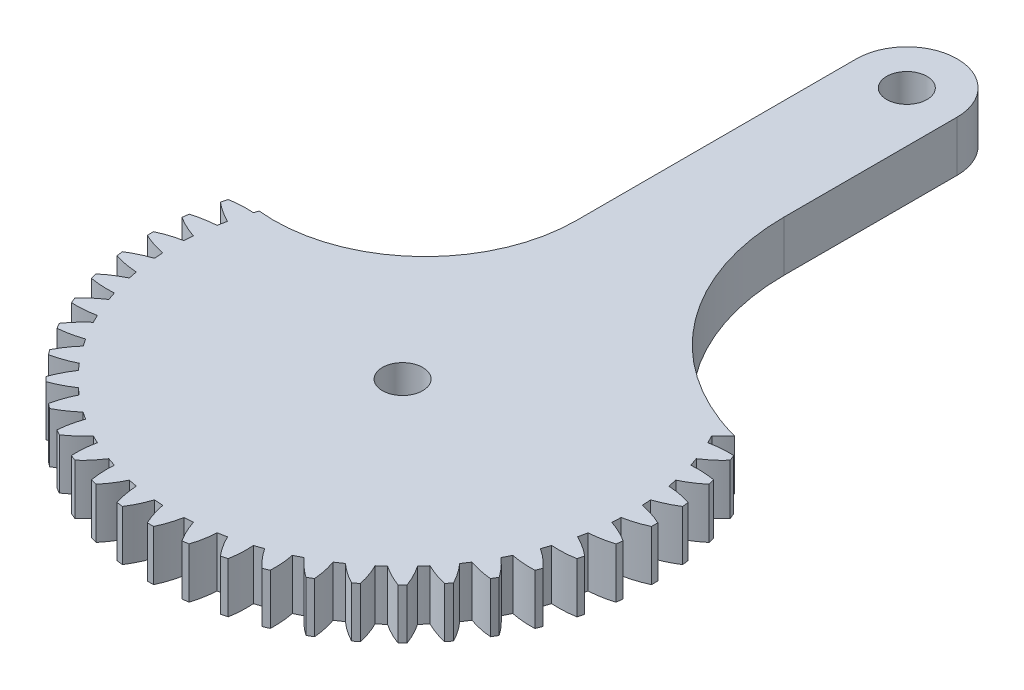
ISO-10303-21;
HEADER;
FILE_DESCRIPTION(('STEP AP214'),'2;1');
FILE_NAME('part.step','',(''),(''),'','','');
FILE_SCHEMA(('AUTOMOTIVE_DESIGN { 1 0 10303 214 1 1 1 1 }'));
ENDSEC;
DATA;
#1=APPLICATION_CONTEXT('core data for automotive mechanical design processes');
#2=APPLICATION_PROTOCOL_DEFINITION('international standard','automotive_design',2000,#1);
#3=PRODUCT_CONTEXT('',#1,'mechanical');
#4=PRODUCT('Part','Part','',(#3));
#5=PRODUCT_RELATED_PRODUCT_CATEGORY('part','',(#4));
#6=PRODUCT_DEFINITION_FORMATION('','',#4);
#7=PRODUCT_DEFINITION_CONTEXT('part definition',#1,'design');
#8=PRODUCT_DEFINITION('design','',#6,#7);
#9=PRODUCT_DEFINITION_SHAPE('','',#8);
#10=(LENGTH_UNIT() NAMED_UNIT(*) SI_UNIT(.MILLI.,.METRE.));
#11=(NAMED_UNIT(*) PLANE_ANGLE_UNIT() SI_UNIT($,.RADIAN.));
#12=(NAMED_UNIT(*) SI_UNIT($,.STERADIAN.) SOLID_ANGLE_UNIT());
#13=UNCERTAINTY_MEASURE_WITH_UNIT(LENGTH_MEASURE(1.E-05),#10,'distance_accuracy_value','');
#14=(GEOMETRIC_REPRESENTATION_CONTEXT(3) GLOBAL_UNCERTAINTY_ASSIGNED_CONTEXT((#13)) GLOBAL_UNIT_ASSIGNED_CONTEXT((#10,
#11,#12)) REPRESENTATION_CONTEXT('',''));
#15=CARTESIAN_POINT('',(0.,0.,0.));
#16=DIRECTION('',(0.,0.,1.));
#17=DIRECTION('',(1.,0.,0.));
#18=AXIS2_PLACEMENT_3D('',#15,#16,#17);
#19=CARTESIAN_POINT('',(0.,0.,25.));
#20=DIRECTION('',(0.,-1.,0.));
#21=DIRECTION('',(0.,0.,-1.));
#22=AXIS2_PLACEMENT_3D('',#19,#20,#21);
#23=PLANE('',#22);
#24=CARTESIAN_POINT('',(0.,0.,-25.));
#25=DIRECTION('',(0.,1.,0.));
#26=DIRECTION('',(0.,0.,1.));
#27=AXIS2_PLACEMENT_3D('',#24,#25,#26);
#28=CIRCLE('',#27,2.);
#29=CARTESIAN_POINT('',(0.,0.,-23.));
#30=VERTEX_POINT('',#29);
#31=EDGE_CURVE('E1617',#30,#30,#28,.T.);
#32=ORIENTED_EDGE('',*,*,#31,.T.);
#33=EDGE_LOOP('',(#32));
#34=FACE_BOUND('',#33,.T.);
#35=CARTESIAN_POINT('',(0.,0.,25.));
#36=DIRECTION('',(0.,1.,0.));
#37=DIRECTION('',(0.,0.,1.));
#38=AXIS2_PLACEMENT_3D('',#35,#36,#37);
#39=CIRCLE('',#38,2.);
#40=CARTESIAN_POINT('',(0.,0.,27.));
#41=VERTEX_POINT('',#40);
#42=EDGE_CURVE('E1619',#41,#41,#39,.T.);
#43=ORIENTED_EDGE('',*,*,#42,.T.);
#44=EDGE_LOOP('',(#43));
#45=FACE_BOUND('',#44,.T.);
#46=CARTESIAN_POINT('',(22.3913168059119,0.,22.3213328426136));
#47=DIRECTION('',(0.,-1.,0.));
#48=DIRECTION('',(0.,0.,-1.));
#49=AXIS2_PLACEMENT_3D('',#46,#47,#48);
#50=CIRCLE('',#49,9.59999999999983);
#51=CARTESIAN_POINT('',(21.6789714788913,0.,31.8948674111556));
#52=VERTEX_POINT('',#51);
#53=CARTESIAN_POINT('',(24.0646609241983,0.,31.7743704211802));
#54=VERTEX_POINT('',#53);
#55=EDGE_CURVE('E11',#52,#54,#50,.F.);
#56=ORIENTED_EDGE('',*,*,#55,.F.);
#57=CARTESIAN_POINT('',(0.,0.,25.));
#58=DIRECTION('',(0.,-1.,0.));
#59=DIRECTION('',(0.,0.,-1.));
#60=AXIS2_PLACEMENT_3D('',#57,#58,#59);
#61=CIRCLE('',#60,22.749);
#62=CARTESIAN_POINT('',(21.3964137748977,0.,32.7272555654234));
#63=VERTEX_POINT('',#62);
#64=EDGE_CURVE('E53',#63,#52,#61,.F.);
#65=ORIENTED_EDGE('',*,*,#64,.F.);
#66=CARTESIAN_POINT('',(16.1335567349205,0.,40.7560995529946));
#67=DIRECTION('',(0.,-1.,0.));
#68=DIRECTION('',(0.,0.,-1.));
#69=AXIS2_PLACEMENT_3D('',#66,#67,#68);
#70=CIRCLE('',#69,9.59999999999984);
#71=CARTESIAN_POINT('',(23.2157545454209,0.,34.2751679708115));
#72=VERTEX_POINT('',#71);
#73=EDGE_CURVE('E1954',#72,#63,#70,.F.);
#74=ORIENTED_EDGE('',*,*,#73,.F.);
#75=CARTESIAN_POINT('',(0.,0.,25.));
#76=DIRECTION('',(0.,1.,0.));
#77=DIRECTION('',(0.,0.,1.));
#78=AXIS2_PLACEMENT_3D('',#75,#76,#77);
#79=CIRCLE('',#78,25.);
#80=CARTESIAN_POINT('',(22.9745516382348,0.,34.8574833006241));
#81=VERTEX_POINT('',#80);
#82=EDGE_CURVE('E1978',#81,#72,#79,.T.);
#83=ORIENTED_EDGE('',*,*,#82,.F.);
#84=CARTESIAN_POINT('',(22.549392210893,0.,25.266902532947));
#85=DIRECTION('',(0.,-1.,0.));
#86=DIRECTION('',(0.,0.,-1.));
#87=AXIS2_PLACEMENT_3D('',#84,#85,#86);
#88=CIRCLE('',#87,9.59999999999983);
#89=CARTESIAN_POINT('',(20.593544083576,0.,34.6655544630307));
#90=VERTEX_POINT('',#89);
#91=EDGE_CURVE('E1955',#90,#81,#88,.F.);
#92=ORIENTED_EDGE('',*,*,#91,.F.);
#93=CARTESIAN_POINT('',(0.,0.,25.));
#94=DIRECTION('',(0.,-1.,0.));
#95=DIRECTION('',(0.,0.,-1.));
#96=AXIS2_PLACEMENT_3D('',#93,#94,#95);
#97=CIRCLE('',#96,22.749);
#98=CARTESIAN_POINT('',(20.2047552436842,0.,35.4539402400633));
#99=VERTEX_POINT('',#98);
#100=EDGE_CURVE('E1948',#99,#90,#97,.F.);
#101=ORIENTED_EDGE('',*,*,#100,.F.);
#102=CARTESIAN_POINT('',(13.9389482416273,0.,42.727155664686));
#103=DIRECTION('',(0.,-1.,0.));
#104=DIRECTION('',(0.,0.,-1.));
#105=AXIS2_PLACEMENT_3D('',#102,#103,#104);
#106=CIRCLE('',#105,9.59999999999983);
#107=CARTESIAN_POINT('',(21.8064881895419,0.,37.2260816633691));
#108=VERTEX_POINT('',#107);
#109=EDGE_CURVE('E1949',#108,#99,#106,.F.);
#110=ORIENTED_EDGE('',*,*,#109,.F.);
#111=CARTESIAN_POINT('',(21.4913414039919,0.,37.7719319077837));
#112=VERTEX_POINT('',#111);
#113=EDGE_CURVE('E1981',#112,#108,#79,.T.);
#114=ORIENTED_EDGE('',*,*,#113,.F.);
#115=CARTESIAN_POINT('',(22.321641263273,0.,28.2079054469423));
#116=DIRECTION('',(0.,-1.,0.));
#117=DIRECTION('',(0.,0.,-1.));
#118=AXIS2_PLACEMENT_3D('',#115,#116,#117);
#119=CIRCLE('',#118,9.59999999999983);
#120=CARTESIAN_POINT('',(19.1557554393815,0.,37.2708611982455));
#121=VERTEX_POINT('',#120);
#122=EDGE_CURVE('E1931',#121,#112,#119,.F.);
#123=ORIENTED_EDGE('',*,*,#122,.F.);
#124=CARTESIAN_POINT('',(0.,0.,25.));
#125=DIRECTION('',(0.,-1.,0.));
#126=DIRECTION('',(0.,0.,-1.));
#127=AXIS2_PLACEMENT_3D('',#124,#125,#126);
#128=CIRCLE('',#127,22.749);
#129=CARTESIAN_POINT('',(18.6673877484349,0.,38.0017550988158));
#130=VERTEX_POINT('',#129);
#131=EDGE_CURVE('E1932',#130,#121,#128,.F.);
#132=ORIENTED_EDGE('',*,*,#131,.F.);
#133=CARTESIAN_POINT('',(11.5058404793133,0.,44.3948952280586));
#134=DIRECTION('',(0.,-1.,0.));
#135=DIRECTION('',(0.,0.,-1.));
#136=AXIS2_PLACEMENT_3D('',#133,#134,#135);
#137=CIRCLE('',#136,9.59999999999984);
#138=CARTESIAN_POINT('',(20.024106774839,0.,39.9678037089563));
#139=VERTEX_POINT('',#138);
#140=EDGE_CURVE('E1927',#139,#130,#137,.F.);
#141=ORIENTED_EDGE('',*,*,#140,.F.);
#142=CARTESIAN_POINT('',(19.6404083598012,0.,40.4678492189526));
#143=VERTEX_POINT('',#142);
#144=EDGE_CURVE('E2274',#143,#139,#79,.T.);
#145=ORIENTED_EDGE('',*,*,#144,.F.);
#146=CARTESIAN_POINT('',(21.7119608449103,0.,31.094020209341));
#147=DIRECTION('',(0.,-1.,0.));
#148=DIRECTION('',(0.,0.,-1.));
#149=AXIS2_PLACEMENT_3D('',#146,#147,#148);
#150=CIRCLE('',#149,9.59999999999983);
#151=CARTESIAN_POINT('',(17.3902065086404,0.,39.6662100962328));
#152=VERTEX_POINT('',#151);
#153=EDGE_CURVE('E1944',#152,#143,#150,.F.);
#154=ORIENTED_EDGE('',*,*,#153,.F.);
#155=CARTESIAN_POINT('',(0.,0.,25.));
#156=DIRECTION('',(0.,-1.,0.));
#157=DIRECTION('',(0.,0.,-1.));
#158=AXIS2_PLACEMENT_3D('',#155,#156,#157);
#159=CIRCLE('',#158,22.749);
#160=CARTESIAN_POINT('',(16.8106160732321,0.,40.3271063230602));
#161=VERTEX_POINT('',#160);
#162=EDGE_CURVE('E1938',#161,#152,#159,.F.);
#163=ORIENTED_EDGE('',*,*,#162,.F.);
#164=CARTESIAN_POINT('',(8.87586459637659,0.,45.7307827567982));
#165=DIRECTION('',(0.,-1.,0.));
#166=DIRECTION('',(0.,0.,-1.));
#167=AXIS2_PLACEMENT_3D('',#164,#165,#166);
#168=CIRCLE('',#167,9.59999999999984);
#169=CARTESIAN_POINT('',(17.8991073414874,0.,42.4534224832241));
#170=VERTEX_POINT('',#169);
#171=EDGE_CURVE('E1940',#170,#161,#168,.F.);
#172=ORIENTED_EDGE('',*,*,#171,.F.);
#173=CARTESIAN_POINT('',(17.4534224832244,0.,42.8991073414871));
#174=VERTEX_POINT('',#173);
#175=EDGE_CURVE('E2267',#174,#170,#79,.T.);
#176=ORIENTED_EDGE('',*,*,#175,.F.);
#177=CARTESIAN_POINT('',(20.7307827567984,0.,33.8758645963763));
#178=DIRECTION('',(0.,-1.,0.));
#179=DIRECTION('',(0.,0.,-1.));
#180=AXIS2_PLACEMENT_3D('',#177,#178,#179);
#181=CIRCLE('',#180,9.59999999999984);
#182=CARTESIAN_POINT('',(15.3271063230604,0.,41.8106160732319));
#183=VERTEX_POINT('',#182);
#184=EDGE_CURVE('E1916',#183,#174,#181,.F.);
#185=ORIENTED_EDGE('',*,*,#184,.F.);
#186=CARTESIAN_POINT('',(0.,0.,25.));
#187=DIRECTION('',(0.,-1.,0.));
#188=DIRECTION('',(0.,0.,-1.));
#189=AXIS2_PLACEMENT_3D('',#186,#187,#188);
#190=CIRCLE('',#189,22.749);
#191=CARTESIAN_POINT('',(14.666210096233,0.,42.3902065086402));
#192=VERTEX_POINT('',#191);
#193=EDGE_CURVE('E1911',#192,#183,#190,.F.);
#194=ORIENTED_EDGE('',*,*,#193,.F.);
#195=CARTESIAN_POINT('',(6.09402020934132,0.,46.7119608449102));
#196=DIRECTION('',(0.,-1.,0.));
#197=DIRECTION('',(0.,0.,-1.));
#198=AXIS2_PLACEMENT_3D('',#195,#196,#197);
#199=CIRCLE('',#198,9.59999999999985);
#200=CARTESIAN_POINT('',(15.4678492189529,0.,44.640408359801));
#201=VERTEX_POINT('',#200);
#202=EDGE_CURVE('E1909',#201,#192,#199,.F.);
#203=ORIENTED_EDGE('',*,*,#202,.F.);
#204=CARTESIAN_POINT('',(14.9678037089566,0.,45.0241067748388));
#205=VERTEX_POINT('',#204);
#206=EDGE_CURVE('E2264',#205,#201,#79,.T.);
#207=ORIENTED_EDGE('',*,*,#206,.F.);
#208=CARTESIAN_POINT('',(19.3948952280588,0.,36.505840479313));
#209=DIRECTION('',(0.,-1.,0.));
#210=DIRECTION('',(0.,0.,-1.));
#211=AXIS2_PLACEMENT_3D('',#208,#209,#210);
#212=CIRCLE('',#211,9.59999999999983);
#213=CARTESIAN_POINT('',(13.0017550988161,0.,43.6673877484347));
#214=VERTEX_POINT('',#213);
#215=EDGE_CURVE('E1924',#214,#205,#212,.F.);
#216=ORIENTED_EDGE('',*,*,#215,.F.);
#217=CARTESIAN_POINT('',(0.,0.,25.));
#218=DIRECTION('',(0.,-1.,0.));
#219=DIRECTION('',(0.,0.,-1.));
#220=AXIS2_PLACEMENT_3D('',#217,#218,#219);
#221=CIRCLE('',#220,22.749);
#222=CARTESIAN_POINT('',(12.2708611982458,0.,44.1557554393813));
#223=VERTEX_POINT('',#222);
#224=EDGE_CURVE('E1925',#223,#214,#221,.F.);
#225=ORIENTED_EDGE('',*,*,#224,.F.);
#226=CARTESIAN_POINT('',(3.20790544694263,0.,47.321641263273));
#227=DIRECTION('',(0.,-1.,0.));
#228=DIRECTION('',(0.,0.,-1.));
#229=AXIS2_PLACEMENT_3D('',#226,#227,#228);
#230=CIRCLE('',#229,9.59999999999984);
#231=CARTESIAN_POINT('',(12.771931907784,0.,46.4913414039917));
#232=VERTEX_POINT('',#231);
#233=EDGE_CURVE('E1917',#232,#223,#230,.F.);
#234=ORIENTED_EDGE('',*,*,#233,.F.);
#235=CARTESIAN_POINT('',(12.2260816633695,0.,46.8064881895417));
#236=VERTEX_POINT('',#235);
#237=EDGE_CURVE('E2259',#236,#232,#79,.T.);
#238=ORIENTED_EDGE('',*,*,#237,.F.);
#239=CARTESIAN_POINT('',(17.7271556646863,0.,38.938948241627));
#240=DIRECTION('',(0.,-1.,0.));
#241=DIRECTION('',(0.,0.,-1.));
#242=AXIS2_PLACEMENT_3D('',#239,#240,#241);
#243=CIRCLE('',#242,9.59999999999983);
#244=CARTESIAN_POINT('',(10.4539402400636,0.,45.2047552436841));
#245=VERTEX_POINT('',#244);
#246=EDGE_CURVE('E1907',#245,#236,#243,.F.);
#247=ORIENTED_EDGE('',*,*,#246,.F.);
#248=CARTESIAN_POINT('',(0.,0.,25.));
#249=DIRECTION('',(0.,-1.,0.));
#250=DIRECTION('',(0.,0.,-1.));
#251=AXIS2_PLACEMENT_3D('',#248,#249,#250);
#252=CIRCLE('',#251,22.749);
#253=CARTESIAN_POINT('',(9.66555446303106,0.,45.5935440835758));
#254=VERTEX_POINT('',#253);
#255=EDGE_CURVE('E1902',#254,#245,#252,.F.);
#256=ORIENTED_EDGE('',*,*,#255,.F.);
#257=CARTESIAN_POINT('',(0.266902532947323,0.,47.549392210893));
#258=DIRECTION('',(0.,-1.,0.));
#259=DIRECTION('',(0.,0.,-1.));
#260=AXIS2_PLACEMENT_3D('',#257,#258,#259);
#261=CIRCLE('',#260,9.59999999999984);
#262=CARTESIAN_POINT('',(9.85748330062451,0.,47.9745516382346));
#263=VERTEX_POINT('',#262);
#264=EDGE_CURVE('E1901',#263,#254,#261,.F.);
#265=ORIENTED_EDGE('',*,*,#264,.F.);
#266=CARTESIAN_POINT('',(9.27516797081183,0.,48.2157545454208));
#267=VERTEX_POINT('',#266);
#268=EDGE_CURVE('E2254',#267,#263,#79,.T.);
#269=ORIENTED_EDGE('',*,*,#268,.F.);
#270=CARTESIAN_POINT('',(15.7560995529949,0.,41.1335567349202));
#271=DIRECTION('',(0.,-1.,0.));
#272=DIRECTION('',(0.,0.,-1.));
#273=AXIS2_PLACEMENT_3D('',#270,#271,#272);
#274=CIRCLE('',#273,9.59999999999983);
#275=CARTESIAN_POINT('',(7.72725556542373,0.,46.3964137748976));
#276=VERTEX_POINT('',#275);
#277=EDGE_CURVE('E1900',#276,#267,#274,.F.);
#278=ORIENTED_EDGE('',*,*,#277,.F.);
#279=CARTESIAN_POINT('',(0.,0.,25.));
#280=DIRECTION('',(0.,-1.,0.));
#281=DIRECTION('',(0.,0.,-1.));
#282=AXIS2_PLACEMENT_3D('',#279,#280,#281);
#283=CIRCLE('',#282,22.749);
#284=CARTESIAN_POINT('',(6.89486741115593,0.,46.6789714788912));
#285=VERTEX_POINT('',#284);
#286=EDGE_CURVE('E1895',#285,#276,#283,.F.);
#287=ORIENTED_EDGE('',*,*,#286,.F.);
#288=CARTESIAN_POINT('',(-2.67866715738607,0.,47.391316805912));
#289=DIRECTION('',(0.,-1.,0.));
#290=DIRECTION('',(0.,0.,-1.));
#291=AXIS2_PLACEMENT_3D('',#288,#289,#290);
#292=CIRCLE('',#291,9.59999999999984);
#293=CARTESIAN_POINT('',(6.77437042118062,0.,49.0646609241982));
#294=VERTEX_POINT('',#293);
#295=EDGE_CURVE('E1892',#294,#285,#292,.F.);
#296=ORIENTED_EDGE('',*,*,#295,.F.);
#297=CARTESIAN_POINT('',(6.16555358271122,0.,49.2277929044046));
#298=VERTEX_POINT('',#297);
#299=EDGE_CURVE('E2251',#298,#294,#79,.T.);
#300=ORIENTED_EDGE('',*,*,#299,.F.);
#301=CARTESIAN_POINT('',(13.5154522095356,0.,43.052115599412));
#302=DIRECTION('',(0.,-1.,0.));
#303=DIRECTION('',(0.,0.,-1.));
#304=AXIS2_PLACEMENT_3D('',#301,#302,#303);
#305=CIRCLE('',#304,9.59999999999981);
#306=CARTESIAN_POINT('',(4.86835540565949,0.,47.221973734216));
#307=VERTEX_POINT('',#306);
#308=EDGE_CURVE('E1706',#307,#298,#305,.F.);
#309=ORIENTED_EDGE('',*,*,#308,.F.);
#310=CARTESIAN_POINT('',(0.,0.,25.));
#311=DIRECTION('',(0.,-1.,0.));
#312=DIRECTION('',(0.,0.,-1.));
#313=AXIS2_PLACEMENT_3D('',#310,#311,#312);
#314=CIRCLE('',#313,22.749);
#315=CARTESIAN_POINT('',(4.00620726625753,0.,47.3934656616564));
#316=VERTEX_POINT('',#315);
#317=EDGE_CURVE('E847',#316,#307,#314,.F.);
#318=ORIENTED_EDGE('',*,*,#317,.F.);
#319=CARTESIAN_POINT('',(-5.57840410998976,0.,46.8501197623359));
#320=DIRECTION('',(0.,-1.,0.));
#321=DIRECTION('',(0.,0.,-1.));
#322=AXIS2_PLACEMENT_3D('',#319,#320,#321);
#323=CIRCLE('',#322,9.59999999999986);
#324=CARTESIAN_POINT('',(3.57534618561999,0.,49.7430171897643));
#325=VERTEX_POINT('',#324);
#326=EDGE_CURVE('E1703',#325,#316,#323,.F.);
#327=ORIENTED_EDGE('',*,*,#326,.F.);
#328=CARTESIAN_POINT('',(2.95044486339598,0.,49.8252870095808));
#329=VERTEX_POINT('',#328);
#330=EDGE_CURVE('E2246',#329,#325,#79,.T.);
#331=ORIENTED_EDGE('',*,*,#330,.F.);
#332=CARTESIAN_POINT('',(11.04355173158,0.,44.6617977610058));
#333=DIRECTION('',(0.,-1.,0.));
#334=DIRECTION('',(0.,0.,-1.));
#335=AXIS2_PLACEMENT_3D('',#332,#333,#334);
#336=CIRCLE('',#335,9.59999999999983);
#337=CARTESIAN_POINT('',(1.92615633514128,0.,47.6673095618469));
#338=VERTEX_POINT('',#337);
#339=EDGE_CURVE('E1701',#338,#329,#336,.F.);
#340=ORIENTED_EDGE('',*,*,#339,.F.);
#341=CARTESIAN_POINT('',(0.,0.,25.));
#342=DIRECTION('',(0.,-1.,0.));
#343=DIRECTION('',(0.,0.,-1.));
#344=AXIS2_PLACEMENT_3D('',#341,#342,#343);
#345=CIRCLE('',#344,22.749);
#346=CARTESIAN_POINT('',(1.04899980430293,0.,47.724801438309));
#347=VERTEX_POINT('',#346);
#348=EDGE_CURVE('E1698',#347,#338,#345,.F.);
#349=ORIENTED_EDGE('',*,*,#348,.F.);
#350=CARTESIAN_POINT('',(-8.3826930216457,0.,45.9350611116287));
#351=DIRECTION('',(0.,-1.,0.));
#352=DIRECTION('',(0.,0.,-1.));
#353=AXIS2_PLACEMENT_3D('',#350,#351,#352);
#354=CIRCLE('',#353,9.59999999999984);
#355=CARTESIAN_POINT('',(0.315146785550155,0.,49.9980135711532));
#356=VERTEX_POINT('',#355);
#357=EDGE_CURVE('E1131',#356,#347,#354,.F.);
#358=ORIENTED_EDGE('',*,*,#357,.F.);
#359=CARTESIAN_POINT('',(-0.315146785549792,0.,49.9980135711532));
#360=VERTEX_POINT('',#359);
#361=EDGE_CURVE('E2244',#360,#356,#79,.T.);
#362=ORIENTED_EDGE('',*,*,#361,.F.);
#363=CARTESIAN_POINT('',(8.382693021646,0.,45.9350611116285));
#364=DIRECTION('',(0.,-1.,0.));
#365=DIRECTION('',(0.,0.,-1.));
#366=AXIS2_PLACEMENT_3D('',#363,#364,#365);
#367=CIRCLE('',#366,9.59999999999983);
#368=CARTESIAN_POINT('',(-1.04899980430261,0.,47.7248014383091));
#369=VERTEX_POINT('',#368);
#370=EDGE_CURVE('E1719',#369,#360,#367,.F.);
#371=ORIENTED_EDGE('',*,*,#370,.F.);
#372=CARTESIAN_POINT('',(0.,0.,25.));
#373=DIRECTION('',(0.,-1.,0.));
#374=DIRECTION('',(0.,0.,-1.));
#375=AXIS2_PLACEMENT_3D('',#372,#373,#374);
#376=CIRCLE('',#375,22.749);
#377=CARTESIAN_POINT('',(-1.92615633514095,0.,47.6673095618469));
#378=VERTEX_POINT('',#377);
#379=EDGE_CURVE('E1713',#378,#369,#376,.F.);
#380=ORIENTED_EDGE('',*,*,#379,.F.);
#381=CARTESIAN_POINT('',(-11.0435517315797,0.,44.6617977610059));
#382=DIRECTION('',(0.,-1.,0.));
#383=DIRECTION('',(0.,0.,-1.));
#384=AXIS2_PLACEMENT_3D('',#381,#382,#383);
#385=CIRCLE('',#384,9.59999999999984);
#386=CARTESIAN_POINT('',(-2.95044486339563,0.,49.8252870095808));
#387=VERTEX_POINT('',#386);
#388=EDGE_CURVE('E1715',#387,#378,#385,.F.);
#389=ORIENTED_EDGE('',*,*,#388,.F.);
#390=CARTESIAN_POINT('',(-3.57534618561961,0.,49.7430171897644));
#391=VERTEX_POINT('',#390);
#392=EDGE_CURVE('E2236',#391,#387,#79,.T.);
#393=ORIENTED_EDGE('',*,*,#392,.F.);
#394=CARTESIAN_POINT('',(5.57840410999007,0.,46.8501197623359));
#395=DIRECTION('',(0.,-1.,0.));
#396=DIRECTION('',(0.,0.,-1.));
#397=AXIS2_PLACEMENT_3D('',#394,#395,#396);
#398=CIRCLE('',#397,9.59999999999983);
#399=CARTESIAN_POINT('',(-4.00620726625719,0.,47.3934656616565));
#400=VERTEX_POINT('',#399);
#401=EDGE_CURVE('E1730',#400,#391,#398,.F.);
#402=ORIENTED_EDGE('',*,*,#401,.F.);
#403=CARTESIAN_POINT('',(0.,0.,25.));
#404=DIRECTION('',(0.,-1.,0.));
#405=DIRECTION('',(0.,0.,-1.));
#406=AXIS2_PLACEMENT_3D('',#403,#404,#405);
#407=CIRCLE('',#406,22.749);
#408=CARTESIAN_POINT('',(-4.86835540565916,0.,47.2219737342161));
#409=VERTEX_POINT('',#408);
#410=EDGE_CURVE('E1723',#409,#400,#407,.F.);
#411=ORIENTED_EDGE('',*,*,#410,.F.);
#412=CARTESIAN_POINT('',(-13.5154522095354,0.,43.0521155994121));
#413=DIRECTION('',(0.,-1.,0.));
#414=DIRECTION('',(0.,0.,-1.));
#415=AXIS2_PLACEMENT_3D('',#412,#413,#414);
#416=CIRCLE('',#415,9.59999999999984);
#417=CARTESIAN_POINT('',(-6.16555358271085,0.,49.2277929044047));
#418=VERTEX_POINT('',#417);
#419=EDGE_CURVE('E1724',#418,#409,#416,.F.);
#420=ORIENTED_EDGE('',*,*,#419,.F.);
#421=CARTESIAN_POINT('',(-6.77437042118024,0.,49.0646609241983));
#422=VERTEX_POINT('',#421);
#423=EDGE_CURVE('E2233',#422,#418,#79,.T.);
#424=ORIENTED_EDGE('',*,*,#423,.F.);
#425=CARTESIAN_POINT('',(2.6786671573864,0.,47.3913168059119));
#426=DIRECTION('',(0.,-1.,0.));
#427=DIRECTION('',(0.,0.,-1.));
#428=AXIS2_PLACEMENT_3D('',#425,#426,#427);
#429=CIRCLE('',#428,9.59999999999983);
#430=CARTESIAN_POINT('',(-6.89486741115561,0.,46.6789714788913));
#431=VERTEX_POINT('',#430);
#432=EDGE_CURVE('E1737',#431,#422,#429,.F.);
#433=ORIENTED_EDGE('',*,*,#432,.F.);
#434=CARTESIAN_POINT('',(0.,0.,25.));
#435=DIRECTION('',(0.,-1.,0.));
#436=DIRECTION('',(0.,0.,-1.));
#437=AXIS2_PLACEMENT_3D('',#434,#435,#436);
#438=CIRCLE('',#437,22.749);
#439=CARTESIAN_POINT('',(-7.7272555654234,0.,46.3964137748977));
#440=VERTEX_POINT('',#439);
#441=EDGE_CURVE('E1731',#440,#431,#438,.F.);
#442=ORIENTED_EDGE('',*,*,#441,.F.);
#443=CARTESIAN_POINT('',(-15.7560995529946,0.,41.1335567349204));
#444=DIRECTION('',(0.,-1.,0.));
#445=DIRECTION('',(0.,0.,-1.));
#446=AXIS2_PLACEMENT_3D('',#443,#444,#445);
#447=CIRCLE('',#446,9.59999999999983);
#448=CARTESIAN_POINT('',(-9.27516797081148,0.,48.2157545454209));
#449=VERTEX_POINT('',#448);
#450=EDGE_CURVE('E1729',#449,#440,#447,.F.);
#451=ORIENTED_EDGE('',*,*,#450,.F.);
#452=CARTESIAN_POINT('',(-9.85748330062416,0.,47.9745516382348));
#453=VERTEX_POINT('',#452);
#454=EDGE_CURVE('E2232',#453,#449,#79,.T.);
#455=ORIENTED_EDGE('',*,*,#454,.F.);
#456=CARTESIAN_POINT('',(-0.266902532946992,0.,47.549392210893));
#457=DIRECTION('',(0.,-1.,0.));
#458=DIRECTION('',(0.,0.,-1.));
#459=AXIS2_PLACEMENT_3D('',#456,#457,#458);
#460=CIRCLE('',#459,9.59999999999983);
#461=CARTESIAN_POINT('',(-9.66555446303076,0.,45.593544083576));
#462=VERTEX_POINT('',#461);
#463=EDGE_CURVE('E1745',#462,#453,#460,.F.);
#464=ORIENTED_EDGE('',*,*,#463,.F.);
#465=CARTESIAN_POINT('',(0.,0.,25.));
#466=DIRECTION('',(0.,-1.,0.));
#467=DIRECTION('',(0.,0.,-1.));
#468=AXIS2_PLACEMENT_3D('',#465,#466,#467);
#469=CIRCLE('',#468,22.749);
#470=CARTESIAN_POINT('',(-10.4539402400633,0.,45.2047552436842));
#471=VERTEX_POINT('',#470);
#472=EDGE_CURVE('E1742',#471,#462,#469,.F.);
#473=ORIENTED_EDGE('',*,*,#472,.F.);
#474=CARTESIAN_POINT('',(-17.727155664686,0.,38.9389482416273));
#475=DIRECTION('',(0.,-1.,0.));
#476=DIRECTION('',(0.,0.,-1.));
#477=AXIS2_PLACEMENT_3D('',#474,#475,#476);
#478=CIRCLE('',#477,9.59999999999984);
#479=CARTESIAN_POINT('',(-12.2260816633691,0.,46.8064881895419));
#480=VERTEX_POINT('',#479);
#481=EDGE_CURVE('E1736',#480,#471,#478,.F.);
#482=ORIENTED_EDGE('',*,*,#481,.F.);
#483=CARTESIAN_POINT('',(-12.7719319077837,0.,46.4913414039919));
#484=VERTEX_POINT('',#483);
#485=EDGE_CURVE('E2230',#484,#480,#79,.T.);
#486=ORIENTED_EDGE('',*,*,#485,.F.);
#487=CARTESIAN_POINT('',(-3.2079054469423,0.,47.321641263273));
#488=DIRECTION('',(0.,-1.,0.));
#489=DIRECTION('',(0.,0.,-1.));
#490=AXIS2_PLACEMENT_3D('',#487,#488,#489);
#491=CIRCLE('',#490,9.59999999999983);
#492=CARTESIAN_POINT('',(-12.2708611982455,0.,44.1557554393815));
#493=VERTEX_POINT('',#492);
#494=EDGE_CURVE('E1775',#493,#484,#491,.F.);
#495=ORIENTED_EDGE('',*,*,#494,.F.);
#496=CARTESIAN_POINT('',(0.,0.,25.));
#497=DIRECTION('',(0.,-1.,0.));
#498=DIRECTION('',(0.,0.,-1.));
#499=AXIS2_PLACEMENT_3D('',#496,#497,#498);
#500=CIRCLE('',#499,22.749);
#501=CARTESIAN_POINT('',(-13.0017550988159,0.,43.6673877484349));
#502=VERTEX_POINT('',#501);
#503=EDGE_CURVE('E1767',#502,#493,#500,.F.);
#504=ORIENTED_EDGE('',*,*,#503,.F.);
#505=CARTESIAN_POINT('',(-19.3948952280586,0.,36.5058404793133));
#506=DIRECTION('',(0.,-1.,0.));
#507=DIRECTION('',(0.,0.,-1.));
#508=AXIS2_PLACEMENT_3D('',#505,#506,#507);
#509=CIRCLE('',#508,9.59999999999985);
#510=CARTESIAN_POINT('',(-14.9678037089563,0.,45.024106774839));
#511=VERTEX_POINT('',#510);
#512=EDGE_CURVE('E1766',#511,#502,#509,.F.);
#513=ORIENTED_EDGE('',*,*,#512,.F.);
#514=CARTESIAN_POINT('',(-15.4678492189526,0.,44.6404083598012));
#515=VERTEX_POINT('',#514);
#516=EDGE_CURVE('E2223',#515,#511,#79,.T.);
#517=ORIENTED_EDGE('',*,*,#516,.F.);
#518=CARTESIAN_POINT('',(-6.09402020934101,0.,46.7119608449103));
#519=DIRECTION('',(0.,-1.,0.));
#520=DIRECTION('',(0.,0.,-1.));
#521=AXIS2_PLACEMENT_3D('',#518,#519,#520);
#522=CIRCLE('',#521,9.59999999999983);
#523=CARTESIAN_POINT('',(-14.6662100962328,0.,42.3902065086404));
#524=VERTEX_POINT('',#523);
#525=EDGE_CURVE('E1782',#524,#515,#522,.F.);
#526=ORIENTED_EDGE('',*,*,#525,.F.);
#527=CARTESIAN_POINT('',(0.,0.,25.));
#528=DIRECTION('',(0.,-1.,0.));
#529=DIRECTION('',(0.,0.,-1.));
#530=AXIS2_PLACEMENT_3D('',#527,#528,#529);
#531=CIRCLE('',#530,22.749);
#532=CARTESIAN_POINT('',(-15.3271063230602,0.,41.8106160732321));
#533=VERTEX_POINT('',#532);
#534=EDGE_CURVE('E1777',#533,#524,#531,.F.);
#535=ORIENTED_EDGE('',*,*,#534,.F.);
#536=CARTESIAN_POINT('',(-20.7307827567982,0.,33.8758645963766));
#537=DIRECTION('',(0.,-1.,0.));
#538=DIRECTION('',(0.,0.,-1.));
#539=AXIS2_PLACEMENT_3D('',#536,#537,#538);
#540=CIRCLE('',#539,9.59999999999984);
#541=CARTESIAN_POINT('',(-17.4534224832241,0.,42.8991073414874));
#542=VERTEX_POINT('',#541);
#543=EDGE_CURVE('E1774',#542,#533,#540,.F.);
#544=ORIENTED_EDGE('',*,*,#543,.F.);
#545=CARTESIAN_POINT('',(-17.8991073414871,0.,42.4534224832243));
#546=VERTEX_POINT('',#545);
#547=EDGE_CURVE('E2217',#546,#542,#79,.T.);
#548=ORIENTED_EDGE('',*,*,#547,.F.);
#549=CARTESIAN_POINT('',(-8.87586459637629,0.,45.7307827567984));
#550=DIRECTION('',(0.,-1.,0.));
#551=DIRECTION('',(0.,0.,-1.));
#552=AXIS2_PLACEMENT_3D('',#549,#550,#551);
#553=CIRCLE('',#552,9.59999999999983);
#554=CARTESIAN_POINT('',(-16.8106160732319,0.,40.3271063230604));
#555=VERTEX_POINT('',#554);
#556=EDGE_CURVE('E1752',#555,#546,#553,.F.);
#557=ORIENTED_EDGE('',*,*,#556,.F.);
#558=CARTESIAN_POINT('',(0.,0.,25.));
#559=DIRECTION('',(0.,-1.,0.));
#560=DIRECTION('',(0.,0.,-1.));
#561=AXIS2_PLACEMENT_3D('',#558,#559,#560);
#562=CIRCLE('',#561,22.749);
#563=CARTESIAN_POINT('',(-17.3902065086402,0.,39.666210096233));
#564=VERTEX_POINT('',#563);
#565=EDGE_CURVE('E1751',#564,#555,#562,.F.);
#566=ORIENTED_EDGE('',*,*,#565,.F.);
#567=CARTESIAN_POINT('',(-21.7119608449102,0.,31.0940202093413));
#568=DIRECTION('',(0.,-1.,0.));
#569=DIRECTION('',(0.,0.,-1.));
#570=AXIS2_PLACEMENT_3D('',#567,#568,#569);
#571=CIRCLE('',#570,9.59999999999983);
#572=CARTESIAN_POINT('',(-19.640408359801,0.,40.4678492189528));
#573=VERTEX_POINT('',#572);
#574=EDGE_CURVE('E1750',#573,#564,#571,.F.);
#575=ORIENTED_EDGE('',*,*,#574,.F.);
#576=CARTESIAN_POINT('',(-20.0241067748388,0.,39.9678037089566));
#577=VERTEX_POINT('',#576);
#578=EDGE_CURVE('E2212',#577,#573,#79,.T.);
#579=ORIENTED_EDGE('',*,*,#578,.F.);
#580=CARTESIAN_POINT('',(-11.505840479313,0.,44.3948952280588));
#581=DIRECTION('',(0.,-1.,0.));
#582=DIRECTION('',(0.,0.,-1.));
#583=AXIS2_PLACEMENT_3D('',#580,#581,#582);
#584=CIRCLE('',#583,9.59999999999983);
#585=CARTESIAN_POINT('',(-18.6673877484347,0.,38.0017550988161));
#586=VERTEX_POINT('',#585);
#587=EDGE_CURVE('E1761',#586,#577,#584,.F.);
#588=ORIENTED_EDGE('',*,*,#587,.F.);
#589=CARTESIAN_POINT('',(0.,0.,25.));
#590=DIRECTION('',(0.,-1.,0.));
#591=DIRECTION('',(0.,0.,-1.));
#592=AXIS2_PLACEMENT_3D('',#589,#590,#591);
#593=CIRCLE('',#592,22.749);
#594=CARTESIAN_POINT('',(-19.1557554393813,0.,37.2708611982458));
#595=VERTEX_POINT('',#594);
#596=EDGE_CURVE('E1759',#595,#586,#593,.F.);
#597=ORIENTED_EDGE('',*,*,#596,.F.);
#598=CARTESIAN_POINT('',(-22.321641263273,0.,28.2079054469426));
#599=DIRECTION('',(0.,-1.,0.));
#600=DIRECTION('',(0.,0.,-1.));
#601=AXIS2_PLACEMENT_3D('',#598,#599,#600);
#602=CIRCLE('',#601,9.59999999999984);
#603=CARTESIAN_POINT('',(-21.4913414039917,0.,37.771931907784));
#604=VERTEX_POINT('',#603);
#605=EDGE_CURVE('E1757',#604,#595,#602,.F.);
#606=ORIENTED_EDGE('',*,*,#605,.F.);
#607=CARTESIAN_POINT('',(-21.8064881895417,0.,37.2260816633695));
#608=VERTEX_POINT('',#607);
#609=EDGE_CURVE('E2213',#608,#604,#79,.T.);
#610=ORIENTED_EDGE('',*,*,#609,.F.);
#611=CARTESIAN_POINT('',(-13.938948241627,0.,42.7271556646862));
#612=DIRECTION('',(0.,-1.,0.));
#613=DIRECTION('',(0.,0.,-1.));
#614=AXIS2_PLACEMENT_3D('',#611,#612,#613);
#615=CIRCLE('',#614,9.59999999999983);
#616=CARTESIAN_POINT('',(-20.2047552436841,0.,35.4539402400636));
#617=VERTEX_POINT('',#616);
#618=EDGE_CURVE('E1788',#617,#608,#615,.F.);
#619=ORIENTED_EDGE('',*,*,#618,.F.);
#620=CARTESIAN_POINT('',(0.,0.,25.));
#621=DIRECTION('',(0.,-1.,0.));
#622=DIRECTION('',(0.,0.,-1.));
#623=AXIS2_PLACEMENT_3D('',#620,#621,#622);
#624=CIRCLE('',#623,22.749);
#625=CARTESIAN_POINT('',(-20.5935440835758,0.,34.6655544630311));
#626=VERTEX_POINT('',#625);
#627=EDGE_CURVE('E1790',#626,#617,#624,.F.);
#628=ORIENTED_EDGE('',*,*,#627,.F.);
#629=CARTESIAN_POINT('',(-22.549392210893,0.,25.2669025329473));
#630=DIRECTION('',(0.,-1.,0.));
#631=DIRECTION('',(0.,0.,-1.));
#632=AXIS2_PLACEMENT_3D('',#629,#630,#631);
#633=CIRCLE('',#632,9.59999999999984);
#634=CARTESIAN_POINT('',(-22.9745516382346,0.,34.8574833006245));
#635=VERTEX_POINT('',#634);
#636=EDGE_CURVE('E1781',#635,#626,#633,.F.);
#637=ORIENTED_EDGE('',*,*,#636,.F.);
#638=CARTESIAN_POINT('',(-23.2157545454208,0.,34.2751679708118));
#639=VERTEX_POINT('',#638);
#640=EDGE_CURVE('E2207',#639,#635,#79,.T.);
#641=ORIENTED_EDGE('',*,*,#640,.F.);
#642=CARTESIAN_POINT('',(-16.1335567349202,0.,40.7560995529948));
#643=DIRECTION('',(0.,-1.,0.));
#644=DIRECTION('',(0.,0.,-1.));
#645=AXIS2_PLACEMENT_3D('',#642,#643,#644);
#646=CIRCLE('',#645,9.59999999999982);
#647=CARTESIAN_POINT('',(-21.3964137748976,0.,32.7272555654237));
#648=VERTEX_POINT('',#647);
#649=EDGE_CURVE('E1798',#648,#639,#646,.F.);
#650=ORIENTED_EDGE('',*,*,#649,.F.);
#651=CARTESIAN_POINT('',(0.,0.,25.));
#652=DIRECTION('',(0.,-1.,0.));
#653=DIRECTION('',(0.,0.,-1.));
#654=AXIS2_PLACEMENT_3D('',#651,#652,#653);
#655=CIRCLE('',#654,22.749);
#656=CARTESIAN_POINT('',(-21.6789714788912,0.,31.8948674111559));
#657=VERTEX_POINT('',#656);
#658=EDGE_CURVE('E1799',#657,#648,#655,.F.);
#659=ORIENTED_EDGE('',*,*,#658,.F.);
#660=CARTESIAN_POINT('',(-22.391316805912,0.,22.3213328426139));
#661=DIRECTION('',(0.,-1.,0.));
#662=DIRECTION('',(0.,0.,-1.));
#663=AXIS2_PLACEMENT_3D('',#660,#661,#662);
#664=CIRCLE('',#663,9.59999999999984);
#665=CARTESIAN_POINT('',(-24.0646609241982,0.,31.7743704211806));
#666=VERTEX_POINT('',#665);
#667=EDGE_CURVE('E1794',#666,#657,#664,.F.);
#668=ORIENTED_EDGE('',*,*,#667,.F.);
#669=CARTESIAN_POINT('',(-24.2277929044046,0.,31.1655535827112));
#670=VERTEX_POINT('',#669);
#671=EDGE_CURVE('E2203',#670,#666,#79,.T.);
#672=ORIENTED_EDGE('',*,*,#671,.F.);
#673=CARTESIAN_POINT('',(-18.052115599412,0.,38.5154522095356));
#674=DIRECTION('',(0.,-1.,0.));
#675=DIRECTION('',(0.,0.,-1.));
#676=AXIS2_PLACEMENT_3D('',#673,#674,#675);
#677=CIRCLE('',#676,9.59999999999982);
#678=CARTESIAN_POINT('',(-22.221973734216,0.,29.8683554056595));
#679=VERTEX_POINT('',#678);
#680=EDGE_CURVE('E1806',#679,#670,#677,.F.);
#681=ORIENTED_EDGE('',*,*,#680,.F.);
#682=CARTESIAN_POINT('',(0.,0.,25.));
#683=DIRECTION('',(0.,-1.,0.));
#684=DIRECTION('',(0.,0.,-1.));
#685=AXIS2_PLACEMENT_3D('',#682,#683,#684);
#686=CIRCLE('',#685,22.749);
#687=CARTESIAN_POINT('',(-22.3934656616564,0.,29.0062072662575));
#688=VERTEX_POINT('',#687);
#689=EDGE_CURVE('E1804',#688,#679,#686,.F.);
#690=ORIENTED_EDGE('',*,*,#689,.F.);
#691=CARTESIAN_POINT('',(-21.8501197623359,0.,19.4215958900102));
#692=DIRECTION('',(0.,-1.,0.));
#693=DIRECTION('',(0.,0.,-1.));
#694=AXIS2_PLACEMENT_3D('',#691,#692,#693);
#695=CIRCLE('',#694,9.59999999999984);
#696=CARTESIAN_POINT('',(-24.7430171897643,0.,28.57534618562));
#697=VERTEX_POINT('',#696);
#698=EDGE_CURVE('E1805',#697,#688,#695,.F.);
#699=ORIENTED_EDGE('',*,*,#698,.F.);
#700=CARTESIAN_POINT('',(-24.8252870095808,0.,27.950444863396));
#701=VERTEX_POINT('',#700);
#702=EDGE_CURVE('E2198',#701,#697,#79,.T.);
#703=ORIENTED_EDGE('',*,*,#702,.F.);
#704=CARTESIAN_POINT('',(-19.6617977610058,0.,36.04355173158));
#705=DIRECTION('',(0.,-1.,0.));
#706=DIRECTION('',(0.,0.,-1.));
#707=AXIS2_PLACEMENT_3D('',#704,#705,#706);
#708=CIRCLE('',#707,9.59999999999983);
#709=CARTESIAN_POINT('',(-22.6673095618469,0.,26.9261563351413));
#710=VERTEX_POINT('',#709);
#711=EDGE_CURVE('E1817',#710,#701,#708,.F.);
#712=ORIENTED_EDGE('',*,*,#711,.F.);
#713=CARTESIAN_POINT('',(0.,0.,25.));
#714=DIRECTION('',(0.,-1.,0.));
#715=DIRECTION('',(0.,0.,-1.));
#716=AXIS2_PLACEMENT_3D('',#713,#714,#715);
#717=CIRCLE('',#716,22.749);
#718=CARTESIAN_POINT('',(-22.724801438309,0.,26.0489998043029));
#719=VERTEX_POINT('',#718);
#720=EDGE_CURVE('E1811',#719,#710,#717,.F.);
#721=ORIENTED_EDGE('',*,*,#720,.F.);
#722=CARTESIAN_POINT('',(-20.9350611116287,0.,16.6173069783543));
#723=DIRECTION('',(0.,-1.,0.));
#724=DIRECTION('',(0.,0.,-1.));
#725=AXIS2_PLACEMENT_3D('',#722,#723,#724);
#726=CIRCLE('',#725,9.59999999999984);
#727=CARTESIAN_POINT('',(-24.9980135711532,0.,25.3151467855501));
#728=VERTEX_POINT('',#727);
#729=EDGE_CURVE('E1812',#728,#719,#726,.F.);
#730=ORIENTED_EDGE('',*,*,#729,.F.);
#731=CARTESIAN_POINT('',(-24.9980135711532,0.,24.6848532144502));
#732=VERTEX_POINT('',#731);
#733=EDGE_CURVE('E2193',#732,#728,#79,.T.);
#734=ORIENTED_EDGE('',*,*,#733,.F.);
#735=CARTESIAN_POINT('',(-20.9350611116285,0.,33.382693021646));
#736=DIRECTION('',(0.,-1.,0.));
#737=DIRECTION('',(0.,0.,-1.));
#738=AXIS2_PLACEMENT_3D('',#735,#736,#737);
#739=CIRCLE('',#738,9.59999999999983);
#740=CARTESIAN_POINT('',(-22.7248014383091,0.,23.9510001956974));
#741=VERTEX_POINT('',#740);
#742=EDGE_CURVE('E1826',#741,#732,#739,.F.);
#743=ORIENTED_EDGE('',*,*,#742,.F.);
#744=CARTESIAN_POINT('',(0.,0.,25.));
#745=DIRECTION('',(0.,-1.,0.));
#746=DIRECTION('',(0.,0.,-1.));
#747=AXIS2_PLACEMENT_3D('',#744,#745,#746);
#748=CIRCLE('',#747,22.749);
#749=CARTESIAN_POINT('',(-22.6673095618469,0.,23.0738436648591));
#750=VERTEX_POINT('',#749);
#751=EDGE_CURVE('E1825',#750,#741,#748,.F.);
#752=ORIENTED_EDGE('',*,*,#751,.F.);
#753=CARTESIAN_POINT('',(-19.6617977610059,0.,13.9564482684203));
#754=DIRECTION('',(0.,-1.,0.));
#755=DIRECTION('',(0.,0.,-1.));
#756=AXIS2_PLACEMENT_3D('',#753,#754,#755);
#757=CIRCLE('',#756,9.59999999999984);
#758=CARTESIAN_POINT('',(-24.8252870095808,0.,22.0495551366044));
#759=VERTEX_POINT('',#758);
#760=EDGE_CURVE('E1820',#759,#750,#757,.F.);
#761=ORIENTED_EDGE('',*,*,#760,.F.);
#762=CARTESIAN_POINT('',(-24.7430171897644,0.,21.4246538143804));
#763=VERTEX_POINT('',#762);
#764=EDGE_CURVE('E2191',#763,#759,#79,.T.);
#765=ORIENTED_EDGE('',*,*,#764,.F.);
#766=CARTESIAN_POINT('',(-21.8501197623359,0.,30.5784041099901));
#767=DIRECTION('',(0.,-1.,0.));
#768=DIRECTION('',(0.,0.,-1.));
#769=AXIS2_PLACEMENT_3D('',#766,#767,#768);
#770=CIRCLE('',#769,9.59999999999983);
#771=CARTESIAN_POINT('',(-22.3934656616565,0.,20.9937927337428));
#772=VERTEX_POINT('',#771);
#773=EDGE_CURVE('E1834',#772,#763,#770,.F.);
#774=ORIENTED_EDGE('',*,*,#773,.F.);
#775=CARTESIAN_POINT('',(0.,0.,25.));
#776=DIRECTION('',(0.,-1.,0.));
#777=DIRECTION('',(0.,0.,-1.));
#778=AXIS2_PLACEMENT_3D('',#775,#776,#777);
#779=CIRCLE('',#778,22.749);
#780=CARTESIAN_POINT('',(-22.2219737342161,0.,20.1316445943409));
#781=VERTEX_POINT('',#780);
#782=EDGE_CURVE('E1832',#781,#772,#779,.F.);
#783=ORIENTED_EDGE('',*,*,#782,.F.);
#784=CARTESIAN_POINT('',(-18.0521155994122,0.,11.4845477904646));
#785=DIRECTION('',(0.,-1.,0.));
#786=DIRECTION('',(0.,0.,-1.));
#787=AXIS2_PLACEMENT_3D('',#784,#785,#786);
#788=CIRCLE('',#787,9.59999999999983);
#789=CARTESIAN_POINT('',(-24.2277929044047,0.,18.8344464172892));
#790=VERTEX_POINT('',#789);
#791=EDGE_CURVE('E1827',#790,#781,#788,.F.);
#792=ORIENTED_EDGE('',*,*,#791,.F.);
#793=CARTESIAN_POINT('',(-24.0646609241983,0.,18.2256295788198));
#794=VERTEX_POINT('',#793);
#795=EDGE_CURVE('E1610',#794,#790,#79,.T.);
#796=ORIENTED_EDGE('',*,*,#795,.F.);
#797=CARTESIAN_POINT('',(-22.3913168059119,0.,27.6786671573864));
#798=DIRECTION('',(0.,-1.,0.));
#799=DIRECTION('',(0.,0.,-1.));
#800=AXIS2_PLACEMENT_3D('',#797,#798,#799);
#801=CIRCLE('',#800,9.59999999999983);
#802=CARTESIAN_POINT('',(-21.6789714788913,0.,18.1051325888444));
#803=VERTEX_POINT('',#802);
#804=EDGE_CURVE('E1836',#803,#794,#801,.F.);
#805=ORIENTED_EDGE('',*,*,#804,.F.);
#806=CARTESIAN_POINT('',(0.,0.,25.));
#807=DIRECTION('',(0.,-1.,0.));
#808=DIRECTION('',(0.,0.,-1.));
#809=AXIS2_PLACEMENT_3D('',#806,#807,#808);
#810=CIRCLE('',#809,22.749);
#811=CARTESIAN_POINT('',(-21.5386679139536,0.,17.6786076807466));
#812=VERTEX_POINT('',#811);
#813=EDGE_CURVE('E1597',#812,#803,#810,.F.);
#814=ORIENTED_EDGE('',*,*,#813,.F.);
#815=CARTESIAN_POINT('',(-20.,0.,2.75773300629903));
#816=DIRECTION('',(0.,-1.,0.));
#817=DIRECTION('',(0.,0.,-1.));
#818=AXIS2_PLACEMENT_3D('',#815,#816,#817);
#819=CIRCLE('',#818,15.);
#820=CARTESIAN_POINT('',(-5.,0.,2.75773300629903));
#821=VERTEX_POINT('',#820);
#822=EDGE_CURVE('E1665',#812,#821,#819,.F.);
#823=ORIENTED_EDGE('',*,*,#822,.T.);
#824=DIRECTION('',(0.,0.,1.));
#825=VECTOR('',#824,1.);
#826=CARTESIAN_POINT('',(-5.,0.,25.));
#827=LINE('',#826,#825);
#828=CARTESIAN_POINT('',(-5.,0.,-25.));
#829=VERTEX_POINT('',#828);
#830=EDGE_CURVE('E1637',#829,#821,#827,.T.);
#831=ORIENTED_EDGE('',*,*,#830,.F.);
#832=CARTESIAN_POINT('',(0.,0.,-25.));
#833=DIRECTION('',(0.,1.,0.));
#834=DIRECTION('',(0.,0.,1.));
#835=AXIS2_PLACEMENT_3D('',#832,#833,#834);
#836=CIRCLE('',#835,5.);
#837=CARTESIAN_POINT('',(5.,0.,-25.));
#838=VERTEX_POINT('',#837);
#839=EDGE_CURVE('E1649',#838,#829,#836,.T.);
#840=ORIENTED_EDGE('',*,*,#839,.F.);
#841=DIRECTION('',(0.,0.,-1.));
#842=VECTOR('',#841,1.);
#843=CARTESIAN_POINT('',(5.,0.,25.));
#844=LINE('',#843,#842);
#845=CARTESIAN_POINT('',(5.,0.,-7.83640756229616));
#846=VERTEX_POINT('',#845);
#847=EDGE_CURVE('E1627',#846,#838,#844,.T.);
#848=ORIENTED_EDGE('',*,*,#847,.F.);
#849=CARTESIAN_POINT('',(27.,0.,-7.83640756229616));
#850=DIRECTION('',(0.,-1.,0.));
#851=DIRECTION('',(0.,0.,-1.));
#852=AXIS2_PLACEMENT_3D('',#849,#850,#851);
#853=CIRCLE('',#852,22.);
#854=CARTESIAN_POINT('',(19.1459708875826,0.,12.7138777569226));
#855=VERTEX_POINT('',#854);
#856=EDGE_CURVE('E1676',#846,#855,#853,.F.);
#857=ORIENTED_EDGE('',*,*,#856,.T.);
#858=CARTESIAN_POINT('',(0.,0.,25.));
#859=DIRECTION('',(0.,-1.,0.));
#860=DIRECTION('',(0.,0.,-1.));
#861=AXIS2_PLACEMENT_3D('',#858,#859,#860);
#862=CIRCLE('',#861,22.749);
#863=CARTESIAN_POINT('',(19.1557554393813,0.,12.7291388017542));
#864=VERTEX_POINT('',#863);
#865=EDGE_CURVE('E1593',#864,#855,#862,.F.);
#866=ORIENTED_EDGE('',*,*,#865,.F.);
#867=CARTESIAN_POINT('',(22.321641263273,0.,21.7920945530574));
#868=DIRECTION('',(0.,-1.,0.));
#869=DIRECTION('',(0.,0.,-1.));
#870=AXIS2_PLACEMENT_3D('',#867,#868,#869);
#871=CIRCLE('',#870,9.59999999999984);
#872=CARTESIAN_POINT('',(19.1715518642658,0.,12.7236362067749));
#873=VERTEX_POINT('',#872);
#874=EDGE_CURVE('E1582',#873,#864,#871,.F.);
#875=ORIENTED_EDGE('',*,*,#874,.F.);
#876=CARTESIAN_POINT('',(21.3156036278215,0.,13.4165366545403));
#877=VERTEX_POINT('',#876);
#878=EDGE_CURVE('E1683',#873,#877,#853,.F.);
#879=ORIENTED_EDGE('',*,*,#878,.T.);
#880=CARTESIAN_POINT('',(13.938948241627,0.,7.27284433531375));
#881=DIRECTION('',(0.,-1.,0.));
#882=DIRECTION('',(0.,0.,-1.));
#883=AXIS2_PLACEMENT_3D('',#880,#881,#882);
#884=CIRCLE('',#883,9.59999999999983);
#885=CARTESIAN_POINT('',(20.2047552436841,0.,14.5460597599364));
#886=VERTEX_POINT('',#885);
#887=EDGE_CURVE('E1596',#886,#877,#884,.F.);
#888=ORIENTED_EDGE('',*,*,#887,.F.);
#889=CARTESIAN_POINT('',(0.,0.,25.));
#890=DIRECTION('',(0.,-1.,0.));
#891=DIRECTION('',(0.,0.,-1.));
#892=AXIS2_PLACEMENT_3D('',#889,#890,#891);
#893=CIRCLE('',#892,22.749);
#894=CARTESIAN_POINT('',(20.5935440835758,0.,15.3344455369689));
#895=VERTEX_POINT('',#894);
#896=EDGE_CURVE('E1842',#895,#886,#893,.F.);
#897=ORIENTED_EDGE('',*,*,#896,.F.);
#898=CARTESIAN_POINT('',(22.549392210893,0.,24.7330974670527));
#899=DIRECTION('',(0.,-1.,0.));
#900=DIRECTION('',(0.,0.,-1.));
#901=AXIS2_PLACEMENT_3D('',#898,#899,#900);
#902=CIRCLE('',#901,9.59999999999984);
#903=CARTESIAN_POINT('',(22.9745516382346,0.,15.1425166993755));
#904=VERTEX_POINT('',#903);
#905=EDGE_CURVE('E1841',#904,#895,#902,.F.);
#906=ORIENTED_EDGE('',*,*,#905,.F.);
#907=CARTESIAN_POINT('',(23.2157545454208,0.,15.7248320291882));
#908=VERTEX_POINT('',#907);
#909=EDGE_CURVE('E1603',#908,#904,#79,.T.);
#910=ORIENTED_EDGE('',*,*,#909,.F.);
#911=CARTESIAN_POINT('',(16.1335567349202,0.,9.24390044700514));
#912=DIRECTION('',(0.,-1.,0.));
#913=DIRECTION('',(0.,0.,-1.));
#914=AXIS2_PLACEMENT_3D('',#911,#912,#913);
#915=CIRCLE('',#914,9.59999999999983);
#916=CARTESIAN_POINT('',(21.3964137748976,0.,17.2727444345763));
#917=VERTEX_POINT('',#916);
#918=EDGE_CURVE('E1852',#917,#908,#915,.F.);
#919=ORIENTED_EDGE('',*,*,#918,.F.);
#920=CARTESIAN_POINT('',(0.,0.,25.));
#921=DIRECTION('',(0.,-1.,0.));
#922=DIRECTION('',(0.,0.,-1.));
#923=AXIS2_PLACEMENT_3D('',#920,#921,#922);
#924=CIRCLE('',#923,22.749);
#925=CARTESIAN_POINT('',(21.6789714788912,0.,18.1051325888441));
#926=VERTEX_POINT('',#925);
#927=EDGE_CURVE('E1849',#926,#917,#924,.F.);
#928=ORIENTED_EDGE('',*,*,#927,.F.);
#929=CARTESIAN_POINT('',(22.391316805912,0.,27.6786671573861));
#930=DIRECTION('',(0.,-1.,0.));
#931=DIRECTION('',(0.,0.,-1.));
#932=AXIS2_PLACEMENT_3D('',#929,#930,#931);
#933=CIRCLE('',#932,9.59999999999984);
#934=CARTESIAN_POINT('',(24.0646609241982,0.,18.2256295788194));
#935=VERTEX_POINT('',#934);
#936=EDGE_CURVE('E1850',#935,#926,#933,.F.);
#937=ORIENTED_EDGE('',*,*,#936,.F.);
#938=CARTESIAN_POINT('',(24.2277929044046,0.,18.8344464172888));
#939=VERTEX_POINT('',#938);
#940=EDGE_CURVE('E1614',#939,#935,#79,.T.);
#941=ORIENTED_EDGE('',*,*,#940,.F.);
#942=CARTESIAN_POINT('',(18.052115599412,0.,11.4845477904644));
#943=DIRECTION('',(0.,-1.,0.));
#944=DIRECTION('',(0.,0.,-1.));
#945=AXIS2_PLACEMENT_3D('',#942,#943,#944);
#946=CIRCLE('',#945,9.59999999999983);
#947=CARTESIAN_POINT('',(22.221973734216,0.,20.1316445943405));
#948=VERTEX_POINT('',#947);
#949=EDGE_CURVE('E1865',#948,#939,#946,.F.);
#950=ORIENTED_EDGE('',*,*,#949,.F.);
#951=CARTESIAN_POINT('',(0.,0.,25.));
#952=DIRECTION('',(0.,-1.,0.));
#953=DIRECTION('',(0.,0.,-1.));
#954=AXIS2_PLACEMENT_3D('',#951,#952,#953);
#955=CIRCLE('',#954,22.749);
#956=CARTESIAN_POINT('',(22.3934656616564,0.,20.9937927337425));
#957=VERTEX_POINT('',#956);
#958=EDGE_CURVE('E1856',#957,#948,#955,.F.);
#959=ORIENTED_EDGE('',*,*,#958,.F.);
#960=CARTESIAN_POINT('',(21.8501197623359,0.,30.5784041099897));
#961=DIRECTION('',(0.,-1.,0.));
#962=DIRECTION('',(0.,0.,-1.));
#963=AXIS2_PLACEMENT_3D('',#960,#961,#962);
#964=CIRCLE('',#963,9.59999999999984);
#965=CARTESIAN_POINT('',(24.7430171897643,0.,21.42465381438));
#966=VERTEX_POINT('',#965);
#967=EDGE_CURVE('E1857',#966,#957,#964,.F.);
#968=ORIENTED_EDGE('',*,*,#967,.F.);
#969=CARTESIAN_POINT('',(24.8252870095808,0.,22.049555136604));
#970=VERTEX_POINT('',#969);
#971=EDGE_CURVE('E1991',#970,#966,#79,.T.);
#972=ORIENTED_EDGE('',*,*,#971,.F.);
#973=CARTESIAN_POINT('',(19.6617977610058,0.,13.95644826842));
#974=DIRECTION('',(0.,-1.,0.));
#975=DIRECTION('',(0.,0.,-1.));
#976=AXIS2_PLACEMENT_3D('',#973,#974,#975);
#977=CIRCLE('',#976,9.59999999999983);
#978=CARTESIAN_POINT('',(22.6673095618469,0.,23.0738436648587));
#979=VERTEX_POINT('',#978);
#980=EDGE_CURVE('E1874',#979,#970,#977,.F.);
#981=ORIENTED_EDGE('',*,*,#980,.F.);
#982=CARTESIAN_POINT('',(0.,0.,25.));
#983=DIRECTION('',(0.,-1.,0.));
#984=DIRECTION('',(0.,0.,-1.));
#985=AXIS2_PLACEMENT_3D('',#982,#983,#984);
#986=CIRCLE('',#985,22.749);
#987=CARTESIAN_POINT('',(22.724801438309,0.,23.9510001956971));
#988=VERTEX_POINT('',#987);
#989=EDGE_CURVE('E1869',#988,#979,#986,.F.);
#990=ORIENTED_EDGE('',*,*,#989,.F.);
#991=CARTESIAN_POINT('',(20.9350611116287,0.,33.3826930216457));
#992=DIRECTION('',(0.,-1.,0.));
#993=DIRECTION('',(0.,0.,-1.));
#994=AXIS2_PLACEMENT_3D('',#991,#992,#993);
#995=CIRCLE('',#994,9.59999999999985);
#996=CARTESIAN_POINT('',(24.9980135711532,0.,24.6848532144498));
#997=VERTEX_POINT('',#996);
#998=EDGE_CURVE('E1863',#997,#988,#995,.F.);
#999=ORIENTED_EDGE('',*,*,#998,.F.);
#1000=CARTESIAN_POINT('',(24.9980135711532,0.,25.3151467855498));
#1001=VERTEX_POINT('',#1000);
#1002=EDGE_CURVE('E1984',#1001,#997,#79,.T.);
#1003=ORIENTED_EDGE('',*,*,#1002,.F.);
#1004=CARTESIAN_POINT('',(20.9350611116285,0.,16.617306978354));
#1005=DIRECTION('',(0.,-1.,0.));
#1006=DIRECTION('',(0.,0.,-1.));
#1007=AXIS2_PLACEMENT_3D('',#1004,#1005,#1006);
#1008=CIRCLE('',#1007,9.59999999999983);
#1009=CARTESIAN_POINT('',(22.7248014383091,0.,26.0489998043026));
#1010=VERTEX_POINT('',#1009);
#1011=EDGE_CURVE('E1879',#1010,#1001,#1008,.F.);
#1012=ORIENTED_EDGE('',*,*,#1011,.F.);
#1013=CARTESIAN_POINT('',(0.,0.,25.));
#1014=DIRECTION('',(0.,-1.,0.));
#1015=DIRECTION('',(0.,0.,-1.));
#1016=AXIS2_PLACEMENT_3D('',#1013,#1014,#1015);
#1017=CIRCLE('',#1016,22.749);
#1018=CARTESIAN_POINT('',(22.6673095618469,0.,26.9261563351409));
#1019=VERTEX_POINT('',#1018);
#1020=EDGE_CURVE('E1880',#1019,#1010,#1017,.F.);
#1021=ORIENTED_EDGE('',*,*,#1020,.F.);
#1022=CARTESIAN_POINT('',(19.6617977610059,0.,36.0435517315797));
#1023=DIRECTION('',(0.,-1.,0.));
#1024=DIRECTION('',(0.,0.,-1.));
#1025=AXIS2_PLACEMENT_3D('',#1022,#1023,#1024);
#1026=CIRCLE('',#1025,9.59999999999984);
#1027=CARTESIAN_POINT('',(24.8252870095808,0.,27.9504448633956));
#1028=VERTEX_POINT('',#1027);
#1029=EDGE_CURVE('E1873',#1028,#1019,#1026,.F.);
#1030=ORIENTED_EDGE('',*,*,#1029,.F.);
#1031=CARTESIAN_POINT('',(24.7430171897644,0.,28.5753461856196));
#1032=VERTEX_POINT('',#1031);
#1033=EDGE_CURVE('E1977',#1032,#1028,#79,.T.);
#1034=ORIENTED_EDGE('',*,*,#1033,.F.);
#1035=CARTESIAN_POINT('',(21.8501197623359,0.,19.4215958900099));
#1036=DIRECTION('',(0.,-1.,0.));
#1037=DIRECTION('',(0.,0.,-1.));
#1038=AXIS2_PLACEMENT_3D('',#1035,#1036,#1037);
#1039=CIRCLE('',#1038,9.59999999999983);
#1040=CARTESIAN_POINT('',(22.3934656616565,0.,29.0062072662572));
#1041=VERTEX_POINT('',#1040);
#1042=EDGE_CURVE('E1886',#1041,#1032,#1039,.F.);
#1043=ORIENTED_EDGE('',*,*,#1042,.F.);
#1044=CARTESIAN_POINT('',(0.,0.,25.));
#1045=DIRECTION('',(0.,-1.,0.));
#1046=DIRECTION('',(0.,0.,-1.));
#1047=AXIS2_PLACEMENT_3D('',#1044,#1045,#1046);
#1048=CIRCLE('',#1047,22.749);
#1049=CARTESIAN_POINT('',(22.2219737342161,0.,29.8683554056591));
#1050=VERTEX_POINT('',#1049);
#1051=EDGE_CURVE('E1887',#1050,#1041,#1048,.F.);
#1052=ORIENTED_EDGE('',*,*,#1051,.F.);
#1053=CARTESIAN_POINT('',(18.0521155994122,0.,38.5154522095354));
#1054=DIRECTION('',(0.,-1.,0.));
#1055=DIRECTION('',(0.,0.,-1.));
#1056=AXIS2_PLACEMENT_3D('',#1053,#1054,#1055);
#1057=CIRCLE('',#1056,9.59999999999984);
#1058=CARTESIAN_POINT('',(24.2277929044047,0.,31.1655535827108));
#1059=VERTEX_POINT('',#1058);
#1060=EDGE_CURVE('E1881',#1059,#1050,#1057,.F.);
#1061=ORIENTED_EDGE('',*,*,#1060,.F.);
#1062=EDGE_CURVE('E1973',#54,#1059,#79,.T.);
#1063=ORIENTED_EDGE('',*,*,#1062,.F.);
#1064=EDGE_LOOP('',(#56,#65,#74,#83,#92,#101,#110,#114,#123,#132,#141,#145,#154,#163,#172,#176,
#185,#194,#203,#207,#216,#225,#234,#238,#247,#256,#265,#269,#278,#287,#296,#300,#309,#318,#327,
#331,#340,#349,#358,#362,#371,#380,#389,#393,#402,#411,#420,#424,#433,#442,#451,#455,#464,#473,
#482,#486,#495,#504,#513,#517,#526,#535,#544,#548,#557,#566,#575,#579,#588,#597,#606,#610,#619,
#628,#637,#641,#650,#659,#668,#672,#681,#690,#699,#703,#712,#721,#730,#734,#743,#752,#761,#765,
#774,#783,#792,#796,#805,#814,#823,#831,#840,#848,#857,#866,#875,#879,#888,#897,#906,#910,#919,
#928,#937,#941,#950,#959,#968,#972,#981,#990,#999,#1003,#1012,#1021,#1030,#1034,#1043,#1052,
#1061,#1063));
#1065=FACE_BOUND('',#1064,.T.);
#1066=ADVANCED_FACE('F44',(#34,#45,#1065),#23,.T.);
#1067=CARTESIAN_POINT('',(0.,66.8167067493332,25.));
#1068=DIRECTION('',(0.,-1.,0.));
#1069=DIRECTION('',(0.,0.,-1.));
#1070=AXIS2_PLACEMENT_3D('',#1067,#1068,#1069);
#1071=CYLINDRICAL_SURFACE('',#1070,25.);
#1072=DIRECTION('',(0.,1.,0.));
#1073=VECTOR('',#1072,1.);
#1074=CARTESIAN_POINT('',(24.0646609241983,-5.,31.7743704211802));
#1075=LINE('',#1074,#1073);
#1076=CARTESIAN_POINT('',(24.0646609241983,5.,31.7743704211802));
#1077=VERTEX_POINT('',#1076);
#1078=EDGE_CURVE('E1134',#54,#1077,#1075,.T.);
#1079=ORIENTED_EDGE('',*,*,#1078,.F.);
#1080=ORIENTED_EDGE('',*,*,#1062,.T.);
#1081=DIRECTION('',(0.,1.,0.));
#1082=VECTOR('',#1081,1.);
#1083=CARTESIAN_POINT('',(24.2277929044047,-5.,31.1655535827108));
#1084=LINE('',#1083,#1082);
#1085=CARTESIAN_POINT('',(24.2277929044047,5.,31.1655535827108));
#1086=VERTEX_POINT('',#1085);
#1087=EDGE_CURVE('E1015',#1059,#1086,#1084,.T.);
#1088=ORIENTED_EDGE('',*,*,#1087,.T.);
#1089=CARTESIAN_POINT('',(0.,5.,25.));
#1090=DIRECTION('',(0.,-1.,0.));
#1091=DIRECTION('',(0.,0.,-1.));
#1092=AXIS2_PLACEMENT_3D('',#1089,#1090,#1091);
#1093=CIRCLE('',#1092,25.);
#1094=EDGE_CURVE('E2040',#1086,#1077,#1093,.T.);
#1095=ORIENTED_EDGE('',*,*,#1094,.T.);
#1096=EDGE_LOOP('',(#1079,#1080,#1088,#1095));
#1097=FACE_BOUND('',#1096,.T.);
#1098=ADVANCED_FACE('F2391',(#1097),#1071,.T.);
#1099=ORIENTED_EDGE('',*,*,#82,.T.);
#1100=DIRECTION('',(0.,1.,0.));
#1101=VECTOR('',#1100,1.);
#1102=CARTESIAN_POINT('',(23.2157545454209,-5.,34.2751679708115));
#1103=LINE('',#1102,#1101);
#1104=CARTESIAN_POINT('',(23.2157545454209,5.,34.2751679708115));
#1105=VERTEX_POINT('',#1104);
#1106=EDGE_CURVE('E1127',#72,#1105,#1103,.T.);
#1107=ORIENTED_EDGE('',*,*,#1106,.T.);
#1108=CARTESIAN_POINT('',(22.9745516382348,5.,34.8574833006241));
#1109=VERTEX_POINT('',#1108);
#1110=EDGE_CURVE('E2041',#1105,#1109,#1093,.T.);
#1111=ORIENTED_EDGE('',*,*,#1110,.T.);
#1112=DIRECTION('',(0.,1.,0.));
#1113=VECTOR('',#1112,1.);
#1114=CARTESIAN_POINT('',(22.9745516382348,-5.,34.8574833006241));
#1115=LINE('',#1114,#1113);
#1116=EDGE_CURVE('E1156',#81,#1109,#1115,.T.);
#1117=ORIENTED_EDGE('',*,*,#1116,.F.);
#1118=EDGE_LOOP('',(#1099,#1107,#1111,#1117));
#1119=FACE_BOUND('',#1118,.T.);
#1120=ADVANCED_FACE('F2405',(#1119),#1071,.T.);
#1121=DIRECTION('',(0.,1.,0.));
#1122=VECTOR('',#1121,1.);
#1123=CARTESIAN_POINT('',(19.6404083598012,-5.,40.4678492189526));
#1124=LINE('',#1123,#1122);
#1125=CARTESIAN_POINT('',(19.6404083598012,5.,40.4678492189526));
#1126=VERTEX_POINT('',#1125);
#1127=EDGE_CURVE('E1182',#143,#1126,#1124,.T.);
#1128=ORIENTED_EDGE('',*,*,#1127,.F.);
#1129=ORIENTED_EDGE('',*,*,#144,.T.);
#1130=DIRECTION('',(0.,1.,0.));
#1131=VECTOR('',#1130,1.);
#1132=CARTESIAN_POINT('',(20.024106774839,-5.,39.9678037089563));
#1133=LINE('',#1132,#1131);
#1134=CARTESIAN_POINT('',(20.024106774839,5.,39.9678037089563));
#1135=VERTEX_POINT('',#1134);
#1136=EDGE_CURVE('E1181',#139,#1135,#1133,.T.);
#1137=ORIENTED_EDGE('',*,*,#1136,.T.);
#1138=EDGE_CURVE('E2051',#1135,#1126,#1093,.T.);
#1139=ORIENTED_EDGE('',*,*,#1138,.T.);
#1140=EDGE_LOOP('',(#1128,#1129,#1137,#1139));
#1141=FACE_BOUND('',#1140,.T.);
#1142=ADVANCED_FACE('F2310',(#1141),#1071,.T.);
#1143=ORIENTED_EDGE('',*,*,#113,.T.);
#1144=DIRECTION('',(0.,1.,0.));
#1145=VECTOR('',#1144,1.);
#1146=CARTESIAN_POINT('',(21.8064881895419,-5.,37.2260816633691));
#1147=LINE('',#1146,#1145);
#1148=CARTESIAN_POINT('',(21.8064881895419,5.,37.2260816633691));
#1149=VERTEX_POINT('',#1148);
#1150=EDGE_CURVE('E1140',#108,#1149,#1147,.T.);
#1151=ORIENTED_EDGE('',*,*,#1150,.T.);
#1152=CARTESIAN_POINT('',(21.4913414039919,5.,37.7719319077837));
#1153=VERTEX_POINT('',#1152);
#1154=EDGE_CURVE('E2045',#1149,#1153,#1093,.T.);
#1155=ORIENTED_EDGE('',*,*,#1154,.T.);
#1156=DIRECTION('',(0.,1.,0.));
#1157=VECTOR('',#1156,1.);
#1158=CARTESIAN_POINT('',(21.4913414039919,-5.,37.7719319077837));
#1159=LINE('',#1158,#1157);
#1160=EDGE_CURVE('E1038',#112,#1153,#1159,.T.);
#1161=ORIENTED_EDGE('',*,*,#1160,.F.);
#1162=EDGE_LOOP('',(#1143,#1151,#1155,#1161));
#1163=FACE_BOUND('',#1162,.T.);
#1164=ADVANCED_FACE('F2277',(#1163),#1071,.T.);
#1165=DIRECTION('',(0.,1.,0.));
#1166=VECTOR('',#1165,1.);
#1167=CARTESIAN_POINT('',(14.9678037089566,-5.,45.0241067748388));
#1168=LINE('',#1167,#1166);
#1169=CARTESIAN_POINT('',(14.9678037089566,5.,45.0241067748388));
#1170=VERTEX_POINT('',#1169);
#1171=EDGE_CURVE('E1041',#205,#1170,#1168,.T.);
#1172=ORIENTED_EDGE('',*,*,#1171,.F.);
#1173=ORIENTED_EDGE('',*,*,#206,.T.);
#1174=DIRECTION('',(0.,1.,0.));
#1175=VECTOR('',#1174,1.);
#1176=CARTESIAN_POINT('',(15.4678492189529,-5.,44.640408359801));
#1177=LINE('',#1176,#1175);
#1178=CARTESIAN_POINT('',(15.4678492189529,5.,44.640408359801));
#1179=VERTEX_POINT('',#1178);
#1180=EDGE_CURVE('E1043',#201,#1179,#1177,.T.);
#1181=ORIENTED_EDGE('',*,*,#1180,.T.);
#1182=EDGE_CURVE('E2061',#1179,#1170,#1093,.T.);
#1183=ORIENTED_EDGE('',*,*,#1182,.T.);
#1184=EDGE_LOOP('',(#1172,#1173,#1181,#1183));
#1185=FACE_BOUND('',#1184,.T.);
#1186=ADVANCED_FACE('F2337',(#1185),#1071,.T.);
#1187=ORIENTED_EDGE('',*,*,#175,.T.);
#1188=DIRECTION('',(0.,1.,0.));
#1189=VECTOR('',#1188,1.);
#1190=CARTESIAN_POINT('',(17.8991073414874,-5.,42.4534224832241));
#1191=LINE('',#1190,#1189);
#1192=CARTESIAN_POINT('',(17.8991073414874,5.,42.4534224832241));
#1193=VERTEX_POINT('',#1192);
#1194=EDGE_CURVE('E1163',#170,#1193,#1191,.T.);
#1195=ORIENTED_EDGE('',*,*,#1194,.T.);
#1196=CARTESIAN_POINT('',(17.4534224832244,5.,42.8991073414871));
#1197=VERTEX_POINT('',#1196);
#1198=EDGE_CURVE('E2057',#1193,#1197,#1093,.T.);
#1199=ORIENTED_EDGE('',*,*,#1198,.T.);
#1200=DIRECTION('',(0.,1.,0.));
#1201=VECTOR('',#1200,1.);
#1202=CARTESIAN_POINT('',(17.4534224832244,-5.,42.8991073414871));
#1203=LINE('',#1202,#1201);
#1204=EDGE_CURVE('E1066',#174,#1197,#1203,.T.);
#1205=ORIENTED_EDGE('',*,*,#1204,.F.);
#1206=EDGE_LOOP('',(#1187,#1195,#1199,#1205));
#1207=FACE_BOUND('',#1206,.T.);
#1208=ADVANCED_FACE('F2324',(#1207),#1071,.T.);
#1209=ORIENTED_EDGE('',*,*,#237,.T.);
#1210=DIRECTION('',(0.,1.,0.));
#1211=VECTOR('',#1210,1.);
#1212=CARTESIAN_POINT('',(12.771931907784,-5.,46.4913414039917));
#1213=LINE('',#1212,#1211);
#1214=CARTESIAN_POINT('',(12.771931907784,5.,46.4913414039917));
#1215=VERTEX_POINT('',#1214);
#1216=EDGE_CURVE('E1037',#232,#1215,#1213,.T.);
#1217=ORIENTED_EDGE('',*,*,#1216,.T.);
#1218=CARTESIAN_POINT('',(12.2260816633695,5.,46.8064881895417));
#1219=VERTEX_POINT('',#1218);
#1220=EDGE_CURVE('E2067',#1215,#1219,#1093,.T.);
#1221=ORIENTED_EDGE('',*,*,#1220,.T.);
#1222=DIRECTION('',(0.,1.,0.));
#1223=VECTOR('',#1222,1.);
#1224=CARTESIAN_POINT('',(12.2260816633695,-5.,46.8064881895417));
#1225=LINE('',#1224,#1223);
#1226=EDGE_CURVE('E1091',#236,#1219,#1225,.T.);
#1227=ORIENTED_EDGE('',*,*,#1226,.F.);
#1228=EDGE_LOOP('',(#1209,#1217,#1221,#1227));
#1229=FACE_BOUND('',#1228,.T.);
#1230=ADVANCED_FACE('F2351',(#1229),#1071,.T.);
#1231=ORIENTED_EDGE('',*,*,#268,.T.);
#1232=DIRECTION('',(0.,1.,0.));
#1233=VECTOR('',#1232,1.);
#1234=CARTESIAN_POINT('',(9.85748330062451,-5.,47.9745516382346));
#1235=LINE('',#1234,#1233);
#1236=CARTESIAN_POINT('',(9.85748330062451,5.,47.9745516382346));
#1237=VERTEX_POINT('',#1236);
#1238=EDGE_CURVE('E1068',#263,#1237,#1235,.T.);
#1239=ORIENTED_EDGE('',*,*,#1238,.T.);
#1240=CARTESIAN_POINT('',(9.27516797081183,5.,48.2157545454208));
#1241=VERTEX_POINT('',#1240);
#1242=EDGE_CURVE('E2074',#1237,#1241,#1093,.T.);
#1243=ORIENTED_EDGE('',*,*,#1242,.T.);
#1244=DIRECTION('',(0.,1.,0.));
#1245=VECTOR('',#1244,1.);
#1246=CARTESIAN_POINT('',(9.27516797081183,-5.,48.2157545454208));
#1247=LINE('',#1246,#1245);
#1248=EDGE_CURVE('E1016',#267,#1241,#1247,.T.);
#1249=ORIENTED_EDGE('',*,*,#1248,.F.);
#1250=EDGE_LOOP('',(#1231,#1239,#1243,#1249));
#1251=FACE_BOUND('',#1250,.T.);
#1252=ADVANCED_FACE('F2366',(#1251),#1071,.T.);
#1253=DIRECTION('',(0.,1.,0.));
#1254=VECTOR('',#1253,1.);
#1255=CARTESIAN_POINT('',(24.7430171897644,-5.,28.5753461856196));
#1256=LINE('',#1255,#1254);
#1257=CARTESIAN_POINT('',(24.7430171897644,5.,28.5753461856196));
#1258=VERTEX_POINT('',#1257);
#1259=EDGE_CURVE('E992',#1032,#1258,#1256,.T.);
#1260=ORIENTED_EDGE('',*,*,#1259,.F.);
#1261=ORIENTED_EDGE('',*,*,#1033,.T.);
#1262=DIRECTION('',(0.,1.,0.));
#1263=VECTOR('',#1262,1.);
#1264=CARTESIAN_POINT('',(24.8252870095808,-5.,27.9504448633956));
#1265=LINE('',#1264,#1263);
#1266=CARTESIAN_POINT('',(24.8252870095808,5.,27.9504448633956));
#1267=VERTEX_POINT('',#1266);
#1268=EDGE_CURVE('E989',#1028,#1267,#1265,.T.);
#1269=ORIENTED_EDGE('',*,*,#1268,.T.);
#1270=EDGE_CURVE('E2031',#1267,#1258,#1093,.T.);
#1271=ORIENTED_EDGE('',*,*,#1270,.T.);
#1272=EDGE_LOOP('',(#1260,#1261,#1269,#1271));
#1273=FACE_BOUND('',#1272,.T.);
#1274=ADVANCED_FACE('F3535',(#1273),#1071,.T.);
#1275=DIRECTION('',(0.,1.,0.));
#1276=VECTOR('',#1275,1.);
#1277=CARTESIAN_POINT('',(24.9980135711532,-5.,25.3151467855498));
#1278=LINE('',#1277,#1276);
#1279=CARTESIAN_POINT('',(24.9980135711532,5.,25.3151467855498));
#1280=VERTEX_POINT('',#1279);
#1281=EDGE_CURVE('E969',#1001,#1280,#1278,.T.);
#1282=ORIENTED_EDGE('',*,*,#1281,.F.);
#1283=ORIENTED_EDGE('',*,*,#1002,.T.);
#1284=DIRECTION('',(0.,1.,0.));
#1285=VECTOR('',#1284,1.);
#1286=CARTESIAN_POINT('',(24.9980135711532,-5.,24.6848532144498));
#1287=LINE('',#1286,#1285);
#1288=CARTESIAN_POINT('',(24.9980135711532,5.,24.6848532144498));
#1289=VERTEX_POINT('',#1288);
#1290=EDGE_CURVE('E961',#997,#1289,#1287,.T.);
#1291=ORIENTED_EDGE('',*,*,#1290,.T.);
#1292=EDGE_CURVE('E2027',#1289,#1280,#1093,.T.);
#1293=ORIENTED_EDGE('',*,*,#1292,.T.);
#1294=EDGE_LOOP('',(#1282,#1283,#1291,#1293));
#1295=FACE_BOUND('',#1294,.T.);
#1296=ADVANCED_FACE('F3538',(#1295),#1071,.T.);
#1297=DIRECTION('',(0.,1.,0.));
#1298=VECTOR('',#1297,1.);
#1299=CARTESIAN_POINT('',(24.8252870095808,-5.,22.049555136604));
#1300=LINE('',#1299,#1298);
#1301=CARTESIAN_POINT('',(24.8252870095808,5.,22.049555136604));
#1302=VERTEX_POINT('',#1301);
#1303=EDGE_CURVE('E942',#970,#1302,#1300,.T.);
#1304=ORIENTED_EDGE('',*,*,#1303,.F.);
#1305=ORIENTED_EDGE('',*,*,#971,.T.);
#1306=DIRECTION('',(0.,1.,0.));
#1307=VECTOR('',#1306,1.);
#1308=CARTESIAN_POINT('',(24.7430171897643,-5.,21.42465381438));
#1309=LINE('',#1308,#1307);
#1310=CARTESIAN_POINT('',(24.7430171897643,5.,21.42465381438));
#1311=VERTEX_POINT('',#1310);
#1312=EDGE_CURVE('E68',#966,#1311,#1309,.T.);
#1313=ORIENTED_EDGE('',*,*,#1312,.T.);
#1314=EDGE_CURVE('E2023',#1311,#1302,#1093,.T.);
#1315=ORIENTED_EDGE('',*,*,#1314,.T.);
#1316=EDGE_LOOP('',(#1304,#1305,#1313,#1315));
#1317=FACE_BOUND('',#1316,.T.);
#1318=ADVANCED_FACE('F3550',(#1317),#1071,.T.);
#1319=DIRECTION('',(0.,1.,0.));
#1320=VECTOR('',#1319,1.);
#1321=CARTESIAN_POINT('',(24.2277929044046,-5.,18.8344464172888));
#1322=LINE('',#1321,#1320);
#1323=CARTESIAN_POINT('',(24.2277929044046,5.,18.8344464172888));
#1324=VERTEX_POINT('',#1323);
#1325=EDGE_CURVE('E921',#939,#1324,#1322,.T.);
#1326=ORIENTED_EDGE('',*,*,#1325,.F.);
#1327=ORIENTED_EDGE('',*,*,#940,.T.);
#1328=DIRECTION('',(0.,1.,0.));
#1329=VECTOR('',#1328,1.);
#1330=CARTESIAN_POINT('',(24.0646609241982,-5.,18.2256295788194));
#1331=LINE('',#1330,#1329);
#1332=CARTESIAN_POINT('',(24.0646609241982,5.,18.2256295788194));
#1333=VERTEX_POINT('',#1332);
#1334=EDGE_CURVE('E62',#935,#1333,#1331,.T.);
#1335=ORIENTED_EDGE('',*,*,#1334,.T.);
#1336=EDGE_CURVE('E2024',#1333,#1324,#1093,.T.);
#1337=ORIENTED_EDGE('',*,*,#1336,.T.);
#1338=EDGE_LOOP('',(#1326,#1327,#1335,#1337));
#1339=FACE_BOUND('',#1338,.T.);
#1340=ADVANCED_FACE('F2004',(#1339),#1071,.T.);
#1341=DIRECTION('',(0.,1.,0.));
#1342=VECTOR('',#1341,1.);
#1343=CARTESIAN_POINT('',(23.2157545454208,-5.,15.7248320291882));
#1344=LINE('',#1343,#1342);
#1345=CARTESIAN_POINT('',(23.2157545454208,5.,15.7248320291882));
#1346=VERTEX_POINT('',#1345);
#1347=EDGE_CURVE('E901',#908,#1346,#1344,.T.);
#1348=ORIENTED_EDGE('',*,*,#1347,.F.);
#1349=ORIENTED_EDGE('',*,*,#909,.T.);
#1350=DIRECTION('',(0.,1.,0.));
#1351=VECTOR('',#1350,1.);
#1352=CARTESIAN_POINT('',(22.9745516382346,-5.,15.1425166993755));
#1353=LINE('',#1352,#1351);
#1354=CARTESIAN_POINT('',(22.9745516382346,5.,15.1425166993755));
#1355=VERTEX_POINT('',#1354);
#1356=EDGE_CURVE('E896',#904,#1355,#1353,.T.);
#1357=ORIENTED_EDGE('',*,*,#1356,.T.);
#1358=EDGE_CURVE('E1609',#1355,#1346,#1093,.T.);
#1359=ORIENTED_EDGE('',*,*,#1358,.T.);
#1360=EDGE_LOOP('',(#1348,#1349,#1357,#1359));
#1361=FACE_BOUND('',#1360,.T.);
#1362=ADVANCED_FACE('F3561',(#1361),#1071,.T.);
#1363=DIRECTION('',(0.,1.,0.));
#1364=VECTOR('',#1363,1.);
#1365=CARTESIAN_POINT('',(-24.0646609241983,-5.,18.2256295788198));
#1366=LINE('',#1365,#1364);
#1367=CARTESIAN_POINT('',(-24.0646609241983,5.,18.2256295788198));
#1368=VERTEX_POINT('',#1367);
#1369=EDGE_CURVE('E905',#794,#1368,#1366,.T.);
#1370=ORIENTED_EDGE('',*,*,#1369,.F.);
#1371=ORIENTED_EDGE('',*,*,#795,.T.);
#1372=DIRECTION('',(0.,1.,0.));
#1373=VECTOR('',#1372,1.);
#1374=CARTESIAN_POINT('',(-24.2277929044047,-5.,18.8344464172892));
#1375=LINE('',#1374,#1373);
#1376=CARTESIAN_POINT('',(-24.2277929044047,5.,18.8344464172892));
#1377=VERTEX_POINT('',#1376);
#1378=EDGE_CURVE('E1539',#790,#1377,#1375,.T.);
#1379=ORIENTED_EDGE('',*,*,#1378,.T.);
#1380=EDGE_CURVE('E1602',#1377,#1368,#1093,.T.);
#1381=ORIENTED_EDGE('',*,*,#1380,.T.);
#1382=EDGE_LOOP('',(#1370,#1371,#1379,#1381));
#1383=FACE_BOUND('',#1382,.T.);
#1384=ADVANCED_FACE('F3571',(#1383),#1071,.T.);
#1385=DIRECTION('',(0.,1.,0.));
#1386=VECTOR('',#1385,1.);
#1387=CARTESIAN_POINT('',(-24.7430171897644,-5.,21.4246538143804));
#1388=LINE('',#1387,#1386);
#1389=CARTESIAN_POINT('',(-24.7430171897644,5.,21.4246538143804));
#1390=VERTEX_POINT('',#1389);
#1391=EDGE_CURVE('E1518',#763,#1390,#1388,.T.);
#1392=ORIENTED_EDGE('',*,*,#1391,.F.);
#1393=ORIENTED_EDGE('',*,*,#764,.T.);
#1394=DIRECTION('',(0.,1.,0.));
#1395=VECTOR('',#1394,1.);
#1396=CARTESIAN_POINT('',(-24.8252870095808,-5.,22.0495551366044));
#1397=LINE('',#1396,#1395);
#1398=CARTESIAN_POINT('',(-24.8252870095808,5.,22.0495551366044));
#1399=VERTEX_POINT('',#1398);
#1400=EDGE_CURVE('E1513',#759,#1399,#1397,.T.);
#1401=ORIENTED_EDGE('',*,*,#1400,.T.);
#1402=EDGE_CURVE('E1606',#1399,#1390,#1093,.T.);
#1403=ORIENTED_EDGE('',*,*,#1402,.T.);
#1404=EDGE_LOOP('',(#1392,#1393,#1401,#1403));
#1405=FACE_BOUND('',#1404,.T.);
#1406=ADVANCED_FACE('F2176',(#1405),#1071,.T.);
#1407=DIRECTION('',(0.,1.,0.));
#1408=VECTOR('',#1407,1.);
#1409=CARTESIAN_POINT('',(-24.9980135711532,-5.,24.6848532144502));
#1410=LINE('',#1409,#1408);
#1411=CARTESIAN_POINT('',(-24.9980135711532,5.,24.6848532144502));
#1412=VERTEX_POINT('',#1411);
#1413=EDGE_CURVE('E1495',#732,#1412,#1410,.T.);
#1414=ORIENTED_EDGE('',*,*,#1413,.F.);
#1415=ORIENTED_EDGE('',*,*,#733,.T.);
#1416=DIRECTION('',(0.,1.,0.));
#1417=VECTOR('',#1416,1.);
#1418=CARTESIAN_POINT('',(-24.9980135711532,-5.,25.3151467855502));
#1419=LINE('',#1418,#1417);
#1420=CARTESIAN_POINT('',(-24.9980135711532,5.,25.3151467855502));
#1421=VERTEX_POINT('',#1420);
#1422=EDGE_CURVE('E1491',#728,#1421,#1419,.T.);
#1423=ORIENTED_EDGE('',*,*,#1422,.T.);
#1424=EDGE_CURVE('E2165',#1421,#1412,#1093,.T.);
#1425=ORIENTED_EDGE('',*,*,#1424,.T.);
#1426=EDGE_LOOP('',(#1414,#1415,#1423,#1425));
#1427=FACE_BOUND('',#1426,.T.);
#1428=ADVANCED_FACE('F2671',(#1427),#1071,.T.);
#1429=DIRECTION('',(0.,1.,0.));
#1430=VECTOR('',#1429,1.);
#1431=CARTESIAN_POINT('',(-24.8252870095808,-5.,27.950444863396));
#1432=LINE('',#1431,#1430);
#1433=CARTESIAN_POINT('',(-24.8252870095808,5.,27.950444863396));
#1434=VERTEX_POINT('',#1433);
#1435=EDGE_CURVE('E1471',#701,#1434,#1432,.T.);
#1436=ORIENTED_EDGE('',*,*,#1435,.F.);
#1437=ORIENTED_EDGE('',*,*,#702,.T.);
#1438=DIRECTION('',(0.,1.,0.));
#1439=VECTOR('',#1438,1.);
#1440=CARTESIAN_POINT('',(-24.7430171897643,-5.,28.57534618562));
#1441=LINE('',#1440,#1439);
#1442=CARTESIAN_POINT('',(-24.7430171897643,5.,28.57534618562));
#1443=VERTEX_POINT('',#1442);
#1444=EDGE_CURVE('E1470',#697,#1443,#1441,.T.);
#1445=ORIENTED_EDGE('',*,*,#1444,.T.);
#1446=EDGE_CURVE('E2157',#1443,#1434,#1093,.T.);
#1447=ORIENTED_EDGE('',*,*,#1446,.T.);
#1448=EDGE_LOOP('',(#1436,#1437,#1445,#1447));
#1449=FACE_BOUND('',#1448,.T.);
#1450=ADVANCED_FACE('F2658',(#1449),#1071,.T.);
#1451=DIRECTION('',(0.,1.,0.));
#1452=VECTOR('',#1451,1.);
#1453=CARTESIAN_POINT('',(-24.2277929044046,-5.,31.1655535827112));
#1454=LINE('',#1453,#1452);
#1455=CARTESIAN_POINT('',(-24.2277929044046,5.,31.1655535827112));
#1456=VERTEX_POINT('',#1455);
#1457=EDGE_CURVE('E1446',#670,#1456,#1454,.T.);
#1458=ORIENTED_EDGE('',*,*,#1457,.F.);
#1459=ORIENTED_EDGE('',*,*,#671,.T.);
#1460=DIRECTION('',(0.,1.,0.));
#1461=VECTOR('',#1460,1.);
#1462=CARTESIAN_POINT('',(-24.0646609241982,-5.,31.7743704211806));
#1463=LINE('',#1462,#1461);
#1464=CARTESIAN_POINT('',(-24.0646609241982,5.,31.7743704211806));
#1465=VERTEX_POINT('',#1464);
#1466=EDGE_CURVE('E1444',#666,#1465,#1463,.T.);
#1467=ORIENTED_EDGE('',*,*,#1466,.T.);
#1468=EDGE_CURVE('E2149',#1465,#1456,#1093,.T.);
#1469=ORIENTED_EDGE('',*,*,#1468,.T.);
#1470=EDGE_LOOP('',(#1458,#1459,#1467,#1469));
#1471=FACE_BOUND('',#1470,.T.);
#1472=ADVANCED_FACE('F2641',(#1471),#1071,.T.);
#1473=DIRECTION('',(0.,1.,0.));
#1474=VECTOR('',#1473,1.);
#1475=CARTESIAN_POINT('',(-23.2157545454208,-5.,34.2751679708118));
#1476=LINE('',#1475,#1474);
#1477=CARTESIAN_POINT('',(-23.2157545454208,5.,34.2751679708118));
#1478=VERTEX_POINT('',#1477);
#1479=EDGE_CURVE('E1425',#639,#1478,#1476,.T.);
#1480=ORIENTED_EDGE('',*,*,#1479,.F.);
#1481=ORIENTED_EDGE('',*,*,#640,.T.);
#1482=DIRECTION('',(0.,1.,0.));
#1483=VECTOR('',#1482,1.);
#1484=CARTESIAN_POINT('',(-22.9745516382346,-5.,34.8574833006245));
#1485=LINE('',#1484,#1483);
#1486=CARTESIAN_POINT('',(-22.9745516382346,5.,34.8574833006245));
#1487=VERTEX_POINT('',#1486);
#1488=EDGE_CURVE('E1418',#635,#1487,#1485,.T.);
#1489=ORIENTED_EDGE('',*,*,#1488,.T.);
#1490=EDGE_CURVE('E2142',#1487,#1478,#1093,.T.);
#1491=ORIENTED_EDGE('',*,*,#1490,.T.);
#1492=EDGE_LOOP('',(#1480,#1481,#1489,#1491));
#1493=FACE_BOUND('',#1492,.T.);
#1494=ADVANCED_FACE('F2626',(#1493),#1071,.T.);
#1495=DIRECTION('',(0.,1.,0.));
#1496=VECTOR('',#1495,1.);
#1497=CARTESIAN_POINT('',(-21.8064881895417,-5.,37.2260816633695));
#1498=LINE('',#1497,#1496);
#1499=CARTESIAN_POINT('',(-21.8064881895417,5.,37.2260816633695));
#1500=VERTEX_POINT('',#1499);
#1501=EDGE_CURVE('E1376',#608,#1500,#1498,.T.);
#1502=ORIENTED_EDGE('',*,*,#1501,.F.);
#1503=ORIENTED_EDGE('',*,*,#609,.T.);
#1504=DIRECTION('',(0.,1.,0.));
#1505=VECTOR('',#1504,1.);
#1506=CARTESIAN_POINT('',(-21.4913414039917,-5.,37.771931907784));
#1507=LINE('',#1506,#1505);
#1508=CARTESIAN_POINT('',(-21.4913414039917,5.,37.771931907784));
#1509=VERTEX_POINT('',#1508);
#1510=EDGE_CURVE('E1323',#604,#1509,#1507,.T.);
#1511=ORIENTED_EDGE('',*,*,#1510,.T.);
#1512=EDGE_CURVE('E2136',#1509,#1500,#1093,.T.);
#1513=ORIENTED_EDGE('',*,*,#1512,.T.);
#1514=EDGE_LOOP('',(#1502,#1503,#1511,#1513));
#1515=FACE_BOUND('',#1514,.T.);
#1516=ADVANCED_FACE('F2612',(#1515),#1071,.T.);
#1517=DIRECTION('',(0.,1.,0.));
#1518=VECTOR('',#1517,1.);
#1519=CARTESIAN_POINT('',(-15.4678492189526,-5.,44.6404083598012));
#1520=LINE('',#1519,#1518);
#1521=CARTESIAN_POINT('',(-15.4678492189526,5.,44.6404083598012));
#1522=VERTEX_POINT('',#1521);
#1523=EDGE_CURVE('E1380',#515,#1522,#1520,.T.);
#1524=ORIENTED_EDGE('',*,*,#1523,.F.);
#1525=ORIENTED_EDGE('',*,*,#516,.T.);
#1526=DIRECTION('',(0.,1.,0.));
#1527=VECTOR('',#1526,1.);
#1528=CARTESIAN_POINT('',(-14.9678037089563,-5.,45.024106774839));
#1529=LINE('',#1528,#1527);
#1530=CARTESIAN_POINT('',(-14.9678037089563,5.,45.024106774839));
#1531=VERTEX_POINT('',#1530);
#1532=EDGE_CURVE('E1379',#511,#1531,#1529,.T.);
#1533=ORIENTED_EDGE('',*,*,#1532,.T.);
#1534=EDGE_CURVE('E2120',#1531,#1522,#1093,.T.);
#1535=ORIENTED_EDGE('',*,*,#1534,.T.);
#1536=EDGE_LOOP('',(#1524,#1525,#1533,#1535));
#1537=FACE_BOUND('',#1536,.T.);
#1538=ADVANCED_FACE('F2567',(#1537),#1071,.T.);
#1539=DIRECTION('',(0.,1.,0.));
#1540=VECTOR('',#1539,1.);
#1541=CARTESIAN_POINT('',(-12.7719319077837,-5.,46.4913414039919));
#1542=LINE('',#1541,#1540);
#1543=CARTESIAN_POINT('',(-12.7719319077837,5.,46.4913414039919));
#1544=VERTEX_POINT('',#1543);
#1545=EDGE_CURVE('E1330',#484,#1544,#1542,.T.);
#1546=ORIENTED_EDGE('',*,*,#1545,.F.);
#1547=ORIENTED_EDGE('',*,*,#485,.T.);
#1548=DIRECTION('',(0.,1.,0.));
#1549=VECTOR('',#1548,1.);
#1550=CARTESIAN_POINT('',(-12.2260816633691,-5.,46.8064881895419));
#1551=LINE('',#1550,#1549);
#1552=CARTESIAN_POINT('',(-12.2260816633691,5.,46.8064881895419));
#1553=VERTEX_POINT('',#1552);
#1554=EDGE_CURVE('E1298',#480,#1553,#1551,.T.);
#1555=ORIENTED_EDGE('',*,*,#1554,.T.);
#1556=EDGE_CURVE('E2111',#1553,#1544,#1093,.T.);
#1557=ORIENTED_EDGE('',*,*,#1556,.T.);
#1558=EDGE_LOOP('',(#1546,#1547,#1555,#1557));
#1559=FACE_BOUND('',#1558,.T.);
#1560=ADVANCED_FACE('F2555',(#1559),#1071,.T.);
#1561=DIRECTION('',(0.,1.,0.));
#1562=VECTOR('',#1561,1.);
#1563=CARTESIAN_POINT('',(-20.0241067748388,-5.,39.9678037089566));
#1564=LINE('',#1563,#1562);
#1565=CARTESIAN_POINT('',(-20.0241067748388,5.,39.9678037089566));
#1566=VERTEX_POINT('',#1565);
#1567=EDGE_CURVE('E1327',#577,#1566,#1564,.T.);
#1568=ORIENTED_EDGE('',*,*,#1567,.F.);
#1569=ORIENTED_EDGE('',*,*,#578,.T.);
#1570=DIRECTION('',(0.,1.,0.));
#1571=VECTOR('',#1570,1.);
#1572=CARTESIAN_POINT('',(-19.640408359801,-5.,40.4678492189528));
#1573=LINE('',#1572,#1571);
#1574=CARTESIAN_POINT('',(-19.640408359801,5.,40.4678492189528));
#1575=VERTEX_POINT('',#1574);
#1576=EDGE_CURVE('E1332',#573,#1575,#1573,.T.);
#1577=ORIENTED_EDGE('',*,*,#1576,.T.);
#1578=EDGE_CURVE('E2132',#1575,#1566,#1093,.T.);
#1579=ORIENTED_EDGE('',*,*,#1578,.T.);
#1580=EDGE_LOOP('',(#1568,#1569,#1577,#1579));
#1581=FACE_BOUND('',#1580,.T.);
#1582=ADVANCED_FACE('F2596',(#1581),#1071,.T.);
#1583=ORIENTED_EDGE('',*,*,#547,.T.);
#1584=DIRECTION('',(0.,1.,0.));
#1585=VECTOR('',#1584,1.);
#1586=CARTESIAN_POINT('',(-17.4534224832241,-5.,42.8991073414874));
#1587=LINE('',#1586,#1585);
#1588=CARTESIAN_POINT('',(-17.4534224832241,5.,42.8991073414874));
#1589=VERTEX_POINT('',#1588);
#1590=EDGE_CURVE('E1371',#542,#1589,#1587,.T.);
#1591=ORIENTED_EDGE('',*,*,#1590,.T.);
#1592=CARTESIAN_POINT('',(-17.8991073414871,5.,42.4534224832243));
#1593=VERTEX_POINT('',#1592);
#1594=EDGE_CURVE('E2126',#1589,#1593,#1093,.T.);
#1595=ORIENTED_EDGE('',*,*,#1594,.T.);
#1596=DIRECTION('',(0.,1.,0.));
#1597=VECTOR('',#1596,1.);
#1598=CARTESIAN_POINT('',(-17.8991073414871,-5.,42.4534224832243));
#1599=LINE('',#1598,#1597);
#1600=EDGE_CURVE('E1303',#546,#1593,#1599,.T.);
#1601=ORIENTED_EDGE('',*,*,#1600,.F.);
#1602=EDGE_LOOP('',(#1583,#1591,#1595,#1601));
#1603=FACE_BOUND('',#1602,.T.);
#1604=ADVANCED_FACE('F2516',(#1603),#1071,.T.);
#1605=DIRECTION('',(0.,1.,0.));
#1606=VECTOR('',#1605,1.);
#1607=CARTESIAN_POINT('',(-9.85748330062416,-5.,47.9745516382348));
#1608=LINE('',#1607,#1606);
#1609=CARTESIAN_POINT('',(-9.85748330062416,5.,47.9745516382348));
#1610=VERTEX_POINT('',#1609);
#1611=EDGE_CURVE('E1277',#453,#1610,#1608,.T.);
#1612=ORIENTED_EDGE('',*,*,#1611,.F.);
#1613=ORIENTED_EDGE('',*,*,#454,.T.);
#1614=DIRECTION('',(0.,1.,0.));
#1615=VECTOR('',#1614,1.);
#1616=CARTESIAN_POINT('',(-9.27516797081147,-5.,48.2157545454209));
#1617=LINE('',#1616,#1615);
#1618=CARTESIAN_POINT('',(-9.27516797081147,5.,48.2157545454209));
#1619=VERTEX_POINT('',#1618);
#1620=EDGE_CURVE('E1272',#449,#1619,#1617,.T.);
#1621=ORIENTED_EDGE('',*,*,#1620,.T.);
#1622=EDGE_CURVE('E2106',#1619,#1610,#1093,.T.);
#1623=ORIENTED_EDGE('',*,*,#1622,.T.);
#1624=EDGE_LOOP('',(#1612,#1613,#1621,#1623));
#1625=FACE_BOUND('',#1624,.T.);
#1626=ADVANCED_FACE('F2515',(#1625),#1071,.T.);
#1627=DIRECTION('',(0.,1.,0.));
#1628=VECTOR('',#1627,1.);
#1629=CARTESIAN_POINT('',(-6.77437042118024,-5.,49.0646609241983));
#1630=LINE('',#1629,#1628);
#1631=CARTESIAN_POINT('',(-6.77437042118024,5.,49.0646609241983));
#1632=VERTEX_POINT('',#1631);
#1633=EDGE_CURVE('E1254',#422,#1632,#1630,.T.);
#1634=ORIENTED_EDGE('',*,*,#1633,.F.);
#1635=ORIENTED_EDGE('',*,*,#423,.T.);
#1636=DIRECTION('',(0.,1.,0.));
#1637=VECTOR('',#1636,1.);
#1638=CARTESIAN_POINT('',(-6.16555358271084,-5.,49.2277929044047));
#1639=LINE('',#1638,#1637);
#1640=CARTESIAN_POINT('',(-6.16555358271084,5.,49.2277929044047));
#1641=VERTEX_POINT('',#1640);
#1642=EDGE_CURVE('E1251',#418,#1641,#1639,.T.);
#1643=ORIENTED_EDGE('',*,*,#1642,.T.);
#1644=EDGE_CURVE('E2105',#1641,#1632,#1093,.T.);
#1645=ORIENTED_EDGE('',*,*,#1644,.T.);
#1646=EDGE_LOOP('',(#1634,#1635,#1643,#1645));
#1647=FACE_BOUND('',#1646,.T.);
#1648=ADVANCED_FACE('F2506',(#1647),#1071,.T.);
#1649=DIRECTION('',(0.,1.,0.));
#1650=VECTOR('',#1649,1.);
#1651=CARTESIAN_POINT('',(-3.57534618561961,-5.,49.7430171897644));
#1652=LINE('',#1651,#1650);
#1653=CARTESIAN_POINT('',(-3.57534618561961,5.,49.7430171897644));
#1654=VERTEX_POINT('',#1653);
#1655=EDGE_CURVE('E1230',#391,#1654,#1652,.T.);
#1656=ORIENTED_EDGE('',*,*,#1655,.F.);
#1657=ORIENTED_EDGE('',*,*,#392,.T.);
#1658=DIRECTION('',(0.,1.,0.));
#1659=VECTOR('',#1658,1.);
#1660=CARTESIAN_POINT('',(-2.95044486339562,-5.,49.8252870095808));
#1661=LINE('',#1660,#1659);
#1662=CARTESIAN_POINT('',(-2.95044486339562,5.,49.8252870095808));
#1663=VERTEX_POINT('',#1662);
#1664=EDGE_CURVE('E1225',#387,#1663,#1661,.T.);
#1665=ORIENTED_EDGE('',*,*,#1664,.T.);
#1666=EDGE_CURVE('E2099',#1663,#1654,#1093,.T.);
#1667=ORIENTED_EDGE('',*,*,#1666,.T.);
#1668=EDGE_LOOP('',(#1656,#1657,#1665,#1667));
#1669=FACE_BOUND('',#1668,.T.);
#1670=ADVANCED_FACE('F2392',(#1669),#1071,.T.);
#1671=DIRECTION('',(0.,1.,0.));
#1672=VECTOR('',#1671,1.);
#1673=CARTESIAN_POINT('',(-0.315146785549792,-5.,49.9980135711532));
#1674=LINE('',#1673,#1672);
#1675=CARTESIAN_POINT('',(-0.315146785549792,5.,49.9980135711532));
#1676=VERTEX_POINT('',#1675);
#1677=EDGE_CURVE('E1228',#360,#1676,#1674,.T.);
#1678=ORIENTED_EDGE('',*,*,#1677,.F.);
#1679=ORIENTED_EDGE('',*,*,#361,.T.);
#1680=DIRECTION('',(0.,1.,0.));
#1681=VECTOR('',#1680,1.);
#1682=CARTESIAN_POINT('',(0.315146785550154,-5.,49.9980135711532));
#1683=LINE('',#1682,#1681);
#1684=CARTESIAN_POINT('',(0.315146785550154,5.,49.9980135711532));
#1685=VERTEX_POINT('',#1684);
#1686=EDGE_CURVE('E1583',#356,#1685,#1683,.T.);
#1687=ORIENTED_EDGE('',*,*,#1686,.T.);
#1688=EDGE_CURVE('E2088',#1685,#1676,#1093,.T.);
#1689=ORIENTED_EDGE('',*,*,#1688,.T.);
#1690=EDGE_LOOP('',(#1678,#1679,#1687,#1689));
#1691=FACE_BOUND('',#1690,.T.);
#1692=ADVANCED_FACE('F2381',(#1691),#1071,.T.);
#1693=ORIENTED_EDGE('',*,*,#299,.T.);
#1694=DIRECTION('',(0.,1.,0.));
#1695=VECTOR('',#1694,1.);
#1696=CARTESIAN_POINT('',(6.77437042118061,-5.,49.0646609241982));
#1697=LINE('',#1696,#1695);
#1698=CARTESIAN_POINT('',(6.77437042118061,5.,49.0646609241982));
#1699=VERTEX_POINT('',#1698);
#1700=EDGE_CURVE('E1092',#294,#1699,#1697,.T.);
#1701=ORIENTED_EDGE('',*,*,#1700,.T.);
#1702=CARTESIAN_POINT('',(6.16555358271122,5.,49.2277929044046));
#1703=VERTEX_POINT('',#1702);
#1704=EDGE_CURVE('E2082',#1699,#1703,#1093,.T.);
#1705=ORIENTED_EDGE('',*,*,#1704,.T.);
#1706=DIRECTION('',(0.,1.,0.));
#1707=VECTOR('',#1706,1.);
#1708=CARTESIAN_POINT('',(6.16555358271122,-5.,49.2277929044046));
#1709=LINE('',#1708,#1707);
#1710=EDGE_CURVE('E859',#298,#1703,#1709,.T.);
#1711=ORIENTED_EDGE('',*,*,#1710,.F.);
#1712=EDGE_LOOP('',(#1693,#1701,#1705,#1711));
#1713=FACE_BOUND('',#1712,.T.);
#1714=ADVANCED_FACE('F2382',(#1713),#1071,.T.);
#1715=ORIENTED_EDGE('',*,*,#330,.T.);
#1716=DIRECTION('',(0.,1.,0.));
#1717=VECTOR('',#1716,1.);
#1718=CARTESIAN_POINT('',(3.57534618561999,-5.,49.7430171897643));
#1719=LINE('',#1718,#1717);
#1720=CARTESIAN_POINT('',(3.57534618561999,5.,49.7430171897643));
#1721=VERTEX_POINT('',#1720);
#1722=EDGE_CURVE('E1233',#325,#1721,#1719,.T.);
#1723=ORIENTED_EDGE('',*,*,#1722,.T.);
#1724=CARTESIAN_POINT('',(2.95044486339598,5.,49.8252870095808));
#1725=VERTEX_POINT('',#1724);
#1726=EDGE_CURVE('E2087',#1721,#1725,#1093,.T.);
#1727=ORIENTED_EDGE('',*,*,#1726,.T.);
#1728=DIRECTION('',(0.,1.,0.));
#1729=VECTOR('',#1728,1.);
#1730=CARTESIAN_POINT('',(2.95044486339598,-5.,49.8252870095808));
#1731=LINE('',#1730,#1729);
#1732=EDGE_CURVE('E1585',#329,#1725,#1731,.T.);
#1733=ORIENTED_EDGE('',*,*,#1732,.F.);
#1734=EDGE_LOOP('',(#1715,#1723,#1727,#1733));
#1735=FACE_BOUND('',#1734,.T.);
#1736=ADVANCED_FACE('F2384',(#1735),#1071,.T.);
#1737=CARTESIAN_POINT('',(27.,66.8167067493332,-7.83640756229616));
#1738=DIRECTION('',(0.,-1.,0.));
#1739=DIRECTION('',(0.,0.,-1.));
#1740=AXIS2_PLACEMENT_3D('',#1737,#1738,#1739);
#1741=CYLINDRICAL_SURFACE('',#1740,22.);
#1742=CARTESIAN_POINT('',(27.,5.,-7.83640756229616));
#1743=DIRECTION('',(0.,-1.,0.));
#1744=DIRECTION('',(0.,0.,-1.));
#1745=AXIS2_PLACEMENT_3D('',#1742,#1743,#1744);
#1746=CIRCLE('',#1745,22.);
#1747=CARTESIAN_POINT('',(19.1459708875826,5.,12.7138777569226));
#1748=VERTEX_POINT('',#1747);
#1749=CARTESIAN_POINT('',(5.,5.,-7.83640756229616));
#1750=VERTEX_POINT('',#1749);
#1751=EDGE_CURVE('E1671',#1748,#1750,#1746,.T.);
#1752=ORIENTED_EDGE('',*,*,#1751,.F.);
#1753=DIRECTION('',(0.,1.,0.));
#1754=VECTOR('',#1753,1.);
#1755=CARTESIAN_POINT('',(19.1459708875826,0.,12.7138777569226));
#1756=LINE('',#1755,#1754);
#1757=EDGE_CURVE('E1684',#1748,#855,#1756,.F.);
#1758=ORIENTED_EDGE('',*,*,#1757,.T.);
#1759=ORIENTED_EDGE('',*,*,#856,.F.);
#1760=DIRECTION('',(0.,-1.,0.));
#1761=VECTOR('',#1760,1.);
#1762=CARTESIAN_POINT('',(5.,5.,-7.83640756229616));
#1763=LINE('',#1762,#1761);
#1764=EDGE_CURVE('E1668',#1750,#846,#1763,.T.);
#1765=ORIENTED_EDGE('',*,*,#1764,.F.);
#1766=EDGE_LOOP('',(#1752,#1758,#1759,#1765));
#1767=FACE_BOUND('',#1766,.T.);
#1768=ADVANCED_FACE('F2388',(#1767),#1741,.F.);
#1769=CARTESIAN_POINT('',(5.,5.,25.));
#1770=DIRECTION('',(-1.,0.,0.));
#1771=DIRECTION('',(0.,0.,1.));
#1772=AXIS2_PLACEMENT_3D('',#1769,#1770,#1771);
#1773=PLANE('',#1772);
#1774=DIRECTION('',(0.,0.,-1.));
#1775=VECTOR('',#1774,1.);
#1776=CARTESIAN_POINT('',(5.,5.,25.));
#1777=LINE('',#1776,#1775);
#1778=CARTESIAN_POINT('',(5.,5.,-25.));
#1779=VERTEX_POINT('',#1778);
#1780=EDGE_CURVE('E1635',#1750,#1779,#1777,.T.);
#1781=ORIENTED_EDGE('',*,*,#1780,.F.);
#1782=ORIENTED_EDGE('',*,*,#1764,.T.);
#1783=ORIENTED_EDGE('',*,*,#847,.T.);
#1784=DIRECTION('',(0.,-1.,0.));
#1785=VECTOR('',#1784,1.);
#1786=CARTESIAN_POINT('',(5.,5.,-25.));
#1787=LINE('',#1786,#1785);
#1788=EDGE_CURVE('E1654',#1779,#838,#1787,.T.);
#1789=ORIENTED_EDGE('',*,*,#1788,.F.);
#1790=EDGE_LOOP('',(#1781,#1782,#1783,#1789));
#1791=FACE_BOUND('',#1790,.T.);
#1792=ADVANCED_FACE('F2408',(#1791),#1773,.F.);
#1793=CARTESIAN_POINT('',(-5.,5.,25.));
#1794=DIRECTION('',(1.,0.,0.));
#1795=DIRECTION('',(0.,0.,-1.));
#1796=AXIS2_PLACEMENT_3D('',#1793,#1794,#1795);
#1797=PLANE('',#1796);
#1798=ORIENTED_EDGE('',*,*,#830,.T.);
#1799=DIRECTION('',(0.,-1.,0.));
#1800=VECTOR('',#1799,1.);
#1801=CARTESIAN_POINT('',(-5.,5.,2.75773300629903));
#1802=LINE('',#1801,#1800);
#1803=CARTESIAN_POINT('',(-5.,5.,2.75773300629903));
#1804=VERTEX_POINT('',#1803);
#1805=EDGE_CURVE('E1659',#821,#1804,#1802,.F.);
#1806=ORIENTED_EDGE('',*,*,#1805,.T.);
#1807=DIRECTION('',(0.,0.,1.));
#1808=VECTOR('',#1807,1.);
#1809=CARTESIAN_POINT('',(-5.,5.,25.));
#1810=LINE('',#1809,#1808);
#1811=CARTESIAN_POINT('',(-5.,5.,-25.));
#1812=VERTEX_POINT('',#1811);
#1813=EDGE_CURVE('E1636',#1812,#1804,#1810,.T.);
#1814=ORIENTED_EDGE('',*,*,#1813,.F.);
#1815=DIRECTION('',(0.,-1.,0.));
#1816=VECTOR('',#1815,1.);
#1817=CARTESIAN_POINT('',(-5.,5.,-25.));
#1818=LINE('',#1817,#1816);
#1819=EDGE_CURVE('E1644',#1812,#829,#1818,.T.);
#1820=ORIENTED_EDGE('',*,*,#1819,.T.);
#1821=EDGE_LOOP('',(#1798,#1806,#1814,#1820));
#1822=FACE_BOUND('',#1821,.T.);
#1823=ADVANCED_FACE('F2410',(#1822),#1797,.F.);
#1824=CARTESIAN_POINT('',(0.,5.,25.));
#1825=DIRECTION('',(0.,-1.,0.));
#1826=DIRECTION('',(0.,0.,-1.));
#1827=AXIS2_PLACEMENT_3D('',#1824,#1825,#1826);
#1828=PLANE('',#1827);
#1829=CARTESIAN_POINT('',(0.,5.,25.));
#1830=DIRECTION('',(0.,-1.,0.));
#1831=DIRECTION('',(0.,0.,-1.));
#1832=AXIS2_PLACEMENT_3D('',#1829,#1830,#1831);
#1833=CIRCLE('',#1832,22.749);
#1834=CARTESIAN_POINT('',(-21.6789714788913,5.,18.1051325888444));
#1835=VERTEX_POINT('',#1834);
#1836=CARTESIAN_POINT('',(-21.5386679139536,5.,17.6786076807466));
#1837=VERTEX_POINT('',#1836);
#1838=EDGE_CURVE('E1550',#1835,#1837,#1833,.T.);
#1839=ORIENTED_EDGE('',*,*,#1838,.F.);
#1840=CARTESIAN_POINT('',(-22.3913168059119,5.,27.6786671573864));
#1841=DIRECTION('',(0.,-1.,0.));
#1842=DIRECTION('',(0.,0.,-1.));
#1843=AXIS2_PLACEMENT_3D('',#1840,#1841,#1842);
#1844=CIRCLE('',#1843,9.59999999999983);
#1845=EDGE_CURVE('E1562',#1368,#1835,#1844,.T.);
#1846=ORIENTED_EDGE('',*,*,#1845,.F.);
#1847=ORIENTED_EDGE('',*,*,#1380,.F.);
#1848=CARTESIAN_POINT('',(-18.0521155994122,5.,11.4845477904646));
#1849=DIRECTION('',(0.,-1.,0.));
#1850=DIRECTION('',(0.,0.,1.));
#1851=AXIS2_PLACEMENT_3D('',#1848,#1849,#1850);
#1852=CIRCLE('',#1851,9.59999999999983);
#1853=CARTESIAN_POINT('',(-22.2219737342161,5.,20.1316445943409));
#1854=VERTEX_POINT('',#1853);
#1855=EDGE_CURVE('E1551',#1854,#1377,#1852,.T.);
#1856=ORIENTED_EDGE('',*,*,#1855,.F.);
#1857=CARTESIAN_POINT('',(0.,5.,25.));
#1858=DIRECTION('',(0.,-1.,0.));
#1859=DIRECTION('',(0.,0.,-1.));
#1860=AXIS2_PLACEMENT_3D('',#1857,#1858,#1859);
#1861=CIRCLE('',#1860,22.749);
#1862=CARTESIAN_POINT('',(-22.3934656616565,5.,20.9937927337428));
#1863=VERTEX_POINT('',#1862);
#1864=EDGE_CURVE('E1523',#1863,#1854,#1861,.T.);
#1865=ORIENTED_EDGE('',*,*,#1864,.F.);
#1866=CARTESIAN_POINT('',(-21.8501197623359,5.,30.5784041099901));
#1867=DIRECTION('',(0.,-1.,0.));
#1868=DIRECTION('',(0.,0.,-1.));
#1869=AXIS2_PLACEMENT_3D('',#1866,#1867,#1868);
#1870=CIRCLE('',#1869,9.59999999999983);
#1871=EDGE_CURVE('E1540',#1390,#1863,#1870,.T.);
#1872=ORIENTED_EDGE('',*,*,#1871,.F.);
#1873=ORIENTED_EDGE('',*,*,#1402,.F.);
#1874=CARTESIAN_POINT('',(-19.6617977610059,5.,13.9564482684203));
#1875=DIRECTION('',(0.,-1.,0.));
#1876=DIRECTION('',(0.,0.,1.));
#1877=AXIS2_PLACEMENT_3D('',#1874,#1875,#1876);
#1878=CIRCLE('',#1877,9.59999999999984);
#1879=CARTESIAN_POINT('',(-22.6673095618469,5.,23.0738436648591));
#1880=VERTEX_POINT('',#1879);
#1881=EDGE_CURVE('E1528',#1880,#1399,#1878,.T.);
#1882=ORIENTED_EDGE('',*,*,#1881,.F.);
#1883=CARTESIAN_POINT('',(0.,5.,25.));
#1884=DIRECTION('',(0.,-1.,0.));
#1885=DIRECTION('',(0.,0.,-1.));
#1886=AXIS2_PLACEMENT_3D('',#1883,#1884,#1885);
#1887=CIRCLE('',#1886,22.749);
#1888=CARTESIAN_POINT('',(-22.7248014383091,5.,23.9510001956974));
#1889=VERTEX_POINT('',#1888);
#1890=EDGE_CURVE('E1497',#1889,#1880,#1887,.T.);
#1891=ORIENTED_EDGE('',*,*,#1890,.F.);
#1892=CARTESIAN_POINT('',(-20.9350611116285,5.,33.382693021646));
#1893=DIRECTION('',(0.,-1.,0.));
#1894=DIRECTION('',(0.,0.,-1.));
#1895=AXIS2_PLACEMENT_3D('',#1892,#1893,#1894);
#1896=CIRCLE('',#1895,9.59999999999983);
#1897=EDGE_CURVE('E1514',#1412,#1889,#1896,.T.);
#1898=ORIENTED_EDGE('',*,*,#1897,.F.);
#1899=ORIENTED_EDGE('',*,*,#1424,.F.);
#1900=CARTESIAN_POINT('',(-20.9350611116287,5.,16.6173069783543));
#1901=DIRECTION('',(0.,-1.,0.));
#1902=DIRECTION('',(0.,0.,1.));
#1903=AXIS2_PLACEMENT_3D('',#1900,#1901,#1902);
#1904=CIRCLE('',#1903,9.59999999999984);
#1905=CARTESIAN_POINT('',(-22.724801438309,5.,26.0489998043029));
#1906=VERTEX_POINT('',#1905);
#1907=EDGE_CURVE('E1502',#1906,#1421,#1904,.T.);
#1908=ORIENTED_EDGE('',*,*,#1907,.F.);
#1909=CARTESIAN_POINT('',(0.,5.,25.));
#1910=DIRECTION('',(0.,-1.,0.));
#1911=DIRECTION('',(0.,0.,-1.));
#1912=AXIS2_PLACEMENT_3D('',#1909,#1910,#1911);
#1913=CIRCLE('',#1912,22.749);
#1914=CARTESIAN_POINT('',(-22.6673095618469,5.,26.9261563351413));
#1915=VERTEX_POINT('',#1914);
#1916=EDGE_CURVE('E1476',#1915,#1906,#1913,.T.);
#1917=ORIENTED_EDGE('',*,*,#1916,.F.);
#1918=CARTESIAN_POINT('',(-19.6617977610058,5.,36.04355173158));
#1919=DIRECTION('',(0.,-1.,0.));
#1920=DIRECTION('',(0.,0.,-1.));
#1921=AXIS2_PLACEMENT_3D('',#1918,#1919,#1920);
#1922=CIRCLE('',#1921,9.59999999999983);
#1923=EDGE_CURVE('E1486',#1434,#1915,#1922,.T.);
#1924=ORIENTED_EDGE('',*,*,#1923,.F.);
#1925=ORIENTED_EDGE('',*,*,#1446,.F.);
#1926=CARTESIAN_POINT('',(-21.8501197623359,5.,19.4215958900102));
#1927=DIRECTION('',(0.,-1.,0.));
#1928=DIRECTION('',(0.,0.,1.));
#1929=AXIS2_PLACEMENT_3D('',#1926,#1927,#1928);
#1930=CIRCLE('',#1929,9.59999999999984);
#1931=CARTESIAN_POINT('',(-22.3934656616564,5.,29.0062072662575));
#1932=VERTEX_POINT('',#1931);
#1933=EDGE_CURVE('E1479',#1932,#1443,#1930,.T.);
#1934=ORIENTED_EDGE('',*,*,#1933,.F.);
#1935=CARTESIAN_POINT('',(0.,5.,25.));
#1936=DIRECTION('',(0.,-1.,0.));
#1937=DIRECTION('',(0.,0.,-1.));
#1938=AXIS2_PLACEMENT_3D('',#1935,#1936,#1937);
#1939=CIRCLE('',#1938,22.749);
#1940=CARTESIAN_POINT('',(-22.221973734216,5.,29.8683554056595));
#1941=VERTEX_POINT('',#1940);
#1942=EDGE_CURVE('E1455',#1941,#1932,#1939,.T.);
#1943=ORIENTED_EDGE('',*,*,#1942,.F.);
#1944=CARTESIAN_POINT('',(-18.052115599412,5.,38.5154522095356));
#1945=DIRECTION('',(0.,-1.,0.));
#1946=DIRECTION('',(0.,0.,-1.));
#1947=AXIS2_PLACEMENT_3D('',#1944,#1945,#1946);
#1948=CIRCLE('',#1947,9.59999999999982);
#1949=EDGE_CURVE('E1462',#1456,#1941,#1948,.T.);
#1950=ORIENTED_EDGE('',*,*,#1949,.F.);
#1951=ORIENTED_EDGE('',*,*,#1468,.F.);
#1952=CARTESIAN_POINT('',(-22.391316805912,5.,22.3213328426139));
#1953=DIRECTION('',(0.,-1.,0.));
#1954=DIRECTION('',(0.,0.,1.));
#1955=AXIS2_PLACEMENT_3D('',#1952,#1953,#1954);
#1956=CIRCLE('',#1955,9.59999999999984);
#1957=CARTESIAN_POINT('',(-21.6789714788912,5.,31.8948674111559));
#1958=VERTEX_POINT('',#1957);
#1959=EDGE_CURVE('E1458',#1958,#1465,#1956,.T.);
#1960=ORIENTED_EDGE('',*,*,#1959,.F.);
#1961=CARTESIAN_POINT('',(0.,5.,25.));
#1962=DIRECTION('',(0.,-1.,0.));
#1963=DIRECTION('',(0.,0.,-1.));
#1964=AXIS2_PLACEMENT_3D('',#1961,#1962,#1963);
#1965=CIRCLE('',#1964,22.749);
#1966=CARTESIAN_POINT('',(-21.3964137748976,5.,32.7272555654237));
#1967=VERTEX_POINT('',#1966);
#1968=EDGE_CURVE('E1428',#1967,#1958,#1965,.T.);
#1969=ORIENTED_EDGE('',*,*,#1968,.F.);
#1970=CARTESIAN_POINT('',(-16.1335567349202,5.,40.7560995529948));
#1971=DIRECTION('',(0.,-1.,0.));
#1972=DIRECTION('',(0.,0.,-1.));
#1973=AXIS2_PLACEMENT_3D('',#1970,#1971,#1972);
#1974=CIRCLE('',#1973,9.59999999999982);
#1975=EDGE_CURVE('E1441',#1478,#1967,#1974,.T.);
#1976=ORIENTED_EDGE('',*,*,#1975,.F.);
#1977=ORIENTED_EDGE('',*,*,#1490,.F.);
#1978=CARTESIAN_POINT('',(-22.549392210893,5.,25.2669025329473));
#1979=DIRECTION('',(0.,-1.,0.));
#1980=DIRECTION('',(0.,0.,1.));
#1981=AXIS2_PLACEMENT_3D('',#1978,#1979,#1980);
#1982=CIRCLE('',#1981,9.59999999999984);
#1983=CARTESIAN_POINT('',(-20.5935440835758,5.,34.6655544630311));
#1984=VERTEX_POINT('',#1983);
#1985=EDGE_CURVE('E1435',#1984,#1487,#1982,.T.);
#1986=ORIENTED_EDGE('',*,*,#1985,.F.);
#1987=CARTESIAN_POINT('',(0.,5.,25.));
#1988=DIRECTION('',(0.,-1.,0.));
#1989=DIRECTION('',(0.,0.,-1.));
#1990=AXIS2_PLACEMENT_3D('',#1987,#1988,#1989);
#1991=CIRCLE('',#1990,22.749);
#1992=CARTESIAN_POINT('',(-20.2047552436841,5.,35.4539402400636));
#1993=VERTEX_POINT('',#1992);
#1994=EDGE_CURVE('E1331',#1993,#1984,#1991,.T.);
#1995=ORIENTED_EDGE('',*,*,#1994,.F.);
#1996=CARTESIAN_POINT('',(-13.938948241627,5.,42.7271556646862));
#1997=DIRECTION('',(0.,-1.,0.));
#1998=DIRECTION('',(0.,0.,-1.));
#1999=AXIS2_PLACEMENT_3D('',#1996,#1997,#1998);
#2000=CIRCLE('',#1999,9.59999999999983);
#2001=EDGE_CURVE('E1417',#1500,#1993,#2000,.T.);
#2002=ORIENTED_EDGE('',*,*,#2001,.F.);
#2003=ORIENTED_EDGE('',*,*,#1512,.F.);
#2004=CARTESIAN_POINT('',(-22.321641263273,5.,28.2079054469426));
#2005=DIRECTION('',(0.,-1.,0.));
#2006=DIRECTION('',(0.,0.,1.));
#2007=AXIS2_PLACEMENT_3D('',#2004,#2005,#2006);
#2008=CIRCLE('',#2007,9.59999999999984);
#2009=CARTESIAN_POINT('',(-19.1557554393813,5.,37.2708611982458));
#2010=VERTEX_POINT('',#2009);
#2011=EDGE_CURVE('E1339',#2010,#1509,#2008,.T.);
#2012=ORIENTED_EDGE('',*,*,#2011,.F.);
#2013=CARTESIAN_POINT('',(0.,5.,25.));
#2014=DIRECTION('',(0.,-1.,0.));
#2015=DIRECTION('',(0.,0.,-1.));
#2016=AXIS2_PLACEMENT_3D('',#2013,#2014,#2015);
#2017=CIRCLE('',#2016,22.749);
#2018=CARTESIAN_POINT('',(-18.6673877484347,5.,38.0017550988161));
#2019=VERTEX_POINT('',#2018);
#2020=EDGE_CURVE('E1341',#2019,#2010,#2017,.T.);
#2021=ORIENTED_EDGE('',*,*,#2020,.F.);
#2022=CARTESIAN_POINT('',(-11.505840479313,5.,44.3948952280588));
#2023=DIRECTION('',(0.,-1.,0.));
#2024=DIRECTION('',(0.,0.,-1.));
#2025=AXIS2_PLACEMENT_3D('',#2022,#2023,#2024);
#2026=CIRCLE('',#2025,9.59999999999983);
#2027=EDGE_CURVE('E1321',#1566,#2019,#2026,.T.);
#2028=ORIENTED_EDGE('',*,*,#2027,.F.);
#2029=ORIENTED_EDGE('',*,*,#1578,.F.);
#2030=CARTESIAN_POINT('',(-21.7119608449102,5.,31.0940202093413));
#2031=DIRECTION('',(0.,-1.,0.));
#2032=DIRECTION('',(0.,0.,1.));
#2033=AXIS2_PLACEMENT_3D('',#2030,#2031,#2032);
#2034=CIRCLE('',#2033,9.59999999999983);
#2035=CARTESIAN_POINT('',(-17.3902065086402,5.,39.666210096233));
#2036=VERTEX_POINT('',#2035);
#2037=EDGE_CURVE('E1358',#2036,#1575,#2034,.T.);
#2038=ORIENTED_EDGE('',*,*,#2037,.F.);
#2039=CARTESIAN_POINT('',(0.,5.,25.));
#2040=DIRECTION('',(0.,-1.,0.));
#2041=DIRECTION('',(0.,0.,-1.));
#2042=AXIS2_PLACEMENT_3D('',#2039,#2040,#2041);
#2043=CIRCLE('',#2042,22.749);
#2044=CARTESIAN_POINT('',(-16.8106160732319,5.,40.3271063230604));
#2045=VERTEX_POINT('',#2044);
#2046=EDGE_CURVE('E1364',#2045,#2036,#2043,.T.);
#2047=ORIENTED_EDGE('',*,*,#2046,.F.);
#2048=CARTESIAN_POINT('',(-8.87586459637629,5.,45.7307827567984));
#2049=DIRECTION('',(0.,-1.,0.));
#2050=DIRECTION('',(0.,0.,-1.));
#2051=AXIS2_PLACEMENT_3D('',#2048,#2049,#2050);
#2052=CIRCLE('',#2051,9.59999999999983);
#2053=EDGE_CURVE('E1348',#1593,#2045,#2052,.T.);
#2054=ORIENTED_EDGE('',*,*,#2053,.F.);
#2055=ORIENTED_EDGE('',*,*,#1594,.F.);
#2056=CARTESIAN_POINT('',(-20.7307827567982,5.,33.8758645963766));
#2057=DIRECTION('',(0.,-1.,0.));
#2058=DIRECTION('',(0.,0.,1.));
#2059=AXIS2_PLACEMENT_3D('',#2056,#2057,#2058);
#2060=CIRCLE('',#2059,9.59999999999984);
#2061=CARTESIAN_POINT('',(-15.3271063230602,5.,41.8106160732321));
#2062=VERTEX_POINT('',#2061);
#2063=EDGE_CURVE('E1388',#2062,#1589,#2060,.T.);
#2064=ORIENTED_EDGE('',*,*,#2063,.F.);
#2065=CARTESIAN_POINT('',(0.,5.,25.));
#2066=DIRECTION('',(0.,-1.,0.));
#2067=DIRECTION('',(0.,0.,-1.));
#2068=AXIS2_PLACEMENT_3D('',#2065,#2066,#2067);
#2069=CIRCLE('',#2068,22.749);
#2070=CARTESIAN_POINT('',(-14.6662100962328,5.,42.3902065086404));
#2071=VERTEX_POINT('',#2070);
#2072=EDGE_CURVE('E1389',#2071,#2062,#2069,.T.);
#2073=ORIENTED_EDGE('',*,*,#2072,.F.);
#2074=CARTESIAN_POINT('',(-6.09402020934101,5.,46.7119608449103));
#2075=DIRECTION('',(0.,-1.,0.));
#2076=DIRECTION('',(0.,0.,-1.));
#2077=AXIS2_PLACEMENT_3D('',#2074,#2075,#2076);
#2078=CIRCLE('',#2077,9.59999999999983);
#2079=EDGE_CURVE('E1374',#1522,#2071,#2078,.T.);
#2080=ORIENTED_EDGE('',*,*,#2079,.F.);
#2081=ORIENTED_EDGE('',*,*,#1534,.F.);
#2082=CARTESIAN_POINT('',(-19.3948952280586,5.,36.5058404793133));
#2083=DIRECTION('',(0.,-1.,0.));
#2084=DIRECTION('',(0.,0.,1.));
#2085=AXIS2_PLACEMENT_3D('',#2082,#2083,#2084);
#2086=CIRCLE('',#2085,9.59999999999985);
#2087=CARTESIAN_POINT('',(-13.0017550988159,5.,43.6673877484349));
#2088=VERTEX_POINT('',#2087);
#2089=EDGE_CURVE('E1409',#2088,#1531,#2086,.T.);
#2090=ORIENTED_EDGE('',*,*,#2089,.F.);
#2091=CARTESIAN_POINT('',(0.,5.,25.));
#2092=DIRECTION('',(0.,-1.,0.));
#2093=DIRECTION('',(0.,0.,-1.));
#2094=AXIS2_PLACEMENT_3D('',#2091,#2092,#2093);
#2095=CIRCLE('',#2094,22.749);
#2096=CARTESIAN_POINT('',(-12.2708611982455,5.,44.1557554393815));
#2097=VERTEX_POINT('',#2096);
#2098=EDGE_CURVE('E1306',#2097,#2088,#2095,.T.);
#2099=ORIENTED_EDGE('',*,*,#2098,.F.);
#2100=CARTESIAN_POINT('',(-3.2079054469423,5.,47.321641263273));
#2101=DIRECTION('',(0.,-1.,0.));
#2102=DIRECTION('',(0.,0.,-1.));
#2103=AXIS2_PLACEMENT_3D('',#2100,#2101,#2102);
#2104=CIRCLE('',#2103,9.59999999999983);
#2105=EDGE_CURVE('E1400',#1544,#2097,#2104,.T.);
#2106=ORIENTED_EDGE('',*,*,#2105,.F.);
#2107=ORIENTED_EDGE('',*,*,#1556,.F.);
#2108=CARTESIAN_POINT('',(-17.727155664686,5.,38.9389482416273));
#2109=DIRECTION('',(0.,-1.,0.));
#2110=DIRECTION('',(0.,0.,1.));
#2111=AXIS2_PLACEMENT_3D('',#2108,#2109,#2110);
#2112=CIRCLE('',#2111,9.59999999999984);
#2113=CARTESIAN_POINT('',(-10.4539402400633,5.,45.2047552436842));
#2114=VERTEX_POINT('',#2113);
#2115=EDGE_CURVE('E1315',#2114,#1553,#2112,.T.);
#2116=ORIENTED_EDGE('',*,*,#2115,.F.);
#2117=CARTESIAN_POINT('',(0.,5.,25.));
#2118=DIRECTION('',(0.,-1.,0.));
#2119=DIRECTION('',(0.,0.,-1.));
#2120=AXIS2_PLACEMENT_3D('',#2117,#2118,#2119);
#2121=CIRCLE('',#2120,22.749);
#2122=CARTESIAN_POINT('',(-9.66555446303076,5.,45.593544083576));
#2123=VERTEX_POINT('',#2122);
#2124=EDGE_CURVE('E1284',#2123,#2114,#2121,.T.);
#2125=ORIENTED_EDGE('',*,*,#2124,.F.);
#2126=CARTESIAN_POINT('',(-0.266902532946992,5.,47.549392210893));
#2127=DIRECTION('',(0.,-1.,0.));
#2128=DIRECTION('',(0.,0.,-1.));
#2129=AXIS2_PLACEMENT_3D('',#2126,#2127,#2128);
#2130=CIRCLE('',#2129,9.59999999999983);
#2131=EDGE_CURVE('E1296',#1610,#2123,#2130,.T.);
#2132=ORIENTED_EDGE('',*,*,#2131,.F.);
#2133=ORIENTED_EDGE('',*,*,#1622,.F.);
#2134=CARTESIAN_POINT('',(-15.7560995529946,5.,41.1335567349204));
#2135=DIRECTION('',(0.,-1.,0.));
#2136=DIRECTION('',(0.,0.,1.));
#2137=AXIS2_PLACEMENT_3D('',#2134,#2135,#2136);
#2138=CIRCLE('',#2137,9.59999999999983);
#2139=CARTESIAN_POINT('',(-7.7272555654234,5.,46.3964137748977));
#2140=VERTEX_POINT('',#2139);
#2141=EDGE_CURVE('E1289',#2140,#1619,#2138,.T.);
#2142=ORIENTED_EDGE('',*,*,#2141,.F.);
#2143=CARTESIAN_POINT('',(0.,5.,25.));
#2144=DIRECTION('',(0.,-1.,0.));
#2145=DIRECTION('',(0.,0.,-1.));
#2146=AXIS2_PLACEMENT_3D('',#2143,#2144,#2145);
#2147=CIRCLE('',#2146,22.749);
#2148=CARTESIAN_POINT('',(-6.89486741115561,5.,46.6789714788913));
#2149=VERTEX_POINT('',#2148);
#2150=EDGE_CURVE('E1258',#2149,#2140,#2147,.T.);
#2151=ORIENTED_EDGE('',*,*,#2150,.F.);
#2152=CARTESIAN_POINT('',(2.6786671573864,5.,47.3913168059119));
#2153=DIRECTION('',(0.,-1.,0.));
#2154=DIRECTION('',(0.,0.,-1.));
#2155=AXIS2_PLACEMENT_3D('',#2152,#2153,#2154);
#2156=CIRCLE('',#2155,9.59999999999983);
#2157=EDGE_CURVE('E1275',#1632,#2149,#2156,.T.);
#2158=ORIENTED_EDGE('',*,*,#2157,.F.);
#2159=ORIENTED_EDGE('',*,*,#1644,.F.);
#2160=CARTESIAN_POINT('',(-13.5154522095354,5.,43.0521155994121));
#2161=DIRECTION('',(0.,-1.,0.));
#2162=DIRECTION('',(0.,0.,1.));
#2163=AXIS2_PLACEMENT_3D('',#2160,#2161,#2162);
#2164=CIRCLE('',#2163,9.59999999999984);
#2165=CARTESIAN_POINT('',(-4.86835540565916,5.,47.2219737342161));
#2166=VERTEX_POINT('',#2165);
#2167=EDGE_CURVE('E1261',#2166,#1641,#2164,.T.);
#2168=ORIENTED_EDGE('',*,*,#2167,.F.);
#2169=CARTESIAN_POINT('',(0.,5.,25.));
#2170=DIRECTION('',(0.,-1.,0.));
#2171=DIRECTION('',(0.,0.,-1.));
#2172=AXIS2_PLACEMENT_3D('',#2169,#2170,#2171);
#2173=CIRCLE('',#2172,22.749);
#2174=CARTESIAN_POINT('',(-4.00620726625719,5.,47.3934656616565));
#2175=VERTEX_POINT('',#2174);
#2176=EDGE_CURVE('E1235',#2175,#2166,#2173,.T.);
#2177=ORIENTED_EDGE('',*,*,#2176,.F.);
#2178=CARTESIAN_POINT('',(5.57840410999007,5.,46.8501197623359));
#2179=DIRECTION('',(0.,-1.,0.));
#2180=DIRECTION('',(0.,0.,-1.));
#2181=AXIS2_PLACEMENT_3D('',#2178,#2179,#2180);
#2182=CIRCLE('',#2181,9.59999999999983);
#2183=EDGE_CURVE('E1247',#1654,#2175,#2182,.T.);
#2184=ORIENTED_EDGE('',*,*,#2183,.F.);
#2185=ORIENTED_EDGE('',*,*,#1666,.F.);
#2186=CARTESIAN_POINT('',(-11.0435517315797,5.,44.6617977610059));
#2187=DIRECTION('',(0.,-1.,0.));
#2188=DIRECTION('',(0.,0.,1.));
#2189=AXIS2_PLACEMENT_3D('',#2186,#2187,#2188);
#2190=CIRCLE('',#2189,9.59999999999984);
#2191=CARTESIAN_POINT('',(-1.92615633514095,5.,47.6673095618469));
#2192=VERTEX_POINT('',#2191);
#2193=EDGE_CURVE('E1236',#2192,#1663,#2190,.T.);
#2194=ORIENTED_EDGE('',*,*,#2193,.F.);
#2195=CARTESIAN_POINT('',(0.,5.,25.));
#2196=DIRECTION('',(0.,-1.,0.));
#2197=DIRECTION('',(0.,0.,-1.));
#2198=AXIS2_PLACEMENT_3D('',#2195,#2196,#2197);
#2199=CIRCLE('',#2198,22.749);
#2200=CARTESIAN_POINT('',(-1.04899980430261,5.,47.7248014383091));
#2201=VERTEX_POINT('',#2200);
#2202=EDGE_CURVE('E1241',#2201,#2192,#2199,.T.);
#2203=ORIENTED_EDGE('',*,*,#2202,.F.);
#2204=CARTESIAN_POINT('',(8.382693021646,5.,45.9350611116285));
#2205=DIRECTION('',(0.,-1.,0.));
#2206=DIRECTION('',(0.,0.,-1.));
#2207=AXIS2_PLACEMENT_3D('',#2204,#2205,#2206);
#2208=CIRCLE('',#2207,9.59999999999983);
#2209=EDGE_CURVE('E1224',#1676,#2201,#2208,.T.);
#2210=ORIENTED_EDGE('',*,*,#2209,.F.);
#2211=ORIENTED_EDGE('',*,*,#1688,.F.);
#2212=CARTESIAN_POINT('',(-8.3826930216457,5.,45.9350611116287));
#2213=DIRECTION('',(0.,-1.,0.));
#2214=DIRECTION('',(0.,0.,1.));
#2215=AXIS2_PLACEMENT_3D('',#2212,#2213,#2214);
#2216=CIRCLE('',#2215,9.59999999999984);
#2217=CARTESIAN_POINT('',(1.04899980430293,5.,47.724801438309));
#2218=VERTEX_POINT('',#2217);
#2219=EDGE_CURVE('E1570',#2218,#1685,#2216,.T.);
#2220=ORIENTED_EDGE('',*,*,#2219,.F.);
#2221=CARTESIAN_POINT('',(0.,5.,25.));
#2222=DIRECTION('',(0.,-1.,0.));
#2223=DIRECTION('',(0.,0.,-1.));
#2224=AXIS2_PLACEMENT_3D('',#2221,#2222,#2223);
#2225=CIRCLE('',#2224,22.749);
#2226=CARTESIAN_POINT('',(1.92615633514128,5.,47.6673095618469));
#2227=VERTEX_POINT('',#2226);
#2228=EDGE_CURVE('E1244',#2227,#2218,#2225,.T.);
#2229=ORIENTED_EDGE('',*,*,#2228,.F.);
#2230=CARTESIAN_POINT('',(11.04355173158,5.,44.6617977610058));
#2231=DIRECTION('',(0.,-1.,0.));
#2232=DIRECTION('',(0.,0.,-1.));
#2233=AXIS2_PLACEMENT_3D('',#2230,#2231,#2232);
#2234=CIRCLE('',#2233,9.59999999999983);
#2235=EDGE_CURVE('E1575',#1725,#2227,#2234,.T.);
#2236=ORIENTED_EDGE('',*,*,#2235,.F.);
#2237=ORIENTED_EDGE('',*,*,#1726,.F.);
#2238=CARTESIAN_POINT('',(-5.57840410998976,5.,46.8501197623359));
#2239=DIRECTION('',(0.,-1.,0.));
#2240=DIRECTION('',(0.,0.,1.));
#2241=AXIS2_PLACEMENT_3D('',#2238,#2239,#2240);
#2242=CIRCLE('',#2241,9.59999999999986);
#2243=CARTESIAN_POINT('',(4.00620726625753,5.,47.3934656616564));
#2244=VERTEX_POINT('',#2243);
#2245=EDGE_CURVE('E862',#2244,#1721,#2242,.T.);
#2246=ORIENTED_EDGE('',*,*,#2245,.F.);
#2247=CARTESIAN_POINT('',(0.,5.,25.));
#2248=DIRECTION('',(0.,-1.,0.));
#2249=DIRECTION('',(0.,0.,-1.));
#2250=AXIS2_PLACEMENT_3D('',#2247,#2248,#2249);
#2251=CIRCLE('',#2250,22.749);
#2252=CARTESIAN_POINT('',(4.86835540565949,5.,47.221973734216));
#2253=VERTEX_POINT('',#2252);
#2254=EDGE_CURVE('E846',#2253,#2244,#2251,.T.);
#2255=ORIENTED_EDGE('',*,*,#2254,.F.);
#2256=CARTESIAN_POINT('',(13.5154522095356,5.,43.052115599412));
#2257=DIRECTION('',(0.,-1.,0.));
#2258=DIRECTION('',(0.,0.,-1.));
#2259=AXIS2_PLACEMENT_3D('',#2256,#2257,#2258);
#2260=CIRCLE('',#2259,9.59999999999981);
#2261=EDGE_CURVE('E857',#1703,#2253,#2260,.T.);
#2262=ORIENTED_EDGE('',*,*,#2261,.F.);
#2263=ORIENTED_EDGE('',*,*,#1704,.F.);
#2264=CARTESIAN_POINT('',(-2.67866715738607,5.,47.391316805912));
#2265=DIRECTION('',(0.,-1.,0.));
#2266=DIRECTION('',(0.,0.,1.));
#2267=AXIS2_PLACEMENT_3D('',#2264,#2265,#2266);
#2268=CIRCLE('',#2267,9.59999999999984);
#2269=CARTESIAN_POINT('',(6.89486741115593,5.,46.6789714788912));
#2270=VERTEX_POINT('',#2269);
#2271=EDGE_CURVE('E1119',#2270,#1699,#2268,.T.);
#2272=ORIENTED_EDGE('',*,*,#2271,.F.);
#2273=CARTESIAN_POINT('',(0.,5.,25.));
#2274=DIRECTION('',(0.,-1.,0.));
#2275=DIRECTION('',(0.,0.,-1.));
#2276=AXIS2_PLACEMENT_3D('',#2273,#2274,#2275);
#2277=CIRCLE('',#2276,22.749);
#2278=CARTESIAN_POINT('',(7.72725556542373,5.,46.3964137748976));
#2279=VERTEX_POINT('',#2278);
#2280=EDGE_CURVE('E1100',#2279,#2270,#2277,.T.);
#2281=ORIENTED_EDGE('',*,*,#2280,.F.);
#2282=CARTESIAN_POINT('',(15.7560995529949,5.,41.1335567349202));
#2283=DIRECTION('',(0.,-1.,0.));
#2284=DIRECTION('',(0.,0.,-1.));
#2285=AXIS2_PLACEMENT_3D('',#2282,#2283,#2284);
#2286=CIRCLE('',#2285,9.59999999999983);
#2287=EDGE_CURVE('E1106',#1241,#2279,#2286,.T.);
#2288=ORIENTED_EDGE('',*,*,#2287,.F.);
#2289=ORIENTED_EDGE('',*,*,#1242,.F.);
#2290=CARTESIAN_POINT('',(0.266902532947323,5.,47.549392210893));
#2291=DIRECTION('',(0.,-1.,0.));
#2292=DIRECTION('',(0.,0.,1.));
#2293=AXIS2_PLACEMENT_3D('',#2290,#2291,#2292);
#2294=CIRCLE('',#2293,9.59999999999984);
#2295=CARTESIAN_POINT('',(9.66555446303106,5.,45.5935440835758));
#2296=VERTEX_POINT('',#2295);
#2297=EDGE_CURVE('E1101',#2296,#1237,#2294,.T.);
#2298=ORIENTED_EDGE('',*,*,#2297,.F.);
#2299=CARTESIAN_POINT('',(0.,5.,25.));
#2300=DIRECTION('',(0.,-1.,0.));
#2301=DIRECTION('',(0.,0.,-1.));
#2302=AXIS2_PLACEMENT_3D('',#2299,#2300,#2301);
#2303=CIRCLE('',#2302,22.749);
#2304=CARTESIAN_POINT('',(10.4539402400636,5.,45.2047552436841));
#2305=VERTEX_POINT('',#2304);
#2306=EDGE_CURVE('E1046',#2305,#2296,#2303,.T.);
#2307=ORIENTED_EDGE('',*,*,#2306,.F.);
#2308=CARTESIAN_POINT('',(17.7271556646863,5.,38.938948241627));
#2309=DIRECTION('',(0.,-1.,0.));
#2310=DIRECTION('',(0.,0.,-1.));
#2311=AXIS2_PLACEMENT_3D('',#2308,#2309,#2310);
#2312=CIRCLE('',#2311,9.59999999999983);
#2313=EDGE_CURVE('E1088',#1219,#2305,#2312,.T.);
#2314=ORIENTED_EDGE('',*,*,#2313,.F.);
#2315=ORIENTED_EDGE('',*,*,#1220,.F.);
#2316=CARTESIAN_POINT('',(3.20790544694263,5.,47.321641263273));
#2317=DIRECTION('',(0.,-1.,0.));
#2318=DIRECTION('',(0.,0.,1.));
#2319=AXIS2_PLACEMENT_3D('',#2316,#2317,#2318);
#2320=CIRCLE('',#2319,9.59999999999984);
#2321=CARTESIAN_POINT('',(12.2708611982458,5.,44.1557554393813));
#2322=VERTEX_POINT('',#2321);
#2323=EDGE_CURVE('E1051',#2322,#1215,#2320,.T.);
#2324=ORIENTED_EDGE('',*,*,#2323,.F.);
#2325=CARTESIAN_POINT('',(0.,5.,25.));
#2326=DIRECTION('',(0.,-1.,0.));
#2327=DIRECTION('',(0.,0.,-1.));
#2328=AXIS2_PLACEMENT_3D('',#2325,#2326,#2327);
#2329=CIRCLE('',#2328,22.749);
#2330=CARTESIAN_POINT('',(13.0017550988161,5.,43.6673877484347));
#2331=VERTEX_POINT('',#2330);
#2332=EDGE_CURVE('E1052',#2331,#2322,#2329,.T.);
#2333=ORIENTED_EDGE('',*,*,#2332,.F.);
#2334=CARTESIAN_POINT('',(19.3948952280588,5.,36.505840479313));
#2335=DIRECTION('',(0.,-1.,0.));
#2336=DIRECTION('',(0.,0.,-1.));
#2337=AXIS2_PLACEMENT_3D('',#2334,#2335,#2336);
#2338=CIRCLE('',#2337,9.59999999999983);
#2339=EDGE_CURVE('E1031',#1170,#2331,#2338,.T.);
#2340=ORIENTED_EDGE('',*,*,#2339,.F.);
#2341=ORIENTED_EDGE('',*,*,#1182,.F.);
#2342=CARTESIAN_POINT('',(6.09402020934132,5.,46.7119608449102));
#2343=DIRECTION('',(0.,-1.,0.));
#2344=DIRECTION('',(0.,0.,1.));
#2345=AXIS2_PLACEMENT_3D('',#2342,#2343,#2344);
#2346=CIRCLE('',#2345,9.59999999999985);
#2347=CARTESIAN_POINT('',(14.666210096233,5.,42.3902065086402));
#2348=VERTEX_POINT('',#2347);
#2349=EDGE_CURVE('E1072',#2348,#1179,#2346,.T.);
#2350=ORIENTED_EDGE('',*,*,#2349,.F.);
#2351=CARTESIAN_POINT('',(0.,5.,25.));
#2352=DIRECTION('',(0.,-1.,0.));
#2353=DIRECTION('',(0.,0.,-1.));
#2354=AXIS2_PLACEMENT_3D('',#2351,#2352,#2353);
#2355=CIRCLE('',#2354,22.749);
#2356=CARTESIAN_POINT('',(15.3271063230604,5.,41.8106160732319));
#2357=VERTEX_POINT('',#2356);
#2358=EDGE_CURVE('E1078',#2357,#2348,#2355,.T.);
#2359=ORIENTED_EDGE('',*,*,#2358,.F.);
#2360=CARTESIAN_POINT('',(20.7307827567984,5.,33.8758645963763));
#2361=DIRECTION('',(0.,-1.,0.));
#2362=DIRECTION('',(0.,0.,-1.));
#2363=AXIS2_PLACEMENT_3D('',#2360,#2361,#2362);
#2364=CIRCLE('',#2363,9.59999999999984);
#2365=EDGE_CURVE('E1065',#1197,#2357,#2364,.T.);
#2366=ORIENTED_EDGE('',*,*,#2365,.F.);
#2367=ORIENTED_EDGE('',*,*,#1198,.F.);
#2368=CARTESIAN_POINT('',(8.87586459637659,5.,45.7307827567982));
#2369=DIRECTION('',(0.,-1.,0.));
#2370=DIRECTION('',(0.,0.,1.));
#2371=AXIS2_PLACEMENT_3D('',#2368,#2369,#2370);
#2372=CIRCLE('',#2371,9.59999999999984);
#2373=CARTESIAN_POINT('',(16.8106160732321,5.,40.3271063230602));
#2374=VERTEX_POINT('',#2373);
#2375=EDGE_CURVE('E1188',#2374,#1193,#2372,.T.);
#2376=ORIENTED_EDGE('',*,*,#2375,.F.);
#2377=CARTESIAN_POINT('',(0.,5.,25.));
#2378=DIRECTION('',(0.,-1.,0.));
#2379=DIRECTION('',(0.,0.,-1.));
#2380=AXIS2_PLACEMENT_3D('',#2377,#2378,#2379);
#2381=CIRCLE('',#2380,22.749);
#2382=CARTESIAN_POINT('',(17.3902065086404,5.,39.6662100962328));
#2383=VERTEX_POINT('',#2382);
#2384=EDGE_CURVE('E1194',#2383,#2374,#2381,.T.);
#2385=ORIENTED_EDGE('',*,*,#2384,.F.);
#2386=CARTESIAN_POINT('',(21.7119608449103,5.,31.094020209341));
#2387=DIRECTION('',(0.,-1.,0.));
#2388=DIRECTION('',(0.,0.,-1.));
#2389=AXIS2_PLACEMENT_3D('',#2386,#2387,#2388);
#2390=CIRCLE('',#2389,9.59999999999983);
#2391=EDGE_CURVE('E1180',#1126,#2383,#2390,.T.);
#2392=ORIENTED_EDGE('',*,*,#2391,.F.);
#2393=ORIENTED_EDGE('',*,*,#1138,.F.);
#2394=CARTESIAN_POINT('',(11.5058404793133,5.,44.3948952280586));
#2395=DIRECTION('',(0.,-1.,0.));
#2396=DIRECTION('',(0.,0.,1.));
#2397=AXIS2_PLACEMENT_3D('',#2394,#2395,#2396);
#2398=CIRCLE('',#2397,9.59999999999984);
#2399=CARTESIAN_POINT('',(18.6673877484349,5.,38.0017550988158));
#2400=VERTEX_POINT('',#2399);
#2401=EDGE_CURVE('E1215',#2400,#1135,#2398,.T.);
#2402=ORIENTED_EDGE('',*,*,#2401,.F.);
#2403=CARTESIAN_POINT('',(0.,5.,25.));
#2404=DIRECTION('',(0.,-1.,0.));
#2405=DIRECTION('',(0.,0.,-1.));
#2406=AXIS2_PLACEMENT_3D('',#2403,#2404,#2405);
#2407=CIRCLE('',#2406,22.749);
#2408=CARTESIAN_POINT('',(19.1557554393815,5.,37.2708611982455));
#2409=VERTEX_POINT('',#2408);
#2410=EDGE_CURVE('E1164',#2409,#2400,#2407,.T.);
#2411=ORIENTED_EDGE('',*,*,#2410,.F.);
#2412=CARTESIAN_POINT('',(22.321641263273,5.,28.2079054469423));
#2413=DIRECTION('',(0.,-1.,0.));
#2414=DIRECTION('',(0.,0.,-1.));
#2415=AXIS2_PLACEMENT_3D('',#2412,#2413,#2414);
#2416=CIRCLE('',#2415,9.59999999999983);
#2417=EDGE_CURVE('E1201',#1153,#2409,#2416,.T.);
#2418=ORIENTED_EDGE('',*,*,#2417,.F.);
#2419=ORIENTED_EDGE('',*,*,#1154,.F.);
#2420=CARTESIAN_POINT('',(13.9389482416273,5.,42.727155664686));
#2421=DIRECTION('',(0.,-1.,0.));
#2422=DIRECTION('',(0.,0.,1.));
#2423=AXIS2_PLACEMENT_3D('',#2420,#2421,#2422);
#2424=CIRCLE('',#2423,9.59999999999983);
#2425=CARTESIAN_POINT('',(20.2047552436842,5.,35.4539402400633));
#2426=VERTEX_POINT('',#2425);
#2427=EDGE_CURVE('E1168',#2426,#1149,#2424,.T.);
#2428=ORIENTED_EDGE('',*,*,#2427,.F.);
#2429=CARTESIAN_POINT('',(0.,5.,25.));
#2430=DIRECTION('',(0.,-1.,0.));
#2431=DIRECTION('',(0.,0.,-1.));
#2432=AXIS2_PLACEMENT_3D('',#2429,#2430,#2431);
#2433=CIRCLE('',#2432,22.749);
#2434=CARTESIAN_POINT('',(20.593544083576,5.,34.6655544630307));
#2435=VERTEX_POINT('',#2434);
#2436=EDGE_CURVE('E1138',#2435,#2426,#2433,.T.);
#2437=ORIENTED_EDGE('',*,*,#2436,.F.);
#2438=CARTESIAN_POINT('',(22.549392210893,5.,25.266902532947));
#2439=DIRECTION('',(0.,-1.,0.));
#2440=DIRECTION('',(0.,0.,-1.));
#2441=AXIS2_PLACEMENT_3D('',#2438,#2439,#2440);
#2442=CIRCLE('',#2441,9.59999999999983);
#2443=EDGE_CURVE('E1153',#1109,#2435,#2442,.T.);
#2444=ORIENTED_EDGE('',*,*,#2443,.F.);
#2445=ORIENTED_EDGE('',*,*,#1110,.F.);
#2446=CARTESIAN_POINT('',(16.1335567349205,5.,40.7560995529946));
#2447=DIRECTION('',(0.,-1.,0.));
#2448=DIRECTION('',(0.,0.,1.));
#2449=AXIS2_PLACEMENT_3D('',#2446,#2447,#2448);
#2450=CIRCLE('',#2449,9.59999999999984);
#2451=CARTESIAN_POINT('',(21.3964137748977,5.,32.7272555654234));
#2452=VERTEX_POINT('',#2451);
#2453=EDGE_CURVE('E1143',#2452,#1105,#2450,.T.);
#2454=ORIENTED_EDGE('',*,*,#2453,.F.);
#2455=CARTESIAN_POINT('',(0.,5.,25.));
#2456=DIRECTION('',(0.,-1.,0.));
#2457=DIRECTION('',(0.,0.,-1.));
#2458=AXIS2_PLACEMENT_3D('',#2455,#2456,#2457);
#2459=CIRCLE('',#2458,22.749);
#2460=CARTESIAN_POINT('',(21.6789714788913,5.,31.8948674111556));
#2461=VERTEX_POINT('',#2460);
#2462=EDGE_CURVE('E1021',#2461,#2452,#2459,.T.);
#2463=ORIENTED_EDGE('',*,*,#2462,.F.);
#2464=CARTESIAN_POINT('',(22.3913168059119,5.,22.3213328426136));
#2465=DIRECTION('',(0.,-1.,0.));
#2466=DIRECTION('',(0.,0.,-1.));
#2467=AXIS2_PLACEMENT_3D('',#2464,#2465,#2466);
#2468=CIRCLE('',#2467,9.59999999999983);
#2469=EDGE_CURVE('E1130',#1077,#2461,#2468,.T.);
#2470=ORIENTED_EDGE('',*,*,#2469,.F.);
#2471=ORIENTED_EDGE('',*,*,#1094,.F.);
#2472=CARTESIAN_POINT('',(18.0521155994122,5.,38.5154522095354));
#2473=DIRECTION('',(0.,-1.,0.));
#2474=DIRECTION('',(0.,0.,1.));
#2475=AXIS2_PLACEMENT_3D('',#2472,#2473,#2474);
#2476=CIRCLE('',#2475,9.59999999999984);
#2477=CARTESIAN_POINT('',(22.2219737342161,5.,29.8683554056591));
#2478=VERTEX_POINT('',#2477);
#2479=EDGE_CURVE('E1024',#2478,#1086,#2476,.T.);
#2480=ORIENTED_EDGE('',*,*,#2479,.F.);
#2481=CARTESIAN_POINT('',(0.,5.,25.));
#2482=DIRECTION('',(0.,-1.,0.));
#2483=DIRECTION('',(0.,0.,-1.));
#2484=AXIS2_PLACEMENT_3D('',#2481,#2482,#2483);
#2485=CIRCLE('',#2484,22.749);
#2486=CARTESIAN_POINT('',(22.3934656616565,5.,29.0062072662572));
#2487=VERTEX_POINT('',#2486);
#2488=EDGE_CURVE('E996',#2487,#2478,#2485,.T.);
#2489=ORIENTED_EDGE('',*,*,#2488,.F.);
#2490=CARTESIAN_POINT('',(21.8501197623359,5.,19.4215958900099));
#2491=DIRECTION('',(0.,-1.,0.));
#2492=DIRECTION('',(0.,0.,-1.));
#2493=AXIS2_PLACEMENT_3D('',#2490,#2491,#2492);
#2494=CIRCLE('',#2493,9.59999999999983);
#2495=EDGE_CURVE('E1009',#1258,#2487,#2494,.T.);
#2496=ORIENTED_EDGE('',*,*,#2495,.F.);
#2497=ORIENTED_EDGE('',*,*,#1270,.F.);
#2498=CARTESIAN_POINT('',(19.6617977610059,5.,36.0435517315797));
#2499=DIRECTION('',(0.,-1.,0.));
#2500=DIRECTION('',(0.,0.,1.));
#2501=AXIS2_PLACEMENT_3D('',#2498,#2499,#2500);
#2502=CIRCLE('',#2501,9.59999999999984);
#2503=CARTESIAN_POINT('',(22.6673095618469,5.,26.9261563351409));
#2504=VERTEX_POINT('',#2503);
#2505=EDGE_CURVE('E1001',#2504,#1267,#2502,.T.);
#2506=ORIENTED_EDGE('',*,*,#2505,.F.);
#2507=CARTESIAN_POINT('',(0.,5.,25.));
#2508=DIRECTION('',(0.,-1.,0.));
#2509=DIRECTION('',(0.,0.,-1.));
#2510=AXIS2_PLACEMENT_3D('',#2507,#2508,#2509);
#2511=CIRCLE('',#2510,22.749);
#2512=CARTESIAN_POINT('',(22.7248014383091,5.,26.0489998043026));
#2513=VERTEX_POINT('',#2512);
#2514=EDGE_CURVE('E975',#2513,#2504,#2511,.T.);
#2515=ORIENTED_EDGE('',*,*,#2514,.F.);
#2516=CARTESIAN_POINT('',(20.9350611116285,5.,16.617306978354));
#2517=DIRECTION('',(0.,-1.,0.));
#2518=DIRECTION('',(0.,0.,-1.));
#2519=AXIS2_PLACEMENT_3D('',#2516,#2517,#2518);
#2520=CIRCLE('',#2519,9.59999999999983);
#2521=EDGE_CURVE('E987',#1280,#2513,#2520,.T.);
#2522=ORIENTED_EDGE('',*,*,#2521,.F.);
#2523=ORIENTED_EDGE('',*,*,#1292,.F.);
#2524=CARTESIAN_POINT('',(20.9350611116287,5.,33.3826930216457));
#2525=DIRECTION('',(0.,-1.,0.));
#2526=DIRECTION('',(0.,0.,1.));
#2527=AXIS2_PLACEMENT_3D('',#2524,#2525,#2526);
#2528=CIRCLE('',#2527,9.59999999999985);
#2529=CARTESIAN_POINT('',(22.724801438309,5.,23.9510001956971));
#2530=VERTEX_POINT('',#2529);
#2531=EDGE_CURVE('E980',#2530,#1289,#2528,.T.);
#2532=ORIENTED_EDGE('',*,*,#2531,.F.);
#2533=CARTESIAN_POINT('',(0.,5.,25.));
#2534=DIRECTION('',(0.,-1.,0.));
#2535=DIRECTION('',(0.,0.,-1.));
#2536=AXIS2_PLACEMENT_3D('',#2533,#2534,#2535);
#2537=CIRCLE('',#2536,22.749);
#2538=CARTESIAN_POINT('',(22.6673095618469,5.,23.0738436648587));
#2539=VERTEX_POINT('',#2538);
#2540=EDGE_CURVE('E947',#2539,#2530,#2537,.T.);
#2541=ORIENTED_EDGE('',*,*,#2540,.F.);
#2542=CARTESIAN_POINT('',(19.6617977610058,5.,13.95644826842));
#2543=DIRECTION('',(0.,-1.,0.));
#2544=DIRECTION('',(0.,0.,-1.));
#2545=AXIS2_PLACEMENT_3D('',#2542,#2543,#2544);
#2546=CIRCLE('',#2545,9.59999999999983);
#2547=EDGE_CURVE('E965',#1302,#2539,#2546,.T.);
#2548=ORIENTED_EDGE('',*,*,#2547,.F.);
#2549=ORIENTED_EDGE('',*,*,#1314,.F.);
#2550=CARTESIAN_POINT('',(21.8501197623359,5.,30.5784041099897));
#2551=DIRECTION('',(0.,-1.,0.));
#2552=DIRECTION('',(0.,0.,1.));
#2553=AXIS2_PLACEMENT_3D('',#2550,#2551,#2552);
#2554=CIRCLE('',#2553,9.59999999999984);
#2555=CARTESIAN_POINT('',(22.3934656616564,5.,20.9937927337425));
#2556=VERTEX_POINT('',#2555);
#2557=EDGE_CURVE('E952',#2556,#1311,#2554,.T.);
#2558=ORIENTED_EDGE('',*,*,#2557,.F.);
#2559=CARTESIAN_POINT('',(0.,5.,25.));
#2560=DIRECTION('',(0.,-1.,0.));
#2561=DIRECTION('',(0.,0.,-1.));
#2562=AXIS2_PLACEMENT_3D('',#2559,#2560,#2561);
#2563=CIRCLE('',#2562,22.749);
#2564=CARTESIAN_POINT('',(22.221973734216,5.,20.1316445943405));
#2565=VERTEX_POINT('',#2564);
#2566=EDGE_CURVE('E930',#2565,#2556,#2563,.T.);
#2567=ORIENTED_EDGE('',*,*,#2566,.F.);
#2568=CARTESIAN_POINT('',(18.052115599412,5.,11.4845477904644));
#2569=DIRECTION('',(0.,-1.,0.));
#2570=DIRECTION('',(0.,0.,-1.));
#2571=AXIS2_PLACEMENT_3D('',#2568,#2569,#2570);
#2572=CIRCLE('',#2571,9.59999999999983);
#2573=EDGE_CURVE('E937',#1324,#2565,#2572,.T.);
#2574=ORIENTED_EDGE('',*,*,#2573,.F.);
#2575=ORIENTED_EDGE('',*,*,#1336,.F.);
#2576=CARTESIAN_POINT('',(22.391316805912,5.,27.6786671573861));
#2577=DIRECTION('',(0.,-1.,0.));
#2578=DIRECTION('',(0.,0.,1.));
#2579=AXIS2_PLACEMENT_3D('',#2576,#2577,#2578);
#2580=CIRCLE('',#2579,9.59999999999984);
#2581=CARTESIAN_POINT('',(21.6789714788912,5.,18.1051325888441));
#2582=VERTEX_POINT('',#2581);
#2583=EDGE_CURVE('E933',#2582,#1333,#2580,.T.);
#2584=ORIENTED_EDGE('',*,*,#2583,.F.);
#2585=CARTESIAN_POINT('',(0.,5.,25.));
#2586=DIRECTION('',(0.,-1.,0.));
#2587=DIRECTION('',(0.,0.,-1.));
#2588=AXIS2_PLACEMENT_3D('',#2585,#2586,#2587);
#2589=CIRCLE('',#2588,22.749);
#2590=CARTESIAN_POINT('',(21.3964137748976,5.,17.2727444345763));
#2591=VERTEX_POINT('',#2590);
#2592=EDGE_CURVE('E904',#2591,#2582,#2589,.T.);
#2593=ORIENTED_EDGE('',*,*,#2592,.F.);
#2594=CARTESIAN_POINT('',(16.1335567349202,5.,9.24390044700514));
#2595=DIRECTION('',(0.,-1.,0.));
#2596=DIRECTION('',(0.,0.,-1.));
#2597=AXIS2_PLACEMENT_3D('',#2594,#2595,#2596);
#2598=CIRCLE('',#2597,9.59999999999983);
#2599=EDGE_CURVE('E919',#1346,#2591,#2598,.T.);
#2600=ORIENTED_EDGE('',*,*,#2599,.F.);
#2601=ORIENTED_EDGE('',*,*,#1358,.F.);
#2602=CARTESIAN_POINT('',(22.549392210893,5.,24.7330974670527));
#2603=DIRECTION('',(0.,-1.,0.));
#2604=DIRECTION('',(0.,0.,1.));
#2605=AXIS2_PLACEMENT_3D('',#2602,#2603,#2604);
#2606=CIRCLE('',#2605,9.59999999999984);
#2607=CARTESIAN_POINT('',(20.5935440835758,5.,15.3344455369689));
#2608=VERTEX_POINT('',#2607);
#2609=EDGE_CURVE('E909',#2608,#1355,#2606,.T.);
#2610=ORIENTED_EDGE('',*,*,#2609,.F.);
#2611=CARTESIAN_POINT('',(0.,5.,25.));
#2612=DIRECTION('',(0.,-1.,0.));
#2613=DIRECTION('',(0.,0.,-1.));
#2614=AXIS2_PLACEMENT_3D('',#2611,#2612,#2613);
#2615=CIRCLE('',#2614,22.749);
#2616=CARTESIAN_POINT('',(20.2047552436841,5.,14.5460597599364));
#2617=VERTEX_POINT('',#2616);
#2618=EDGE_CURVE('E881',#2617,#2608,#2615,.T.);
#2619=ORIENTED_EDGE('',*,*,#2618,.F.);
#2620=CARTESIAN_POINT('',(13.938948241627,5.,7.27284433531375));
#2621=DIRECTION('',(0.,-1.,0.));
#2622=DIRECTION('',(0.,0.,-1.));
#2623=AXIS2_PLACEMENT_3D('',#2620,#2621,#2622);
#2624=CIRCLE('',#2623,9.59999999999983);
#2625=CARTESIAN_POINT('',(21.3156036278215,5.,13.4165366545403));
#2626=VERTEX_POINT('',#2625);
#2627=EDGE_CURVE('E895',#2626,#2617,#2624,.T.);
#2628=ORIENTED_EDGE('',*,*,#2627,.F.);
#2629=CARTESIAN_POINT('',(19.1715518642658,5.,12.7236362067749));
#2630=VERTEX_POINT('',#2629);
#2631=EDGE_CURVE('E1672',#2626,#2630,#1746,.T.);
#2632=ORIENTED_EDGE('',*,*,#2631,.T.);
#2633=CARTESIAN_POINT('',(22.321641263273,5.,21.7920945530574));
#2634=DIRECTION('',(0.,-1.,0.));
#2635=DIRECTION('',(0.,0.,1.));
#2636=AXIS2_PLACEMENT_3D('',#2633,#2634,#2635);
#2637=CIRCLE('',#2636,9.59999999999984);
#2638=CARTESIAN_POINT('',(19.1557554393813,5.,12.7291388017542));
#2639=VERTEX_POINT('',#2638);
#2640=EDGE_CURVE('E884',#2639,#2630,#2637,.T.);
#2641=ORIENTED_EDGE('',*,*,#2640,.F.);
#2642=CARTESIAN_POINT('',(0.,5.,25.));
#2643=DIRECTION('',(0.,-1.,0.));
#2644=DIRECTION('',(0.,0.,-1.));
#2645=AXIS2_PLACEMENT_3D('',#2642,#2643,#2644);
#2646=CIRCLE('',#2645,22.749);
#2647=EDGE_CURVE('E890',#1748,#2639,#2646,.T.);
#2648=ORIENTED_EDGE('',*,*,#2647,.F.);
#2649=ORIENTED_EDGE('',*,*,#1751,.T.);
#2650=ORIENTED_EDGE('',*,*,#1780,.T.);
#2651=CARTESIAN_POINT('',(0.,5.,-25.));
#2652=DIRECTION('',(0.,1.,0.));
#2653=DIRECTION('',(0.,0.,1.));
#2654=AXIS2_PLACEMENT_3D('',#2651,#2652,#2653);
#2655=CIRCLE('',#2654,5.);
#2656=EDGE_CURVE('E1633',#1779,#1812,#2655,.T.);
#2657=ORIENTED_EDGE('',*,*,#2656,.T.);
#2658=ORIENTED_EDGE('',*,*,#1813,.T.);
#2659=CARTESIAN_POINT('',(-20.,5.,2.75773300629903));
#2660=DIRECTION('',(0.,-1.,0.));
#2661=DIRECTION('',(0.,0.,-1.));
#2662=AXIS2_PLACEMENT_3D('',#2659,#2660,#2661);
#2663=CIRCLE('',#2662,15.);
#2664=EDGE_CURVE('E1663',#1804,#1837,#2663,.T.);
#2665=ORIENTED_EDGE('',*,*,#2664,.T.);
#2666=EDGE_LOOP('',(#1839,#1846,#1847,#1856,#1865,#1872,#1873,#1882,#1891,#1898,#1899,#1908,
#1917,#1924,#1925,#1934,#1943,#1950,#1951,#1960,#1969,#1976,#1977,#1986,#1995,#2002,#2003,#2012,
#2021,#2028,#2029,#2038,#2047,#2054,#2055,#2064,#2073,#2080,#2081,#2090,#2099,#2106,#2107,#2116,
#2125,#2132,#2133,#2142,#2151,#2158,#2159,#2168,#2177,#2184,#2185,#2194,#2203,#2210,#2211,#2220,
#2229,#2236,#2237,#2246,#2255,#2262,#2263,#2272,#2281,#2288,#2289,#2298,#2307,#2314,#2315,#2324,
#2333,#2340,#2341,#2350,#2359,#2366,#2367,#2376,#2385,#2392,#2393,#2402,#2411,#2418,#2419,#2428,
#2437,#2444,#2445,#2454,#2463,#2470,#2471,#2480,#2489,#2496,#2497,#2506,#2515,#2522,#2523,#2532,
#2541,#2548,#2549,#2558,#2567,#2574,#2575,#2584,#2593,#2600,#2601,#2610,#2619,#2628,#2632,#2641,
#2648,#2649,#2650,#2657,#2658,#2665));
#2667=FACE_BOUND('',#2666,.T.);
#2668=CARTESIAN_POINT('',(0.,5.,-25.));
#2669=DIRECTION('',(0.,1.,0.));
#2670=DIRECTION('',(0.,0.,1.));
#2671=AXIS2_PLACEMENT_3D('',#2668,#2669,#2670);
#2672=CIRCLE('',#2671,2.);
#2673=CARTESIAN_POINT('',(0.,5.,-23.));
#2674=VERTEX_POINT('',#2673);
#2675=EDGE_CURVE('E1622',#2674,#2674,#2672,.T.);
#2676=ORIENTED_EDGE('',*,*,#2675,.F.);
#2677=EDGE_LOOP('',(#2676));
#2678=FACE_BOUND('',#2677,.T.);
#2679=CARTESIAN_POINT('',(0.,5.,25.));
#2680=DIRECTION('',(0.,1.,0.));
#2681=DIRECTION('',(0.,0.,1.));
#2682=AXIS2_PLACEMENT_3D('',#2679,#2680,#2681);
#2683=CIRCLE('',#2682,2.);
#2684=CARTESIAN_POINT('',(0.,5.,27.));
#2685=VERTEX_POINT('',#2684);
#2686=EDGE_CURVE('E1612',#2685,#2685,#2683,.T.);
#2687=ORIENTED_EDGE('',*,*,#2686,.F.);
#2688=EDGE_LOOP('',(#2687));
#2689=FACE_BOUND('',#2688,.T.);
#2690=ADVANCED_FACE('F868',(#2667,#2678,#2689),#1828,.F.);
#2691=CARTESIAN_POINT('',(0.,5.,-25.));
#2692=DIRECTION('',(0.,-1.,0.));
#2693=DIRECTION('',(0.,0.,-1.));
#2694=AXIS2_PLACEMENT_3D('',#2691,#2692,#2693);
#2695=CYLINDRICAL_SURFACE('',#2694,5.);
#2696=ORIENTED_EDGE('',*,*,#839,.T.);
#2697=ORIENTED_EDGE('',*,*,#1819,.F.);
#2698=ORIENTED_EDGE('',*,*,#2656,.F.);
#2699=ORIENTED_EDGE('',*,*,#1788,.T.);
#2700=EDGE_LOOP('',(#2696,#2697,#2698,#2699));
#2701=FACE_BOUND('',#2700,.T.);
#2702=ADVANCED_FACE('F2415',(#2701),#2695,.T.);
#2703=CARTESIAN_POINT('',(0.,5.,-25.));
#2704=DIRECTION('',(0.,-1.,0.));
#2705=DIRECTION('',(0.,0.,-1.));
#2706=AXIS2_PLACEMENT_3D('',#2703,#2704,#2705);
#2707=CYLINDRICAL_SURFACE('',#2706,2.);
#2708=ORIENTED_EDGE('',*,*,#2675,.T.);
#2709=EDGE_LOOP('',(#2708));
#2710=FACE_BOUND('',#2709,.T.);
#2711=ORIENTED_EDGE('',*,*,#31,.F.);
#2712=EDGE_LOOP('',(#2711));
#2713=FACE_BOUND('',#2712,.T.);
#2714=ADVANCED_FACE('F2413',(#2710,#2713),#2707,.F.);
#2715=CARTESIAN_POINT('',(0.,5.,25.));
#2716=DIRECTION('',(0.,-1.,0.));
#2717=DIRECTION('',(0.,0.,-1.));
#2718=AXIS2_PLACEMENT_3D('',#2715,#2716,#2717);
#2719=CYLINDRICAL_SURFACE('',#2718,2.);
#2720=ORIENTED_EDGE('',*,*,#2686,.T.);
#2721=EDGE_LOOP('',(#2720));
#2722=FACE_BOUND('',#2721,.T.);
#2723=ORIENTED_EDGE('',*,*,#42,.F.);
#2724=EDGE_LOOP('',(#2723));
#2725=FACE_BOUND('',#2724,.T.);
#2726=ADVANCED_FACE('F2420',(#2722,#2725),#2719,.F.);
#2727=CARTESIAN_POINT('',(-20.,66.8167067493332,2.75773300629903));
#2728=DIRECTION('',(0.,-1.,0.));
#2729=DIRECTION('',(0.,0.,-1.));
#2730=AXIS2_PLACEMENT_3D('',#2727,#2728,#2729);
#2731=CYLINDRICAL_SURFACE('',#2730,15.);
#2732=ORIENTED_EDGE('',*,*,#822,.F.);
#2733=DIRECTION('',(0.,1.,0.));
#2734=VECTOR('',#2733,1.);
#2735=CARTESIAN_POINT('',(-21.5386679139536,0.,17.6786076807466));
#2736=LINE('',#2735,#2734);
#2737=EDGE_CURVE('E1587',#812,#1837,#2736,.T.);
#2738=ORIENTED_EDGE('',*,*,#2737,.T.);
#2739=ORIENTED_EDGE('',*,*,#2664,.F.);
#2740=ORIENTED_EDGE('',*,*,#1805,.F.);
#2741=EDGE_LOOP('',(#2732,#2738,#2739,#2740));
#2742=FACE_BOUND('',#2741,.T.);
#2743=ADVANCED_FACE('F2419',(#2742),#2731,.F.);
#2744=ORIENTED_EDGE('',*,*,#2631,.F.);
#2745=DIRECTION('',(0.,1.,0.));
#2746=VECTOR('',#2745,1.);
#2747=CARTESIAN_POINT('',(21.3156036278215,0.,13.4165366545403));
#2748=LINE('',#2747,#2746);
#2749=EDGE_CURVE('E1689',#2626,#877,#2748,.F.);
#2750=ORIENTED_EDGE('',*,*,#2749,.T.);
#2751=ORIENTED_EDGE('',*,*,#878,.F.);
#2752=DIRECTION('',(0.,1.,0.));
#2753=VECTOR('',#2752,1.);
#2754=CARTESIAN_POINT('',(19.1715518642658,0.,12.7236362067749));
#2755=LINE('',#2754,#2753);
#2756=EDGE_CURVE('E1679',#873,#2630,#2755,.T.);
#2757=ORIENTED_EDGE('',*,*,#2756,.T.);
#2758=EDGE_LOOP('',(#2744,#2750,#2751,#2757));
#2759=FACE_BOUND('',#2758,.T.);
#2760=ADVANCED_FACE('F50',(#2759),#1741,.F.);
#2761=CARTESIAN_POINT('',(0.,-5.,25.));
#2762=DIRECTION('',(0.,1.,0.));
#2763=DIRECTION('',(0.,0.,1.));
#2764=AXIS2_PLACEMENT_3D('',#2761,#2762,#2763);
#2765=CYLINDRICAL_SURFACE('',#2764,22.749);
#2766=ORIENTED_EDGE('',*,*,#865,.T.);
#2767=ORIENTED_EDGE('',*,*,#1757,.F.);
#2768=ORIENTED_EDGE('',*,*,#2647,.T.);
#2769=DIRECTION('',(0.,1.,0.));
#2770=VECTOR('',#2769,1.);
#2771=CARTESIAN_POINT('',(19.1557554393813,-5.,12.7291388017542));
#2772=LINE('',#2771,#2770);
#2773=EDGE_CURVE('E879',#864,#2639,#2772,.T.);
#2774=ORIENTED_EDGE('',*,*,#2773,.F.);
#2775=EDGE_LOOP('',(#2766,#2767,#2768,#2774));
#2776=FACE_BOUND('',#2775,.T.);
#2777=ADVANCED_FACE('F2426',(#2776),#2765,.T.);
#2778=CARTESIAN_POINT('',(22.321641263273,-5.,21.7920945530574));
#2779=DIRECTION('',(0.,1.,0.));
#2780=DIRECTION('',(0.,0.,1.));
#2781=AXIS2_PLACEMENT_3D('',#2778,#2779,#2780);
#2782=CYLINDRICAL_SURFACE('',#2781,9.59999999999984);
#2783=ORIENTED_EDGE('',*,*,#874,.T.);
#2784=ORIENTED_EDGE('',*,*,#2773,.T.);
#2785=ORIENTED_EDGE('',*,*,#2640,.T.);
#2786=ORIENTED_EDGE('',*,*,#2756,.F.);
#2787=EDGE_LOOP('',(#2783,#2784,#2785,#2786));
#2788=FACE_BOUND('',#2787,.T.);
#2789=ADVANCED_FACE('F2457',(#2788),#2782,.T.);
#2790=CARTESIAN_POINT('',(0.,-5.,25.));
#2791=DIRECTION('',(0.,1.,0.));
#2792=DIRECTION('',(0.,0.,1.));
#2793=AXIS2_PLACEMENT_3D('',#2790,#2791,#2792);
#2794=CYLINDRICAL_SURFACE('',#2793,22.749);
#2795=ORIENTED_EDGE('',*,*,#896,.T.);
#2796=DIRECTION('',(0.,1.,0.));
#2797=VECTOR('',#2796,1.);
#2798=CARTESIAN_POINT('',(20.2047552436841,-5.,14.5460597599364));
#2799=LINE('',#2798,#2797);
#2800=EDGE_CURVE('E899',#886,#2617,#2799,.T.);
#2801=ORIENTED_EDGE('',*,*,#2800,.T.);
#2802=ORIENTED_EDGE('',*,*,#2618,.T.);
#2803=DIRECTION('',(0.,1.,0.));
#2804=VECTOR('',#2803,1.);
#2805=CARTESIAN_POINT('',(20.5935440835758,-5.,15.3344455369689));
#2806=LINE('',#2805,#2804);
#2807=EDGE_CURVE('E892',#895,#2608,#2806,.T.);
#2808=ORIENTED_EDGE('',*,*,#2807,.F.);
#2809=EDGE_LOOP('',(#2795,#2801,#2802,#2808));
#2810=FACE_BOUND('',#2809,.T.);
#2811=ADVANCED_FACE('F3385',(#2810),#2794,.T.);
#2812=CARTESIAN_POINT('',(13.938948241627,-5.,7.27284433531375));
#2813=DIRECTION('',(0.,1.,0.));
#2814=DIRECTION('',(0.,0.,1.));
#2815=AXIS2_PLACEMENT_3D('',#2812,#2813,#2814);
#2816=CYLINDRICAL_SURFACE('',#2815,9.59999999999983);
#2817=ORIENTED_EDGE('',*,*,#887,.T.);
#2818=ORIENTED_EDGE('',*,*,#2749,.F.);
#2819=ORIENTED_EDGE('',*,*,#2627,.T.);
#2820=ORIENTED_EDGE('',*,*,#2800,.F.);
#2821=EDGE_LOOP('',(#2817,#2818,#2819,#2820));
#2822=FACE_BOUND('',#2821,.T.);
#2823=ADVANCED_FACE('F3377',(#2822),#2816,.T.);
#2824=CARTESIAN_POINT('',(22.549392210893,-5.,24.7330974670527));
#2825=DIRECTION('',(0.,1.,0.));
#2826=DIRECTION('',(0.,0.,1.));
#2827=AXIS2_PLACEMENT_3D('',#2824,#2825,#2826);
#2828=CYLINDRICAL_SURFACE('',#2827,9.59999999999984);
#2829=ORIENTED_EDGE('',*,*,#905,.T.);
#2830=ORIENTED_EDGE('',*,*,#2807,.T.);
#2831=ORIENTED_EDGE('',*,*,#2609,.T.);
#2832=ORIENTED_EDGE('',*,*,#1356,.F.);
#2833=EDGE_LOOP('',(#2829,#2830,#2831,#2832));
#2834=FACE_BOUND('',#2833,.T.);
#2835=ADVANCED_FACE('F2704',(#2834),#2828,.T.);
#2836=CARTESIAN_POINT('',(0.,-5.,25.));
#2837=DIRECTION('',(0.,1.,0.));
#2838=DIRECTION('',(0.,0.,1.));
#2839=AXIS2_PLACEMENT_3D('',#2836,#2837,#2838);
#2840=CYLINDRICAL_SURFACE('',#2839,22.749);
#2841=ORIENTED_EDGE('',*,*,#813,.T.);
#2842=DIRECTION('',(0.,1.,0.));
#2843=VECTOR('',#2842,1.);
#2844=CARTESIAN_POINT('',(-21.6789714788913,-5.,18.1051325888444));
#2845=LINE('',#2844,#2843);
#2846=EDGE_CURVE('E891',#803,#1835,#2845,.T.);
#2847=ORIENTED_EDGE('',*,*,#2846,.T.);
#2848=ORIENTED_EDGE('',*,*,#1838,.T.);
#2849=ORIENTED_EDGE('',*,*,#2737,.F.);
#2850=EDGE_LOOP('',(#2841,#2847,#2848,#2849));
#2851=FACE_BOUND('',#2850,.T.);
#2852=ADVANCED_FACE('F2701',(#2851),#2840,.T.);
#2853=CARTESIAN_POINT('',(-22.3913168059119,-5.,27.6786671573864));
#2854=DIRECTION('',(0.,1.,0.));
#2855=DIRECTION('',(0.,0.,1.));
#2856=AXIS2_PLACEMENT_3D('',#2853,#2854,#2855);
#2857=CYLINDRICAL_SURFACE('',#2856,9.59999999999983);
#2858=ORIENTED_EDGE('',*,*,#804,.T.);
#2859=ORIENTED_EDGE('',*,*,#1369,.T.);
#2860=ORIENTED_EDGE('',*,*,#1845,.T.);
#2861=ORIENTED_EDGE('',*,*,#2846,.F.);
#2862=EDGE_LOOP('',(#2858,#2859,#2860,#2861));
#2863=FACE_BOUND('',#2862,.T.);
#2864=ADVANCED_FACE('F2702',(#2863),#2857,.T.);
#2865=CARTESIAN_POINT('',(0.,-5.,25.));
#2866=DIRECTION('',(0.,1.,0.));
#2867=DIRECTION('',(0.,0.,1.));
#2868=AXIS2_PLACEMENT_3D('',#2865,#2866,#2867);
#2869=CYLINDRICAL_SURFACE('',#2868,22.749);
#2870=ORIENTED_EDGE('',*,*,#348,.T.);
#2871=DIRECTION('',(0.,1.,0.));
#2872=VECTOR('',#2871,1.);
#2873=CARTESIAN_POINT('',(1.92615633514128,-5.,47.6673095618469));
#2874=LINE('',#2873,#2872);
#2875=EDGE_CURVE('E1578',#338,#2227,#2874,.T.);
#2876=ORIENTED_EDGE('',*,*,#2875,.T.);
#2877=ORIENTED_EDGE('',*,*,#2228,.T.);
#2878=DIRECTION('',(0.,1.,0.));
#2879=VECTOR('',#2878,1.);
#2880=CARTESIAN_POINT('',(1.04899980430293,-5.,47.724801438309));
#2881=LINE('',#2880,#2879);
#2882=EDGE_CURVE('E1580',#347,#2218,#2881,.T.);
#2883=ORIENTED_EDGE('',*,*,#2882,.F.);
#2884=EDGE_LOOP('',(#2870,#2876,#2877,#2883));
#2885=FACE_BOUND('',#2884,.T.);
#2886=ADVANCED_FACE('F2482',(#2885),#2869,.T.);
#2887=CARTESIAN_POINT('',(11.04355173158,-5.,44.6617977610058));
#2888=DIRECTION('',(0.,1.,0.));
#2889=DIRECTION('',(0.,0.,1.));
#2890=AXIS2_PLACEMENT_3D('',#2887,#2888,#2889);
#2891=CYLINDRICAL_SURFACE('',#2890,9.59999999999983);
#2892=ORIENTED_EDGE('',*,*,#339,.T.);
#2893=ORIENTED_EDGE('',*,*,#1732,.T.);
#2894=ORIENTED_EDGE('',*,*,#2235,.T.);
#2895=ORIENTED_EDGE('',*,*,#2875,.F.);
#2896=EDGE_LOOP('',(#2892,#2893,#2894,#2895));
#2897=FACE_BOUND('',#2896,.T.);
#2898=ADVANCED_FACE('F2480',(#2897),#2891,.T.);
#2899=CARTESIAN_POINT('',(-8.3826930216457,-5.,45.9350611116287));
#2900=DIRECTION('',(0.,1.,0.));
#2901=DIRECTION('',(0.,0.,1.));
#2902=AXIS2_PLACEMENT_3D('',#2899,#2900,#2901);
#2903=CYLINDRICAL_SURFACE('',#2902,9.59999999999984);
#2904=ORIENTED_EDGE('',*,*,#357,.T.);
#2905=ORIENTED_EDGE('',*,*,#2882,.T.);
#2906=ORIENTED_EDGE('',*,*,#2219,.T.);
#2907=ORIENTED_EDGE('',*,*,#1686,.F.);
#2908=EDGE_LOOP('',(#2904,#2905,#2906,#2907));
#2909=FACE_BOUND('',#2908,.T.);
#2910=ADVANCED_FACE('F2483',(#2909),#2903,.T.);
#2911=CARTESIAN_POINT('',(0.,-5.,25.));
#2912=DIRECTION('',(0.,1.,0.));
#2913=DIRECTION('',(0.,0.,1.));
#2914=AXIS2_PLACEMENT_3D('',#2911,#2912,#2913);
#2915=CYLINDRICAL_SURFACE('',#2914,22.749);
#2916=ORIENTED_EDGE('',*,*,#317,.T.);
#2917=DIRECTION('',(0.,1.,0.));
#2918=VECTOR('',#2917,1.);
#2919=CARTESIAN_POINT('',(4.86835540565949,-5.,47.221973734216));
#2920=LINE('',#2919,#2918);
#2921=EDGE_CURVE('E842',#307,#2253,#2920,.T.);
#2922=ORIENTED_EDGE('',*,*,#2921,.T.);
#2923=ORIENTED_EDGE('',*,*,#2254,.T.);
#2924=DIRECTION('',(0.,1.,0.));
#2925=VECTOR('',#2924,1.);
#2926=CARTESIAN_POINT('',(4.00620726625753,-5.,47.3934656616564));
#2927=LINE('',#2926,#2925);
#2928=EDGE_CURVE('E852',#316,#2244,#2927,.T.);
#2929=ORIENTED_EDGE('',*,*,#2928,.F.);
#2930=EDGE_LOOP('',(#2916,#2922,#2923,#2929));
#2931=FACE_BOUND('',#2930,.T.);
#2932=ADVANCED_FACE('F843',(#2931),#2915,.T.);
#2933=CARTESIAN_POINT('',(13.5154522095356,-5.,43.052115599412));
#2934=DIRECTION('',(0.,1.,0.));
#2935=DIRECTION('',(0.,0.,1.));
#2936=AXIS2_PLACEMENT_3D('',#2933,#2934,#2935);
#2937=CYLINDRICAL_SURFACE('',#2936,9.59999999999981);
#2938=ORIENTED_EDGE('',*,*,#308,.T.);
#2939=ORIENTED_EDGE('',*,*,#1710,.T.);
#2940=ORIENTED_EDGE('',*,*,#2261,.T.);
#2941=ORIENTED_EDGE('',*,*,#2921,.F.);
#2942=EDGE_LOOP('',(#2938,#2939,#2940,#2941));
#2943=FACE_BOUND('',#2942,.T.);
#2944=ADVANCED_FACE('F856',(#2943),#2937,.T.);
#2945=CARTESIAN_POINT('',(-5.57840410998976,-5.,46.8501197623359));
#2946=DIRECTION('',(0.,1.,0.));
#2947=DIRECTION('',(0.,0.,1.));
#2948=AXIS2_PLACEMENT_3D('',#2945,#2946,#2947);
#2949=CYLINDRICAL_SURFACE('',#2948,9.59999999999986);
#2950=ORIENTED_EDGE('',*,*,#326,.T.);
#2951=ORIENTED_EDGE('',*,*,#2928,.T.);
#2952=ORIENTED_EDGE('',*,*,#2245,.T.);
#2953=ORIENTED_EDGE('',*,*,#1722,.F.);
#2954=EDGE_LOOP('',(#2950,#2951,#2952,#2953));
#2955=FACE_BOUND('',#2954,.T.);
#2956=ADVANCED_FACE('F2470',(#2955),#2949,.T.);
#2957=CARTESIAN_POINT('',(0.,-5.,25.));
#2958=DIRECTION('',(0.,1.,0.));
#2959=DIRECTION('',(0.,0.,1.));
#2960=AXIS2_PLACEMENT_3D('',#2957,#2958,#2959);
#2961=CYLINDRICAL_SURFACE('',#2960,22.749);
#2962=ORIENTED_EDGE('',*,*,#379,.T.);
#2963=DIRECTION('',(0.,1.,0.));
#2964=VECTOR('',#2963,1.);
#2965=CARTESIAN_POINT('',(-1.04899980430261,-5.,47.7248014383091));
#2966=LINE('',#2965,#2964);
#2967=EDGE_CURVE('E1221',#369,#2201,#2966,.T.);
#2968=ORIENTED_EDGE('',*,*,#2967,.T.);
#2969=ORIENTED_EDGE('',*,*,#2202,.T.);
#2970=DIRECTION('',(0.,1.,0.));
#2971=VECTOR('',#2970,1.);
#2972=CARTESIAN_POINT('',(-1.92615633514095,-5.,47.6673095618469));
#2973=LINE('',#2972,#2971);
#2974=EDGE_CURVE('E1219',#378,#2192,#2973,.T.);
#2975=ORIENTED_EDGE('',*,*,#2974,.F.);
#2976=EDGE_LOOP('',(#2962,#2968,#2969,#2975));
#2977=FACE_BOUND('',#2976,.T.);
#2978=ADVANCED_FACE('F2495',(#2977),#2961,.T.);
#2979=CARTESIAN_POINT('',(8.382693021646,-5.,45.9350611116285));
#2980=DIRECTION('',(0.,1.,0.));
#2981=DIRECTION('',(0.,0.,1.));
#2982=AXIS2_PLACEMENT_3D('',#2979,#2980,#2981);
#2983=CYLINDRICAL_SURFACE('',#2982,9.59999999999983);
#2984=ORIENTED_EDGE('',*,*,#370,.T.);
#2985=ORIENTED_EDGE('',*,*,#1677,.T.);
#2986=ORIENTED_EDGE('',*,*,#2209,.T.);
#2987=ORIENTED_EDGE('',*,*,#2967,.F.);
#2988=EDGE_LOOP('',(#2984,#2985,#2986,#2987));
#2989=FACE_BOUND('',#2988,.T.);
#2990=ADVANCED_FACE('F2491',(#2989),#2983,.T.);
#2991=CARTESIAN_POINT('',(-11.0435517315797,-5.,44.6617977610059));
#2992=DIRECTION('',(0.,1.,0.));
#2993=DIRECTION('',(0.,0.,1.));
#2994=AXIS2_PLACEMENT_3D('',#2991,#2992,#2993);
#2995=CYLINDRICAL_SURFACE('',#2994,9.59999999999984);
#2996=ORIENTED_EDGE('',*,*,#388,.T.);
#2997=ORIENTED_EDGE('',*,*,#2974,.T.);
#2998=ORIENTED_EDGE('',*,*,#2193,.T.);
#2999=ORIENTED_EDGE('',*,*,#1664,.F.);
#3000=EDGE_LOOP('',(#2996,#2997,#2998,#2999));
#3001=FACE_BOUND('',#3000,.T.);
#3002=ADVANCED_FACE('F2498',(#3001),#2995,.T.);
#3003=CARTESIAN_POINT('',(0.,-5.,25.));
#3004=DIRECTION('',(0.,1.,0.));
#3005=DIRECTION('',(0.,0.,1.));
#3006=AXIS2_PLACEMENT_3D('',#3003,#3004,#3005);
#3007=CYLINDRICAL_SURFACE('',#3006,22.749);
#3008=ORIENTED_EDGE('',*,*,#410,.T.);
#3009=DIRECTION('',(0.,1.,0.));
#3010=VECTOR('',#3009,1.);
#3011=CARTESIAN_POINT('',(-4.00620726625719,-5.,47.3934656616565));
#3012=LINE('',#3011,#3010);
#3013=EDGE_CURVE('E1249',#400,#2175,#3012,.T.);
#3014=ORIENTED_EDGE('',*,*,#3013,.T.);
#3015=ORIENTED_EDGE('',*,*,#2176,.T.);
#3016=DIRECTION('',(0.,1.,0.));
#3017=VECTOR('',#3016,1.);
#3018=CARTESIAN_POINT('',(-4.86835540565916,-5.,47.2219737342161));
#3019=LINE('',#3018,#3017);
#3020=EDGE_CURVE('E1246',#409,#2166,#3019,.T.);
#3021=ORIENTED_EDGE('',*,*,#3020,.F.);
#3022=EDGE_LOOP('',(#3008,#3014,#3015,#3021));
#3023=FACE_BOUND('',#3022,.T.);
#3024=ADVANCED_FACE('F2524',(#3023),#3007,.T.);
#3025=CARTESIAN_POINT('',(5.57840410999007,-5.,46.8501197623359));
#3026=DIRECTION('',(0.,1.,0.));
#3027=DIRECTION('',(0.,0.,1.));
#3028=AXIS2_PLACEMENT_3D('',#3025,#3026,#3027);
#3029=CYLINDRICAL_SURFACE('',#3028,9.59999999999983);
#3030=ORIENTED_EDGE('',*,*,#401,.T.);
#3031=ORIENTED_EDGE('',*,*,#1655,.T.);
#3032=ORIENTED_EDGE('',*,*,#2183,.T.);
#3033=ORIENTED_EDGE('',*,*,#3013,.F.);
#3034=EDGE_LOOP('',(#3030,#3031,#3032,#3033));
#3035=FACE_BOUND('',#3034,.T.);
#3036=ADVANCED_FACE('F2504',(#3035),#3029,.T.);
#3037=CARTESIAN_POINT('',(-13.5154522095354,-5.,43.0521155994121));
#3038=DIRECTION('',(0.,1.,0.));
#3039=DIRECTION('',(0.,0.,1.));
#3040=AXIS2_PLACEMENT_3D('',#3037,#3038,#3039);
#3041=CYLINDRICAL_SURFACE('',#3040,9.59999999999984);
#3042=ORIENTED_EDGE('',*,*,#419,.T.);
#3043=ORIENTED_EDGE('',*,*,#3020,.T.);
#3044=ORIENTED_EDGE('',*,*,#2167,.T.);
#3045=ORIENTED_EDGE('',*,*,#1642,.F.);
#3046=EDGE_LOOP('',(#3042,#3043,#3044,#3045));
#3047=FACE_BOUND('',#3046,.T.);
#3048=ADVANCED_FACE('F2523',(#3047),#3041,.T.);
#3049=CARTESIAN_POINT('',(0.,-5.,25.));
#3050=DIRECTION('',(0.,1.,0.));
#3051=DIRECTION('',(0.,0.,1.));
#3052=AXIS2_PLACEMENT_3D('',#3049,#3050,#3051);
#3053=CYLINDRICAL_SURFACE('',#3052,22.749);
#3054=ORIENTED_EDGE('',*,*,#441,.T.);
#3055=DIRECTION('',(0.,1.,0.));
#3056=VECTOR('',#3055,1.);
#3057=CARTESIAN_POINT('',(-6.89486741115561,-5.,46.6789714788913));
#3058=LINE('',#3057,#3056);
#3059=EDGE_CURVE('E1273',#431,#2149,#3058,.T.);
#3060=ORIENTED_EDGE('',*,*,#3059,.T.);
#3061=ORIENTED_EDGE('',*,*,#2150,.T.);
#3062=DIRECTION('',(0.,1.,0.));
#3063=VECTOR('',#3062,1.);
#3064=CARTESIAN_POINT('',(-7.7272555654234,-5.,46.3964137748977));
#3065=LINE('',#3064,#3063);
#3066=EDGE_CURVE('E1270',#440,#2140,#3065,.T.);
#3067=ORIENTED_EDGE('',*,*,#3066,.F.);
#3068=EDGE_LOOP('',(#3054,#3060,#3061,#3067));
#3069=FACE_BOUND('',#3068,.T.);
#3070=ADVANCED_FACE('F2534',(#3069),#3053,.T.);
#3071=CARTESIAN_POINT('',(2.6786671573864,-5.,47.3913168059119));
#3072=DIRECTION('',(0.,1.,0.));
#3073=DIRECTION('',(0.,0.,1.));
#3074=AXIS2_PLACEMENT_3D('',#3071,#3072,#3073);
#3075=CYLINDRICAL_SURFACE('',#3074,9.59999999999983);
#3076=ORIENTED_EDGE('',*,*,#432,.T.);
#3077=ORIENTED_EDGE('',*,*,#1633,.T.);
#3078=ORIENTED_EDGE('',*,*,#2157,.T.);
#3079=ORIENTED_EDGE('',*,*,#3059,.F.);
#3080=EDGE_LOOP('',(#3076,#3077,#3078,#3079));
#3081=FACE_BOUND('',#3080,.T.);
#3082=ADVANCED_FACE('F2532',(#3081),#3075,.T.);
#3083=CARTESIAN_POINT('',(-15.7560995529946,-5.,41.1335567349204));
#3084=DIRECTION('',(0.,1.,0.));
#3085=DIRECTION('',(0.,0.,1.));
#3086=AXIS2_PLACEMENT_3D('',#3083,#3084,#3085);
#3087=CYLINDRICAL_SURFACE('',#3086,9.59999999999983);
#3088=ORIENTED_EDGE('',*,*,#450,.T.);
#3089=ORIENTED_EDGE('',*,*,#3066,.T.);
#3090=ORIENTED_EDGE('',*,*,#2141,.T.);
#3091=ORIENTED_EDGE('',*,*,#1620,.F.);
#3092=EDGE_LOOP('',(#3088,#3089,#3090,#3091));
#3093=FACE_BOUND('',#3092,.T.);
#3094=ADVANCED_FACE('F2539',(#3093),#3087,.T.);
#3095=CARTESIAN_POINT('',(0.,-5.,25.));
#3096=DIRECTION('',(0.,1.,0.));
#3097=DIRECTION('',(0.,0.,1.));
#3098=AXIS2_PLACEMENT_3D('',#3095,#3096,#3097);
#3099=CYLINDRICAL_SURFACE('',#3098,22.749);
#3100=ORIENTED_EDGE('',*,*,#472,.T.);
#3101=DIRECTION('',(0.,1.,0.));
#3102=VECTOR('',#3101,1.);
#3103=CARTESIAN_POINT('',(-9.66555446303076,-5.,45.593544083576));
#3104=LINE('',#3103,#3102);
#3105=EDGE_CURVE('E1300',#462,#2123,#3104,.T.);
#3106=ORIENTED_EDGE('',*,*,#3105,.T.);
#3107=ORIENTED_EDGE('',*,*,#2124,.T.);
#3108=DIRECTION('',(0.,1.,0.));
#3109=VECTOR('',#3108,1.);
#3110=CARTESIAN_POINT('',(-10.4539402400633,-5.,45.2047552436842));
#3111=LINE('',#3110,#3109);
#3112=EDGE_CURVE('E1293',#471,#2114,#3111,.T.);
#3113=ORIENTED_EDGE('',*,*,#3112,.F.);
#3114=EDGE_LOOP('',(#3100,#3106,#3107,#3113));
#3115=FACE_BOUND('',#3114,.T.);
#3116=ADVANCED_FACE('F2548',(#3115),#3099,.T.);
#3117=CARTESIAN_POINT('',(-0.266902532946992,-5.,47.549392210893));
#3118=DIRECTION('',(0.,1.,0.));
#3119=DIRECTION('',(0.,0.,1.));
#3120=AXIS2_PLACEMENT_3D('',#3117,#3118,#3119);
#3121=CYLINDRICAL_SURFACE('',#3120,9.59999999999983);
#3122=ORIENTED_EDGE('',*,*,#463,.T.);
#3123=ORIENTED_EDGE('',*,*,#1611,.T.);
#3124=ORIENTED_EDGE('',*,*,#2131,.T.);
#3125=ORIENTED_EDGE('',*,*,#3105,.F.);
#3126=EDGE_LOOP('',(#3122,#3123,#3124,#3125));
#3127=FACE_BOUND('',#3126,.T.);
#3128=ADVANCED_FACE('F2543',(#3127),#3121,.T.);
#3129=CARTESIAN_POINT('',(-17.727155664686,-5.,38.9389482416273));
#3130=DIRECTION('',(0.,1.,0.));
#3131=DIRECTION('',(0.,0.,1.));
#3132=AXIS2_PLACEMENT_3D('',#3129,#3130,#3131);
#3133=CYLINDRICAL_SURFACE('',#3132,9.59999999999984);
#3134=ORIENTED_EDGE('',*,*,#481,.T.);
#3135=ORIENTED_EDGE('',*,*,#3112,.T.);
#3136=ORIENTED_EDGE('',*,*,#2115,.T.);
#3137=ORIENTED_EDGE('',*,*,#1554,.F.);
#3138=EDGE_LOOP('',(#3134,#3135,#3136,#3137));
#3139=FACE_BOUND('',#3138,.T.);
#3140=ADVANCED_FACE('F2551',(#3139),#3133,.T.);
#3141=CARTESIAN_POINT('',(0.,-5.,25.));
#3142=DIRECTION('',(0.,1.,0.));
#3143=DIRECTION('',(0.,0.,1.));
#3144=AXIS2_PLACEMENT_3D('',#3141,#3142,#3143);
#3145=CYLINDRICAL_SURFACE('',#3144,22.749);
#3146=ORIENTED_EDGE('',*,*,#565,.T.);
#3147=DIRECTION('',(0.,1.,0.));
#3148=VECTOR('',#3147,1.);
#3149=CARTESIAN_POINT('',(-16.8106160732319,-5.,40.3271063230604));
#3150=LINE('',#3149,#3148);
#3151=EDGE_CURVE('E1345',#555,#2045,#3150,.T.);
#3152=ORIENTED_EDGE('',*,*,#3151,.T.);
#3153=ORIENTED_EDGE('',*,*,#2046,.T.);
#3154=DIRECTION('',(0.,1.,0.));
#3155=VECTOR('',#3154,1.);
#3156=CARTESIAN_POINT('',(-17.3902065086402,-5.,39.666210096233));
#3157=LINE('',#3156,#3155);
#3158=EDGE_CURVE('E1349',#564,#2036,#3157,.T.);
#3159=ORIENTED_EDGE('',*,*,#3158,.F.);
#3160=EDGE_LOOP('',(#3146,#3152,#3153,#3159));
#3161=FACE_BOUND('',#3160,.T.);
#3162=ADVANCED_FACE('F2593',(#3161),#3145,.T.);
#3163=CARTESIAN_POINT('',(-8.87586459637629,-5.,45.7307827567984));
#3164=DIRECTION('',(0.,1.,0.));
#3165=DIRECTION('',(0.,0.,1.));
#3166=AXIS2_PLACEMENT_3D('',#3163,#3164,#3165);
#3167=CYLINDRICAL_SURFACE('',#3166,9.59999999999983);
#3168=ORIENTED_EDGE('',*,*,#556,.T.);
#3169=ORIENTED_EDGE('',*,*,#1600,.T.);
#3170=ORIENTED_EDGE('',*,*,#2053,.T.);
#3171=ORIENTED_EDGE('',*,*,#3151,.F.);
#3172=EDGE_LOOP('',(#3168,#3169,#3170,#3171));
#3173=FACE_BOUND('',#3172,.T.);
#3174=ADVANCED_FACE('F2590',(#3173),#3167,.T.);
#3175=CARTESIAN_POINT('',(-21.7119608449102,-5.,31.0940202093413));
#3176=DIRECTION('',(0.,1.,0.));
#3177=DIRECTION('',(0.,0.,1.));
#3178=AXIS2_PLACEMENT_3D('',#3175,#3176,#3177);
#3179=CYLINDRICAL_SURFACE('',#3178,9.59999999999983);
#3180=ORIENTED_EDGE('',*,*,#574,.T.);
#3181=ORIENTED_EDGE('',*,*,#3158,.T.);
#3182=ORIENTED_EDGE('',*,*,#2037,.T.);
#3183=ORIENTED_EDGE('',*,*,#1576,.F.);
#3184=EDGE_LOOP('',(#3180,#3181,#3182,#3183));
#3185=FACE_BOUND('',#3184,.T.);
#3186=ADVANCED_FACE('F2594',(#3185),#3179,.T.);
#3187=CARTESIAN_POINT('',(0.,-5.,25.));
#3188=DIRECTION('',(0.,1.,0.));
#3189=DIRECTION('',(0.,0.,1.));
#3190=AXIS2_PLACEMENT_3D('',#3187,#3188,#3189);
#3191=CYLINDRICAL_SURFACE('',#3190,22.749);
#3192=ORIENTED_EDGE('',*,*,#596,.T.);
#3193=DIRECTION('',(0.,1.,0.));
#3194=VECTOR('',#3193,1.);
#3195=CARTESIAN_POINT('',(-18.6673877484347,-5.,38.0017550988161));
#3196=LINE('',#3195,#3194);
#3197=EDGE_CURVE('E1325',#586,#2019,#3196,.T.);
#3198=ORIENTED_EDGE('',*,*,#3197,.T.);
#3199=ORIENTED_EDGE('',*,*,#2020,.T.);
#3200=DIRECTION('',(0.,1.,0.));
#3201=VECTOR('',#3200,1.);
#3202=CARTESIAN_POINT('',(-19.1557554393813,-5.,37.2708611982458));
#3203=LINE('',#3202,#3201);
#3204=EDGE_CURVE('E1318',#595,#2010,#3203,.T.);
#3205=ORIENTED_EDGE('',*,*,#3204,.F.);
#3206=EDGE_LOOP('',(#3192,#3198,#3199,#3205));
#3207=FACE_BOUND('',#3206,.T.);
#3208=ADVANCED_FACE('F2609',(#3207),#3191,.T.);
#3209=CARTESIAN_POINT('',(-11.505840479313,-5.,44.3948952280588));
#3210=DIRECTION('',(0.,1.,0.));
#3211=DIRECTION('',(0.,0.,1.));
#3212=AXIS2_PLACEMENT_3D('',#3209,#3210,#3211);
#3213=CYLINDRICAL_SURFACE('',#3212,9.59999999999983);
#3214=ORIENTED_EDGE('',*,*,#587,.T.);
#3215=ORIENTED_EDGE('',*,*,#1567,.T.);
#3216=ORIENTED_EDGE('',*,*,#2027,.T.);
#3217=ORIENTED_EDGE('',*,*,#3197,.F.);
#3218=EDGE_LOOP('',(#3214,#3215,#3216,#3217));
#3219=FACE_BOUND('',#3218,.T.);
#3220=ADVANCED_FACE('F2605',(#3219),#3213,.T.);
#3221=CARTESIAN_POINT('',(-22.321641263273,-5.,28.2079054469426));
#3222=DIRECTION('',(0.,1.,0.));
#3223=DIRECTION('',(0.,0.,1.));
#3224=AXIS2_PLACEMENT_3D('',#3221,#3222,#3223);
#3225=CYLINDRICAL_SURFACE('',#3224,9.59999999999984);
#3226=ORIENTED_EDGE('',*,*,#605,.T.);
#3227=ORIENTED_EDGE('',*,*,#3204,.T.);
#3228=ORIENTED_EDGE('',*,*,#2011,.T.);
#3229=ORIENTED_EDGE('',*,*,#1510,.F.);
#3230=EDGE_LOOP('',(#3226,#3227,#3228,#3229));
#3231=FACE_BOUND('',#3230,.T.);
#3232=ADVANCED_FACE('F2608',(#3231),#3225,.T.);
#3233=CARTESIAN_POINT('',(0.,-5.,25.));
#3234=DIRECTION('',(0.,1.,0.));
#3235=DIRECTION('',(0.,0.,1.));
#3236=AXIS2_PLACEMENT_3D('',#3233,#3234,#3235);
#3237=CYLINDRICAL_SURFACE('',#3236,22.749);
#3238=ORIENTED_EDGE('',*,*,#503,.T.);
#3239=DIRECTION('',(0.,1.,0.));
#3240=VECTOR('',#3239,1.);
#3241=CARTESIAN_POINT('',(-12.2708611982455,-5.,44.1557554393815));
#3242=LINE('',#3241,#3240);
#3243=EDGE_CURVE('E1393',#493,#2097,#3242,.T.);
#3244=ORIENTED_EDGE('',*,*,#3243,.T.);
#3245=ORIENTED_EDGE('',*,*,#2098,.T.);
#3246=DIRECTION('',(0.,1.,0.));
#3247=VECTOR('',#3246,1.);
#3248=CARTESIAN_POINT('',(-13.0017550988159,-5.,43.6673877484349));
#3249=LINE('',#3248,#3247);
#3250=EDGE_CURVE('E1392',#502,#2088,#3249,.T.);
#3251=ORIENTED_EDGE('',*,*,#3250,.F.);
#3252=EDGE_LOOP('',(#3238,#3244,#3245,#3251));
#3253=FACE_BOUND('',#3252,.T.);
#3254=ADVANCED_FACE('F2561',(#3253),#3237,.T.);
#3255=CARTESIAN_POINT('',(-3.2079054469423,-5.,47.321641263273));
#3256=DIRECTION('',(0.,1.,0.));
#3257=DIRECTION('',(0.,0.,1.));
#3258=AXIS2_PLACEMENT_3D('',#3255,#3256,#3257);
#3259=CYLINDRICAL_SURFACE('',#3258,9.59999999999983);
#3260=ORIENTED_EDGE('',*,*,#494,.T.);
#3261=ORIENTED_EDGE('',*,*,#1545,.T.);
#3262=ORIENTED_EDGE('',*,*,#2105,.T.);
#3263=ORIENTED_EDGE('',*,*,#3243,.F.);
#3264=EDGE_LOOP('',(#3260,#3261,#3262,#3263));
#3265=FACE_BOUND('',#3264,.T.);
#3266=ADVANCED_FACE('F2556',(#3265),#3259,.T.);
#3267=CARTESIAN_POINT('',(-19.3948952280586,-5.,36.5058404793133));
#3268=DIRECTION('',(0.,1.,0.));
#3269=DIRECTION('',(0.,0.,1.));
#3270=AXIS2_PLACEMENT_3D('',#3267,#3268,#3269);
#3271=CYLINDRICAL_SURFACE('',#3270,9.59999999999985);
#3272=ORIENTED_EDGE('',*,*,#512,.T.);
#3273=ORIENTED_EDGE('',*,*,#3250,.T.);
#3274=ORIENTED_EDGE('',*,*,#2089,.T.);
#3275=ORIENTED_EDGE('',*,*,#1532,.F.);
#3276=EDGE_LOOP('',(#3272,#3273,#3274,#3275));
#3277=FACE_BOUND('',#3276,.T.);
#3278=ADVANCED_FACE('F2566',(#3277),#3271,.T.);
#3279=CARTESIAN_POINT('',(0.,-5.,25.));
#3280=DIRECTION('',(0.,1.,0.));
#3281=DIRECTION('',(0.,0.,1.));
#3282=AXIS2_PLACEMENT_3D('',#3279,#3280,#3281);
#3283=CYLINDRICAL_SURFACE('',#3282,22.749);
#3284=ORIENTED_EDGE('',*,*,#534,.T.);
#3285=DIRECTION('',(0.,1.,0.));
#3286=VECTOR('',#3285,1.);
#3287=CARTESIAN_POINT('',(-14.6662100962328,-5.,42.3902065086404));
#3288=LINE('',#3287,#3286);
#3289=EDGE_CURVE('E1367',#524,#2071,#3288,.T.);
#3290=ORIENTED_EDGE('',*,*,#3289,.T.);
#3291=ORIENTED_EDGE('',*,*,#2072,.T.);
#3292=DIRECTION('',(0.,1.,0.));
#3293=VECTOR('',#3292,1.);
#3294=CARTESIAN_POINT('',(-15.3271063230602,-5.,41.8106160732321));
#3295=LINE('',#3294,#3293);
#3296=EDGE_CURVE('E1369',#533,#2062,#3295,.T.);
#3297=ORIENTED_EDGE('',*,*,#3296,.F.);
#3298=EDGE_LOOP('',(#3284,#3290,#3291,#3297));
#3299=FACE_BOUND('',#3298,.T.);
#3300=ADVANCED_FACE('F2577',(#3299),#3283,.T.);
#3301=CARTESIAN_POINT('',(-6.09402020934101,-5.,46.7119608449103));
#3302=DIRECTION('',(0.,1.,0.));
#3303=DIRECTION('',(0.,0.,1.));
#3304=AXIS2_PLACEMENT_3D('',#3301,#3302,#3303);
#3305=CYLINDRICAL_SURFACE('',#3304,9.59999999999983);
#3306=ORIENTED_EDGE('',*,*,#525,.T.);
#3307=ORIENTED_EDGE('',*,*,#1523,.T.);
#3308=ORIENTED_EDGE('',*,*,#2079,.T.);
#3309=ORIENTED_EDGE('',*,*,#3289,.F.);
#3310=EDGE_LOOP('',(#3306,#3307,#3308,#3309));
#3311=FACE_BOUND('',#3310,.T.);
#3312=ADVANCED_FACE('F2575',(#3311),#3305,.T.);
#3313=CARTESIAN_POINT('',(-20.7307827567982,-5.,33.8758645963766));
#3314=DIRECTION('',(0.,1.,0.));
#3315=DIRECTION('',(0.,0.,1.));
#3316=AXIS2_PLACEMENT_3D('',#3313,#3314,#3315);
#3317=CYLINDRICAL_SURFACE('',#3316,9.59999999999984);
#3318=ORIENTED_EDGE('',*,*,#543,.T.);
#3319=ORIENTED_EDGE('',*,*,#3296,.T.);
#3320=ORIENTED_EDGE('',*,*,#2063,.T.);
#3321=ORIENTED_EDGE('',*,*,#1590,.F.);
#3322=EDGE_LOOP('',(#3318,#3319,#3320,#3321));
#3323=FACE_BOUND('',#3322,.T.);
#3324=ADVANCED_FACE('F2583',(#3323),#3317,.T.);
#3325=CARTESIAN_POINT('',(0.,-5.,25.));
#3326=DIRECTION('',(0.,1.,0.));
#3327=DIRECTION('',(0.,0.,1.));
#3328=AXIS2_PLACEMENT_3D('',#3325,#3326,#3327);
#3329=CYLINDRICAL_SURFACE('',#3328,22.749);
#3330=ORIENTED_EDGE('',*,*,#627,.T.);
#3331=DIRECTION('',(0.,1.,0.));
#3332=VECTOR('',#3331,1.);
#3333=CARTESIAN_POINT('',(-20.2047552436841,-5.,35.4539402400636));
#3334=LINE('',#3333,#3332);
#3335=EDGE_CURVE('E1419',#617,#1993,#3334,.T.);
#3336=ORIENTED_EDGE('',*,*,#3335,.T.);
#3337=ORIENTED_EDGE('',*,*,#1994,.T.);
#3338=DIRECTION('',(0.,1.,0.));
#3339=VECTOR('',#3338,1.);
#3340=CARTESIAN_POINT('',(-20.5935440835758,-5.,34.6655544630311));
#3341=LINE('',#3340,#3339);
#3342=EDGE_CURVE('E1411',#626,#1984,#3341,.T.);
#3343=ORIENTED_EDGE('',*,*,#3342,.F.);
#3344=EDGE_LOOP('',(#3330,#3336,#3337,#3343));
#3345=FACE_BOUND('',#3344,.T.);
#3346=ADVANCED_FACE('F2625',(#3345),#3329,.T.);
#3347=CARTESIAN_POINT('',(-13.938948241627,-5.,42.7271556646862));
#3348=DIRECTION('',(0.,1.,0.));
#3349=DIRECTION('',(0.,0.,1.));
#3350=AXIS2_PLACEMENT_3D('',#3347,#3348,#3349);
#3351=CYLINDRICAL_SURFACE('',#3350,9.59999999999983);
#3352=ORIENTED_EDGE('',*,*,#618,.T.);
#3353=ORIENTED_EDGE('',*,*,#1501,.T.);
#3354=ORIENTED_EDGE('',*,*,#2001,.T.);
#3355=ORIENTED_EDGE('',*,*,#3335,.F.);
#3356=EDGE_LOOP('',(#3352,#3353,#3354,#3355));
#3357=FACE_BOUND('',#3356,.T.);
#3358=ADVANCED_FACE('F2617',(#3357),#3351,.T.);
#3359=CARTESIAN_POINT('',(-22.549392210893,-5.,25.2669025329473));
#3360=DIRECTION('',(0.,1.,0.));
#3361=DIRECTION('',(0.,0.,1.));
#3362=AXIS2_PLACEMENT_3D('',#3359,#3360,#3361);
#3363=CYLINDRICAL_SURFACE('',#3362,9.59999999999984);
#3364=ORIENTED_EDGE('',*,*,#636,.T.);
#3365=ORIENTED_EDGE('',*,*,#3342,.T.);
#3366=ORIENTED_EDGE('',*,*,#1985,.T.);
#3367=ORIENTED_EDGE('',*,*,#1488,.F.);
#3368=EDGE_LOOP('',(#3364,#3365,#3366,#3367));
#3369=FACE_BOUND('',#3368,.T.);
#3370=ADVANCED_FACE('F2622',(#3369),#3363,.T.);
#3371=CARTESIAN_POINT('',(0.,-5.,25.));
#3372=DIRECTION('',(0.,1.,0.));
#3373=DIRECTION('',(0.,0.,1.));
#3374=AXIS2_PLACEMENT_3D('',#3371,#3372,#3373);
#3375=CYLINDRICAL_SURFACE('',#3374,22.749);
#3376=ORIENTED_EDGE('',*,*,#658,.T.);
#3377=DIRECTION('',(0.,1.,0.));
#3378=VECTOR('',#3377,1.);
#3379=CARTESIAN_POINT('',(-21.3964137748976,-5.,32.7272555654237));
#3380=LINE('',#3379,#3378);
#3381=EDGE_CURVE('E1442',#648,#1967,#3380,.T.);
#3382=ORIENTED_EDGE('',*,*,#3381,.T.);
#3383=ORIENTED_EDGE('',*,*,#1968,.T.);
#3384=DIRECTION('',(0.,1.,0.));
#3385=VECTOR('',#3384,1.);
#3386=CARTESIAN_POINT('',(-21.6789714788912,-5.,31.8948674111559));
#3387=LINE('',#3386,#3385);
#3388=EDGE_CURVE('E1439',#657,#1958,#3387,.T.);
#3389=ORIENTED_EDGE('',*,*,#3388,.F.);
#3390=EDGE_LOOP('',(#3376,#3382,#3383,#3389));
#3391=FACE_BOUND('',#3390,.T.);
#3392=ADVANCED_FACE('F2639',(#3391),#3375,.T.);
#3393=CARTESIAN_POINT('',(-16.1335567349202,-5.,40.7560995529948));
#3394=DIRECTION('',(0.,1.,0.));
#3395=DIRECTION('',(0.,0.,1.));
#3396=AXIS2_PLACEMENT_3D('',#3393,#3394,#3395);
#3397=CYLINDRICAL_SURFACE('',#3396,9.59999999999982);
#3398=ORIENTED_EDGE('',*,*,#649,.T.);
#3399=ORIENTED_EDGE('',*,*,#1479,.T.);
#3400=ORIENTED_EDGE('',*,*,#1975,.T.);
#3401=ORIENTED_EDGE('',*,*,#3381,.F.);
#3402=EDGE_LOOP('',(#3398,#3399,#3400,#3401));
#3403=FACE_BOUND('',#3402,.T.);
#3404=ADVANCED_FACE('F2635',(#3403),#3397,.T.);
#3405=CARTESIAN_POINT('',(-22.391316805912,-5.,22.3213328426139));
#3406=DIRECTION('',(0.,1.,0.));
#3407=DIRECTION('',(0.,0.,1.));
#3408=AXIS2_PLACEMENT_3D('',#3405,#3406,#3407);
#3409=CYLINDRICAL_SURFACE('',#3408,9.59999999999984);
#3410=ORIENTED_EDGE('',*,*,#667,.T.);
#3411=ORIENTED_EDGE('',*,*,#3388,.T.);
#3412=ORIENTED_EDGE('',*,*,#1959,.T.);
#3413=ORIENTED_EDGE('',*,*,#1466,.F.);
#3414=EDGE_LOOP('',(#3410,#3411,#3412,#3413));
#3415=FACE_BOUND('',#3414,.T.);
#3416=ADVANCED_FACE('F2638',(#3415),#3409,.T.);
#3417=CARTESIAN_POINT('',(0.,-5.,25.));
#3418=DIRECTION('',(0.,1.,0.));
#3419=DIRECTION('',(0.,0.,1.));
#3420=AXIS2_PLACEMENT_3D('',#3417,#3418,#3419);
#3421=CYLINDRICAL_SURFACE('',#3420,22.749);
#3422=ORIENTED_EDGE('',*,*,#689,.T.);
#3423=DIRECTION('',(0.,1.,0.));
#3424=VECTOR('',#3423,1.);
#3425=CARTESIAN_POINT('',(-22.221973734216,-5.,29.8683554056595));
#3426=LINE('',#3425,#3424);
#3427=EDGE_CURVE('E1466',#679,#1941,#3426,.T.);
#3428=ORIENTED_EDGE('',*,*,#3427,.T.);
#3429=ORIENTED_EDGE('',*,*,#1942,.T.);
#3430=DIRECTION('',(0.,1.,0.));
#3431=VECTOR('',#3430,1.);
#3432=CARTESIAN_POINT('',(-22.3934656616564,-5.,29.0062072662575));
#3433=LINE('',#3432,#3431);
#3434=EDGE_CURVE('E1465',#688,#1932,#3433,.T.);
#3435=ORIENTED_EDGE('',*,*,#3434,.F.);
#3436=EDGE_LOOP('',(#3422,#3428,#3429,#3435));
#3437=FACE_BOUND('',#3436,.T.);
#3438=ADVANCED_FACE('F2653',(#3437),#3421,.T.);
#3439=CARTESIAN_POINT('',(-18.052115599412,-5.,38.5154522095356));
#3440=DIRECTION('',(0.,1.,0.));
#3441=DIRECTION('',(0.,0.,1.));
#3442=AXIS2_PLACEMENT_3D('',#3439,#3440,#3441);
#3443=CYLINDRICAL_SURFACE('',#3442,9.59999999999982);
#3444=ORIENTED_EDGE('',*,*,#680,.T.);
#3445=ORIENTED_EDGE('',*,*,#1457,.T.);
#3446=ORIENTED_EDGE('',*,*,#1949,.T.);
#3447=ORIENTED_EDGE('',*,*,#3427,.F.);
#3448=EDGE_LOOP('',(#3444,#3445,#3446,#3447));
#3449=FACE_BOUND('',#3448,.T.);
#3450=ADVANCED_FACE('F2646',(#3449),#3443,.T.);
#3451=CARTESIAN_POINT('',(-21.8501197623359,-5.,19.4215958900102));
#3452=DIRECTION('',(0.,1.,0.));
#3453=DIRECTION('',(0.,0.,1.));
#3454=AXIS2_PLACEMENT_3D('',#3451,#3452,#3453);
#3455=CYLINDRICAL_SURFACE('',#3454,9.59999999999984);
#3456=ORIENTED_EDGE('',*,*,#698,.T.);
#3457=ORIENTED_EDGE('',*,*,#3434,.T.);
#3458=ORIENTED_EDGE('',*,*,#1933,.T.);
#3459=ORIENTED_EDGE('',*,*,#1444,.F.);
#3460=EDGE_LOOP('',(#3456,#3457,#3458,#3459));
#3461=FACE_BOUND('',#3460,.T.);
#3462=ADVANCED_FACE('F2654',(#3461),#3455,.T.);
#3463=CARTESIAN_POINT('',(0.,-5.,25.));
#3464=DIRECTION('',(0.,1.,0.));
#3465=DIRECTION('',(0.,0.,1.));
#3466=AXIS2_PLACEMENT_3D('',#3463,#3464,#3465);
#3467=CYLINDRICAL_SURFACE('',#3466,22.749);
#3468=ORIENTED_EDGE('',*,*,#720,.T.);
#3469=DIRECTION('',(0.,1.,0.));
#3470=VECTOR('',#3469,1.);
#3471=CARTESIAN_POINT('',(-22.6673095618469,-5.,26.9261563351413));
#3472=LINE('',#3471,#3470);
#3473=EDGE_CURVE('E1488',#710,#1915,#3472,.T.);
#3474=ORIENTED_EDGE('',*,*,#3473,.T.);
#3475=ORIENTED_EDGE('',*,*,#1916,.T.);
#3476=DIRECTION('',(0.,1.,0.));
#3477=VECTOR('',#3476,1.);
#3478=CARTESIAN_POINT('',(-22.724801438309,-5.,26.0489998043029));
#3479=LINE('',#3478,#3477);
#3480=EDGE_CURVE('E1487',#719,#1906,#3479,.T.);
#3481=ORIENTED_EDGE('',*,*,#3480,.F.);
#3482=EDGE_LOOP('',(#3468,#3474,#3475,#3481));
#3483=FACE_BOUND('',#3482,.T.);
#3484=ADVANCED_FACE('F2668',(#3483),#3467,.T.);
#3485=CARTESIAN_POINT('',(-19.6617977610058,-5.,36.04355173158));
#3486=DIRECTION('',(0.,1.,0.));
#3487=DIRECTION('',(0.,0.,1.));
#3488=AXIS2_PLACEMENT_3D('',#3485,#3486,#3487);
#3489=CYLINDRICAL_SURFACE('',#3488,9.59999999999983);
#3490=ORIENTED_EDGE('',*,*,#711,.T.);
#3491=ORIENTED_EDGE('',*,*,#1435,.T.);
#3492=ORIENTED_EDGE('',*,*,#1923,.T.);
#3493=ORIENTED_EDGE('',*,*,#3473,.F.);
#3494=EDGE_LOOP('',(#3490,#3491,#3492,#3493));
#3495=FACE_BOUND('',#3494,.T.);
#3496=ADVANCED_FACE('F2665',(#3495),#3489,.T.);
#3497=CARTESIAN_POINT('',(-20.9350611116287,-5.,16.6173069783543));
#3498=DIRECTION('',(0.,1.,0.));
#3499=DIRECTION('',(0.,0.,1.));
#3500=AXIS2_PLACEMENT_3D('',#3497,#3498,#3499);
#3501=CYLINDRICAL_SURFACE('',#3500,9.59999999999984);
#3502=ORIENTED_EDGE('',*,*,#729,.T.);
#3503=ORIENTED_EDGE('',*,*,#3480,.T.);
#3504=ORIENTED_EDGE('',*,*,#1907,.T.);
#3505=ORIENTED_EDGE('',*,*,#1422,.F.);
#3506=EDGE_LOOP('',(#3502,#3503,#3504,#3505));
#3507=FACE_BOUND('',#3506,.T.);
#3508=ADVANCED_FACE('F2669',(#3507),#3501,.T.);
#3509=CARTESIAN_POINT('',(0.,-5.,25.));
#3510=DIRECTION('',(0.,1.,0.));
#3511=DIRECTION('',(0.,0.,1.));
#3512=AXIS2_PLACEMENT_3D('',#3509,#3510,#3511);
#3513=CYLINDRICAL_SURFACE('',#3512,22.749);
#3514=ORIENTED_EDGE('',*,*,#751,.T.);
#3515=DIRECTION('',(0.,1.,0.));
#3516=VECTOR('',#3515,1.);
#3517=CARTESIAN_POINT('',(-22.7248014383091,-5.,23.9510001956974));
#3518=LINE('',#3517,#3516);
#3519=EDGE_CURVE('E1511',#741,#1889,#3518,.T.);
#3520=ORIENTED_EDGE('',*,*,#3519,.T.);
#3521=ORIENTED_EDGE('',*,*,#1890,.T.);
#3522=DIRECTION('',(0.,1.,0.));
#3523=VECTOR('',#3522,1.);
#3524=CARTESIAN_POINT('',(-22.6673095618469,-5.,23.0738436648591));
#3525=LINE('',#3524,#3523);
#3526=EDGE_CURVE('E1508',#750,#1880,#3525,.T.);
#3527=ORIENTED_EDGE('',*,*,#3526,.F.);
#3528=EDGE_LOOP('',(#3514,#3520,#3521,#3527));
#3529=FACE_BOUND('',#3528,.T.);
#3530=ADVANCED_FACE('F2678',(#3529),#3513,.T.);
#3531=CARTESIAN_POINT('',(-20.9350611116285,-5.,33.382693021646));
#3532=DIRECTION('',(0.,1.,0.));
#3533=DIRECTION('',(0.,0.,1.));
#3534=AXIS2_PLACEMENT_3D('',#3531,#3532,#3533);
#3535=CYLINDRICAL_SURFACE('',#3534,9.59999999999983);
#3536=ORIENTED_EDGE('',*,*,#742,.T.);
#3537=ORIENTED_EDGE('',*,*,#1413,.T.);
#3538=ORIENTED_EDGE('',*,*,#1897,.T.);
#3539=ORIENTED_EDGE('',*,*,#3519,.F.);
#3540=EDGE_LOOP('',(#3536,#3537,#3538,#3539));
#3541=FACE_BOUND('',#3540,.T.);
#3542=ADVANCED_FACE('F2674',(#3541),#3535,.T.);
#3543=CARTESIAN_POINT('',(-19.6617977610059,-5.,13.9564482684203));
#3544=DIRECTION('',(0.,1.,0.));
#3545=DIRECTION('',(0.,0.,1.));
#3546=AXIS2_PLACEMENT_3D('',#3543,#3544,#3545);
#3547=CYLINDRICAL_SURFACE('',#3546,9.59999999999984);
#3548=ORIENTED_EDGE('',*,*,#760,.T.);
#3549=ORIENTED_EDGE('',*,*,#3526,.T.);
#3550=ORIENTED_EDGE('',*,*,#1881,.T.);
#3551=ORIENTED_EDGE('',*,*,#1400,.F.);
#3552=EDGE_LOOP('',(#3548,#3549,#3550,#3551));
#3553=FACE_BOUND('',#3552,.T.);
#3554=ADVANCED_FACE('F2682',(#3553),#3547,.T.);
#3555=CARTESIAN_POINT('',(0.,-5.,25.));
#3556=DIRECTION('',(0.,1.,0.));
#3557=DIRECTION('',(0.,0.,1.));
#3558=AXIS2_PLACEMENT_3D('',#3555,#3556,#3557);
#3559=CYLINDRICAL_SURFACE('',#3558,22.749);
#3560=ORIENTED_EDGE('',*,*,#782,.T.);
#3561=DIRECTION('',(0.,1.,0.));
#3562=VECTOR('',#3561,1.);
#3563=CARTESIAN_POINT('',(-22.3934656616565,-5.,20.9937927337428));
#3564=LINE('',#3563,#3562);
#3565=EDGE_CURVE('E1536',#772,#1863,#3564,.T.);
#3566=ORIENTED_EDGE('',*,*,#3565,.T.);
#3567=ORIENTED_EDGE('',*,*,#1864,.T.);
#3568=DIRECTION('',(0.,1.,0.));
#3569=VECTOR('',#3568,1.);
#3570=CARTESIAN_POINT('',(-22.2219737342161,-5.,20.1316445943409));
#3571=LINE('',#3570,#3569);
#3572=EDGE_CURVE('E1535',#781,#1854,#3571,.T.);
#3573=ORIENTED_EDGE('',*,*,#3572,.F.);
#3574=EDGE_LOOP('',(#3560,#3566,#3567,#3573));
#3575=FACE_BOUND('',#3574,.T.);
#3576=ADVANCED_FACE('F2684',(#3575),#3559,.T.);
#3577=CARTESIAN_POINT('',(-21.8501197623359,-5.,30.5784041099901));
#3578=DIRECTION('',(0.,1.,0.));
#3579=DIRECTION('',(0.,0.,1.));
#3580=AXIS2_PLACEMENT_3D('',#3577,#3578,#3579);
#3581=CYLINDRICAL_SURFACE('',#3580,9.59999999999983);
#3582=ORIENTED_EDGE('',*,*,#773,.T.);
#3583=ORIENTED_EDGE('',*,*,#1391,.T.);
#3584=ORIENTED_EDGE('',*,*,#1871,.T.);
#3585=ORIENTED_EDGE('',*,*,#3565,.F.);
#3586=EDGE_LOOP('',(#3582,#3583,#3584,#3585));
#3587=FACE_BOUND('',#3586,.T.);
#3588=ADVANCED_FACE('F2187',(#3587),#3581,.T.);
#3589=CARTESIAN_POINT('',(-18.0521155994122,-5.,11.4845477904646));
#3590=DIRECTION('',(0.,1.,0.));
#3591=DIRECTION('',(0.,0.,1.));
#3592=AXIS2_PLACEMENT_3D('',#3589,#3590,#3591);
#3593=CYLINDRICAL_SURFACE('',#3592,9.59999999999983);
#3594=ORIENTED_EDGE('',*,*,#791,.T.);
#3595=ORIENTED_EDGE('',*,*,#3572,.T.);
#3596=ORIENTED_EDGE('',*,*,#1855,.T.);
#3597=ORIENTED_EDGE('',*,*,#1378,.F.);
#3598=EDGE_LOOP('',(#3594,#3595,#3596,#3597));
#3599=FACE_BOUND('',#3598,.T.);
#3600=ADVANCED_FACE('F2695',(#3599),#3593,.T.);
#3601=CARTESIAN_POINT('',(0.,-5.,25.));
#3602=DIRECTION('',(0.,1.,0.));
#3603=DIRECTION('',(0.,0.,1.));
#3604=AXIS2_PLACEMENT_3D('',#3601,#3602,#3603);
#3605=CYLINDRICAL_SURFACE('',#3604,22.749);
#3606=ORIENTED_EDGE('',*,*,#927,.T.);
#3607=DIRECTION('',(0.,1.,0.));
#3608=VECTOR('',#3607,1.);
#3609=CARTESIAN_POINT('',(21.3964137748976,-5.,17.2727444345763));
#3610=LINE('',#3609,#3608);
#3611=EDGE_CURVE('E918',#917,#2591,#3610,.T.);
#3612=ORIENTED_EDGE('',*,*,#3611,.T.);
#3613=ORIENTED_EDGE('',*,*,#2592,.T.);
#3614=DIRECTION('',(0.,1.,0.));
#3615=VECTOR('',#3614,1.);
#3616=CARTESIAN_POINT('',(21.6789714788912,-5.,18.1051325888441));
#3617=LINE('',#3616,#3615);
#3618=EDGE_CURVE('E913',#926,#2582,#3617,.T.);
#3619=ORIENTED_EDGE('',*,*,#3618,.F.);
#3620=EDGE_LOOP('',(#3606,#3612,#3613,#3619));
#3621=FACE_BOUND('',#3620,.T.);
#3622=ADVANCED_FACE('F2013',(#3621),#3605,.T.);
#3623=CARTESIAN_POINT('',(16.1335567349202,-5.,9.24390044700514));
#3624=DIRECTION('',(0.,1.,0.));
#3625=DIRECTION('',(0.,0.,1.));
#3626=AXIS2_PLACEMENT_3D('',#3623,#3624,#3625);
#3627=CYLINDRICAL_SURFACE('',#3626,9.59999999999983);
#3628=ORIENTED_EDGE('',*,*,#918,.T.);
#3629=ORIENTED_EDGE('',*,*,#1347,.T.);
#3630=ORIENTED_EDGE('',*,*,#2599,.T.);
#3631=ORIENTED_EDGE('',*,*,#3611,.F.);
#3632=EDGE_LOOP('',(#3628,#3629,#3630,#3631));
#3633=FACE_BOUND('',#3632,.T.);
#3634=ADVANCED_FACE('F3043',(#3633),#3627,.T.);
#3635=CARTESIAN_POINT('',(22.391316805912,-5.,27.6786671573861));
#3636=DIRECTION('',(0.,1.,0.));
#3637=DIRECTION('',(0.,0.,1.));
#3638=AXIS2_PLACEMENT_3D('',#3635,#3636,#3637);
#3639=CYLINDRICAL_SURFACE('',#3638,9.59999999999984);
#3640=ORIENTED_EDGE('',*,*,#936,.T.);
#3641=ORIENTED_EDGE('',*,*,#3618,.T.);
#3642=ORIENTED_EDGE('',*,*,#2583,.T.);
#3643=ORIENTED_EDGE('',*,*,#1334,.F.);
#3644=EDGE_LOOP('',(#3640,#3641,#3642,#3643));
#3645=FACE_BOUND('',#3644,.T.);
#3646=ADVANCED_FACE('F2014',(#3645),#3639,.T.);
#3647=CARTESIAN_POINT('',(0.,-5.,25.));
#3648=DIRECTION('',(0.,1.,0.));
#3649=DIRECTION('',(0.,0.,1.));
#3650=AXIS2_PLACEMENT_3D('',#3647,#3648,#3649);
#3651=CYLINDRICAL_SURFACE('',#3650,22.749);
#3652=ORIENTED_EDGE('',*,*,#958,.T.);
#3653=DIRECTION('',(0.,1.,0.));
#3654=VECTOR('',#3653,1.);
#3655=CARTESIAN_POINT('',(22.221973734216,-5.,20.1316445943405));
#3656=LINE('',#3655,#3654);
#3657=EDGE_CURVE('E941',#948,#2565,#3656,.T.);
#3658=ORIENTED_EDGE('',*,*,#3657,.T.);
#3659=ORIENTED_EDGE('',*,*,#2566,.T.);
#3660=DIRECTION('',(0.,1.,0.));
#3661=VECTOR('',#3660,1.);
#3662=CARTESIAN_POINT('',(22.3934656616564,-5.,20.9937927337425));
#3663=LINE('',#3662,#3661);
#3664=EDGE_CURVE('E940',#957,#2556,#3663,.T.);
#3665=ORIENTED_EDGE('',*,*,#3664,.F.);
#3666=EDGE_LOOP('',(#3652,#3658,#3659,#3665));
#3667=FACE_BOUND('',#3666,.T.);
#3668=ADVANCED_FACE('F3062',(#3667),#3651,.T.);
#3669=CARTESIAN_POINT('',(18.052115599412,-5.,11.4845477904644));
#3670=DIRECTION('',(0.,1.,0.));
#3671=DIRECTION('',(0.,0.,1.));
#3672=AXIS2_PLACEMENT_3D('',#3669,#3670,#3671);
#3673=CYLINDRICAL_SURFACE('',#3672,9.59999999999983);
#3674=ORIENTED_EDGE('',*,*,#949,.T.);
#3675=ORIENTED_EDGE('',*,*,#1325,.T.);
#3676=ORIENTED_EDGE('',*,*,#2573,.T.);
#3677=ORIENTED_EDGE('',*,*,#3657,.F.);
#3678=EDGE_LOOP('',(#3674,#3675,#3676,#3677));
#3679=FACE_BOUND('',#3678,.T.);
#3680=ADVANCED_FACE('F3070',(#3679),#3673,.T.);
#3681=CARTESIAN_POINT('',(21.8501197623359,-5.,30.5784041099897));
#3682=DIRECTION('',(0.,1.,0.));
#3683=DIRECTION('',(0.,0.,1.));
#3684=AXIS2_PLACEMENT_3D('',#3681,#3682,#3683);
#3685=CYLINDRICAL_SURFACE('',#3684,9.59999999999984);
#3686=ORIENTED_EDGE('',*,*,#967,.T.);
#3687=ORIENTED_EDGE('',*,*,#3664,.T.);
#3688=ORIENTED_EDGE('',*,*,#2557,.T.);
#3689=ORIENTED_EDGE('',*,*,#1312,.F.);
#3690=EDGE_LOOP('',(#3686,#3687,#3688,#3689));
#3691=FACE_BOUND('',#3690,.T.);
#3692=ADVANCED_FACE('F3079',(#3691),#3685,.T.);
#3693=CARTESIAN_POINT('',(0.,-5.,25.));
#3694=DIRECTION('',(0.,1.,0.));
#3695=DIRECTION('',(0.,0.,1.));
#3696=AXIS2_PLACEMENT_3D('',#3693,#3694,#3695);
#3697=CYLINDRICAL_SURFACE('',#3696,22.749);
#3698=ORIENTED_EDGE('',*,*,#989,.T.);
#3699=DIRECTION('',(0.,1.,0.));
#3700=VECTOR('',#3699,1.);
#3701=CARTESIAN_POINT('',(22.6673095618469,-5.,23.0738436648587));
#3702=LINE('',#3701,#3700);
#3703=EDGE_CURVE('E964',#979,#2539,#3702,.T.);
#3704=ORIENTED_EDGE('',*,*,#3703,.T.);
#3705=ORIENTED_EDGE('',*,*,#2540,.T.);
#3706=DIRECTION('',(0.,1.,0.));
#3707=VECTOR('',#3706,1.);
#3708=CARTESIAN_POINT('',(22.724801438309,-5.,23.9510001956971));
#3709=LINE('',#3708,#3707);
#3710=EDGE_CURVE('E956',#988,#2530,#3709,.T.);
#3711=ORIENTED_EDGE('',*,*,#3710,.F.);
#3712=EDGE_LOOP('',(#3698,#3704,#3705,#3711));
#3713=FACE_BOUND('',#3712,.T.);
#3714=ADVANCED_FACE('F3088',(#3713),#3697,.T.);
#3715=CARTESIAN_POINT('',(19.6617977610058,-5.,13.95644826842));
#3716=DIRECTION('',(0.,1.,0.));
#3717=DIRECTION('',(0.,0.,1.));
#3718=AXIS2_PLACEMENT_3D('',#3715,#3716,#3717);
#3719=CYLINDRICAL_SURFACE('',#3718,9.59999999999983);
#3720=ORIENTED_EDGE('',*,*,#980,.T.);
#3721=ORIENTED_EDGE('',*,*,#1303,.T.);
#3722=ORIENTED_EDGE('',*,*,#2547,.T.);
#3723=ORIENTED_EDGE('',*,*,#3703,.F.);
#3724=EDGE_LOOP('',(#3720,#3721,#3722,#3723));
#3725=FACE_BOUND('',#3724,.T.);
#3726=ADVANCED_FACE('F3098',(#3725),#3719,.T.);
#3727=CARTESIAN_POINT('',(20.9350611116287,-5.,33.3826930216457));
#3728=DIRECTION('',(0.,1.,0.));
#3729=DIRECTION('',(0.,0.,1.));
#3730=AXIS2_PLACEMENT_3D('',#3727,#3728,#3729);
#3731=CYLINDRICAL_SURFACE('',#3730,9.59999999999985);
#3732=ORIENTED_EDGE('',*,*,#998,.T.);
#3733=ORIENTED_EDGE('',*,*,#3710,.T.);
#3734=ORIENTED_EDGE('',*,*,#2531,.T.);
#3735=ORIENTED_EDGE('',*,*,#1290,.F.);
#3736=EDGE_LOOP('',(#3732,#3733,#3734,#3735));
#3737=FACE_BOUND('',#3736,.T.);
#3738=ADVANCED_FACE('F3110',(#3737),#3731,.T.);
#3739=CARTESIAN_POINT('',(0.,-5.,25.));
#3740=DIRECTION('',(0.,1.,0.));
#3741=DIRECTION('',(0.,0.,1.));
#3742=AXIS2_PLACEMENT_3D('',#3739,#3740,#3741);
#3743=CYLINDRICAL_SURFACE('',#3742,22.749);
#3744=ORIENTED_EDGE('',*,*,#1020,.T.);
#3745=DIRECTION('',(0.,1.,0.));
#3746=VECTOR('',#3745,1.);
#3747=CARTESIAN_POINT('',(22.7248014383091,-5.,26.0489998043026));
#3748=LINE('',#3747,#3746);
#3749=EDGE_CURVE('E990',#1010,#2513,#3748,.T.);
#3750=ORIENTED_EDGE('',*,*,#3749,.T.);
#3751=ORIENTED_EDGE('',*,*,#2514,.T.);
#3752=DIRECTION('',(0.,1.,0.));
#3753=VECTOR('',#3752,1.);
#3754=CARTESIAN_POINT('',(22.6673095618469,-5.,26.9261563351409));
#3755=LINE('',#3754,#3753);
#3756=EDGE_CURVE('E981',#1019,#2504,#3755,.T.);
#3757=ORIENTED_EDGE('',*,*,#3756,.F.);
#3758=EDGE_LOOP('',(#3744,#3750,#3751,#3757));
#3759=FACE_BOUND('',#3758,.T.);
#3760=ADVANCED_FACE('F3117',(#3759),#3743,.T.);
#3761=CARTESIAN_POINT('',(20.9350611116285,-5.,16.617306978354));
#3762=DIRECTION('',(0.,1.,0.));
#3763=DIRECTION('',(0.,0.,1.));
#3764=AXIS2_PLACEMENT_3D('',#3761,#3762,#3763);
#3765=CYLINDRICAL_SURFACE('',#3764,9.59999999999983);
#3766=ORIENTED_EDGE('',*,*,#1011,.T.);
#3767=ORIENTED_EDGE('',*,*,#1281,.T.);
#3768=ORIENTED_EDGE('',*,*,#2521,.T.);
#3769=ORIENTED_EDGE('',*,*,#3749,.F.);
#3770=EDGE_LOOP('',(#3766,#3767,#3768,#3769));
#3771=FACE_BOUND('',#3770,.T.);
#3772=ADVANCED_FACE('F3128',(#3771),#3765,.T.);
#3773=CARTESIAN_POINT('',(19.6617977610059,-5.,36.0435517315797));
#3774=DIRECTION('',(0.,1.,0.));
#3775=DIRECTION('',(0.,0.,1.));
#3776=AXIS2_PLACEMENT_3D('',#3773,#3774,#3775);
#3777=CYLINDRICAL_SURFACE('',#3776,9.59999999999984);
#3778=ORIENTED_EDGE('',*,*,#1029,.T.);
#3779=ORIENTED_EDGE('',*,*,#3756,.T.);
#3780=ORIENTED_EDGE('',*,*,#2505,.T.);
#3781=ORIENTED_EDGE('',*,*,#1268,.F.);
#3782=EDGE_LOOP('',(#3778,#3779,#3780,#3781));
#3783=FACE_BOUND('',#3782,.T.);
#3784=ADVANCED_FACE('F3136',(#3783),#3777,.T.);
#3785=CARTESIAN_POINT('',(0.,-5.,25.));
#3786=DIRECTION('',(0.,1.,0.));
#3787=DIRECTION('',(0.,0.,1.));
#3788=AXIS2_PLACEMENT_3D('',#3785,#3786,#3787);
#3789=CYLINDRICAL_SURFACE('',#3788,22.749);
#3790=ORIENTED_EDGE('',*,*,#1051,.T.);
#3791=DIRECTION('',(0.,1.,0.));
#3792=VECTOR('',#3791,1.);
#3793=CARTESIAN_POINT('',(22.3934656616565,-5.,29.0062072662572));
#3794=LINE('',#3793,#3792);
#3795=EDGE_CURVE('E1013',#1041,#2487,#3794,.T.);
#3796=ORIENTED_EDGE('',*,*,#3795,.T.);
#3797=ORIENTED_EDGE('',*,*,#2488,.T.);
#3798=DIRECTION('',(0.,1.,0.));
#3799=VECTOR('',#3798,1.);
#3800=CARTESIAN_POINT('',(22.2219737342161,-5.,29.8683554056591));
#3801=LINE('',#3800,#3799);
#3802=EDGE_CURVE('E1007',#1050,#2478,#3801,.T.);
#3803=ORIENTED_EDGE('',*,*,#3802,.F.);
#3804=EDGE_LOOP('',(#3790,#3796,#3797,#3803));
#3805=FACE_BOUND('',#3804,.T.);
#3806=ADVANCED_FACE('F3148',(#3805),#3789,.T.);
#3807=CARTESIAN_POINT('',(21.8501197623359,-5.,19.4215958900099));
#3808=DIRECTION('',(0.,1.,0.));
#3809=DIRECTION('',(0.,0.,1.));
#3810=AXIS2_PLACEMENT_3D('',#3807,#3808,#3809);
#3811=CYLINDRICAL_SURFACE('',#3810,9.59999999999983);
#3812=ORIENTED_EDGE('',*,*,#1042,.T.);
#3813=ORIENTED_EDGE('',*,*,#1259,.T.);
#3814=ORIENTED_EDGE('',*,*,#2495,.T.);
#3815=ORIENTED_EDGE('',*,*,#3795,.F.);
#3816=EDGE_LOOP('',(#3812,#3813,#3814,#3815));
#3817=FACE_BOUND('',#3816,.T.);
#3818=ADVANCED_FACE('F3159',(#3817),#3811,.T.);
#3819=CARTESIAN_POINT('',(18.0521155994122,-5.,38.5154522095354));
#3820=DIRECTION('',(0.,1.,0.));
#3821=DIRECTION('',(0.,0.,1.));
#3822=AXIS2_PLACEMENT_3D('',#3819,#3820,#3821);
#3823=CYLINDRICAL_SURFACE('',#3822,9.59999999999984);
#3824=ORIENTED_EDGE('',*,*,#1060,.T.);
#3825=ORIENTED_EDGE('',*,*,#3802,.T.);
#3826=ORIENTED_EDGE('',*,*,#2479,.T.);
#3827=ORIENTED_EDGE('',*,*,#1087,.F.);
#3828=EDGE_LOOP('',(#3824,#3825,#3826,#3827));
#3829=FACE_BOUND('',#3828,.T.);
#3830=ADVANCED_FACE('F3168',(#3829),#3823,.T.);
#3831=CARTESIAN_POINT('',(0.,-5.,25.));
#3832=DIRECTION('',(0.,1.,0.));
#3833=DIRECTION('',(0.,0.,1.));
#3834=AXIS2_PLACEMENT_3D('',#3831,#3832,#3833);
#3835=CYLINDRICAL_SURFACE('',#3834,22.749);
#3836=ORIENTED_EDGE('',*,*,#286,.T.);
#3837=DIRECTION('',(0.,1.,0.));
#3838=VECTOR('',#3837,1.);
#3839=CARTESIAN_POINT('',(7.72725556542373,-5.,46.3964137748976));
#3840=LINE('',#3839,#3838);
#3841=EDGE_CURVE('E875',#276,#2279,#3840,.T.);
#3842=ORIENTED_EDGE('',*,*,#3841,.T.);
#3843=ORIENTED_EDGE('',*,*,#2280,.T.);
#3844=DIRECTION('',(0.,1.,0.));
#3845=VECTOR('',#3844,1.);
#3846=CARTESIAN_POINT('',(6.89486741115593,-5.,46.6789714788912));
#3847=LINE('',#3846,#3845);
#3848=EDGE_CURVE('E876',#285,#2270,#3847,.T.);
#3849=ORIENTED_EDGE('',*,*,#3848,.F.);
#3850=EDGE_LOOP('',(#3836,#3842,#3843,#3849));
#3851=FACE_BOUND('',#3850,.T.);
#3852=ADVANCED_FACE('F2377',(#3851),#3835,.T.);
#3853=CARTESIAN_POINT('',(15.7560995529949,-5.,41.1335567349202));
#3854=DIRECTION('',(0.,1.,0.));
#3855=DIRECTION('',(0.,0.,1.));
#3856=AXIS2_PLACEMENT_3D('',#3853,#3854,#3855);
#3857=CYLINDRICAL_SURFACE('',#3856,9.59999999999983);
#3858=ORIENTED_EDGE('',*,*,#277,.T.);
#3859=ORIENTED_EDGE('',*,*,#1248,.T.);
#3860=ORIENTED_EDGE('',*,*,#2287,.T.);
#3861=ORIENTED_EDGE('',*,*,#3841,.F.);
#3862=EDGE_LOOP('',(#3858,#3859,#3860,#3861));
#3863=FACE_BOUND('',#3862,.T.);
#3864=ADVANCED_FACE('F2375',(#3863),#3857,.T.);
#3865=CARTESIAN_POINT('',(-2.67866715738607,-5.,47.391316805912));
#3866=DIRECTION('',(0.,1.,0.));
#3867=DIRECTION('',(0.,0.,1.));
#3868=AXIS2_PLACEMENT_3D('',#3865,#3866,#3867);
#3869=CYLINDRICAL_SURFACE('',#3868,9.59999999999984);
#3870=ORIENTED_EDGE('',*,*,#295,.T.);
#3871=ORIENTED_EDGE('',*,*,#3848,.T.);
#3872=ORIENTED_EDGE('',*,*,#2271,.T.);
#3873=ORIENTED_EDGE('',*,*,#1700,.F.);
#3874=EDGE_LOOP('',(#3870,#3871,#3872,#3873));
#3875=FACE_BOUND('',#3874,.T.);
#3876=ADVANCED_FACE('F2379',(#3875),#3869,.T.);
#3877=CARTESIAN_POINT('',(0.,-5.,25.));
#3878=DIRECTION('',(0.,1.,0.));
#3879=DIRECTION('',(0.,0.,1.));
#3880=AXIS2_PLACEMENT_3D('',#3877,#3878,#3879);
#3881=CYLINDRICAL_SURFACE('',#3880,22.749);
#3882=ORIENTED_EDGE('',*,*,#255,.T.);
#3883=DIRECTION('',(0.,1.,0.));
#3884=VECTOR('',#3883,1.);
#3885=CARTESIAN_POINT('',(10.4539402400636,-5.,45.2047552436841));
#3886=LINE('',#3885,#3884);
#3887=EDGE_CURVE('E1090',#245,#2305,#3886,.T.);
#3888=ORIENTED_EDGE('',*,*,#3887,.T.);
#3889=ORIENTED_EDGE('',*,*,#2306,.T.);
#3890=DIRECTION('',(0.,1.,0.));
#3891=VECTOR('',#3890,1.);
#3892=CARTESIAN_POINT('',(9.66555446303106,-5.,45.5935440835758));
#3893=LINE('',#3892,#3891);
#3894=EDGE_CURVE('E1081',#254,#2296,#3893,.T.);
#3895=ORIENTED_EDGE('',*,*,#3894,.F.);
#3896=EDGE_LOOP('',(#3882,#3888,#3889,#3895));
#3897=FACE_BOUND('',#3896,.T.);
#3898=ADVANCED_FACE('F2361',(#3897),#3881,.T.);
#3899=CARTESIAN_POINT('',(17.7271556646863,-5.,38.938948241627));
#3900=DIRECTION('',(0.,1.,0.));
#3901=DIRECTION('',(0.,0.,1.));
#3902=AXIS2_PLACEMENT_3D('',#3899,#3900,#3901);
#3903=CYLINDRICAL_SURFACE('',#3902,9.59999999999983);
#3904=ORIENTED_EDGE('',*,*,#246,.T.);
#3905=ORIENTED_EDGE('',*,*,#1226,.T.);
#3906=ORIENTED_EDGE('',*,*,#2313,.T.);
#3907=ORIENTED_EDGE('',*,*,#3887,.F.);
#3908=EDGE_LOOP('',(#3904,#3905,#3906,#3907));
#3909=FACE_BOUND('',#3908,.T.);
#3910=ADVANCED_FACE('F2357',(#3909),#3903,.T.);
#3911=CARTESIAN_POINT('',(0.266902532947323,-5.,47.549392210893));
#3912=DIRECTION('',(0.,1.,0.));
#3913=DIRECTION('',(0.,0.,1.));
#3914=AXIS2_PLACEMENT_3D('',#3911,#3912,#3913);
#3915=CYLINDRICAL_SURFACE('',#3914,9.59999999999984);
#3916=ORIENTED_EDGE('',*,*,#264,.T.);
#3917=ORIENTED_EDGE('',*,*,#3894,.T.);
#3918=ORIENTED_EDGE('',*,*,#2297,.T.);
#3919=ORIENTED_EDGE('',*,*,#1238,.F.);
#3920=EDGE_LOOP('',(#3916,#3917,#3918,#3919));
#3921=FACE_BOUND('',#3920,.T.);
#3922=ADVANCED_FACE('F2362',(#3921),#3915,.T.);
#3923=CARTESIAN_POINT('',(0.,-5.,25.));
#3924=DIRECTION('',(0.,1.,0.));
#3925=DIRECTION('',(0.,0.,1.));
#3926=AXIS2_PLACEMENT_3D('',#3923,#3924,#3925);
#3927=CYLINDRICAL_SURFACE('',#3926,22.749);
#3928=ORIENTED_EDGE('',*,*,#193,.T.);
#3929=DIRECTION('',(0.,1.,0.));
#3930=VECTOR('',#3929,1.);
#3931=CARTESIAN_POINT('',(15.3271063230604,-5.,41.8106160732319));
#3932=LINE('',#3931,#3930);
#3933=EDGE_CURVE('E1056',#183,#2357,#3932,.T.);
#3934=ORIENTED_EDGE('',*,*,#3933,.T.);
#3935=ORIENTED_EDGE('',*,*,#2358,.T.);
#3936=DIRECTION('',(0.,1.,0.));
#3937=VECTOR('',#3936,1.);
#3938=CARTESIAN_POINT('',(14.666210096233,-5.,42.3902065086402));
#3939=LINE('',#3938,#3937);
#3940=EDGE_CURVE('E1059',#192,#2348,#3939,.T.);
#3941=ORIENTED_EDGE('',*,*,#3940,.F.);
#3942=EDGE_LOOP('',(#3928,#3934,#3935,#3941));
#3943=FACE_BOUND('',#3942,.T.);
#3944=ADVANCED_FACE('F2331',(#3943),#3927,.T.);
#3945=CARTESIAN_POINT('',(20.7307827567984,-5.,33.8758645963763));
#3946=DIRECTION('',(0.,1.,0.));
#3947=DIRECTION('',(0.,0.,1.));
#3948=AXIS2_PLACEMENT_3D('',#3945,#3946,#3947);
#3949=CYLINDRICAL_SURFACE('',#3948,9.59999999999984);
#3950=ORIENTED_EDGE('',*,*,#184,.T.);
#3951=ORIENTED_EDGE('',*,*,#1204,.T.);
#3952=ORIENTED_EDGE('',*,*,#2365,.T.);
#3953=ORIENTED_EDGE('',*,*,#3933,.F.);
#3954=EDGE_LOOP('',(#3950,#3951,#3952,#3953));
#3955=FACE_BOUND('',#3954,.T.);
#3956=ADVANCED_FACE('F2330',(#3955),#3949,.T.);
#3957=CARTESIAN_POINT('',(6.09402020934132,-5.,46.7119608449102));
#3958=DIRECTION('',(0.,1.,0.));
#3959=DIRECTION('',(0.,0.,1.));
#3960=AXIS2_PLACEMENT_3D('',#3957,#3958,#3959);
#3961=CYLINDRICAL_SURFACE('',#3960,9.59999999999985);
#3962=ORIENTED_EDGE('',*,*,#202,.T.);
#3963=ORIENTED_EDGE('',*,*,#3940,.T.);
#3964=ORIENTED_EDGE('',*,*,#2349,.T.);
#3965=ORIENTED_EDGE('',*,*,#1180,.F.);
#3966=EDGE_LOOP('',(#3962,#3963,#3964,#3965));
#3967=FACE_BOUND('',#3966,.T.);
#3968=ADVANCED_FACE('F2333',(#3967),#3961,.T.);
#3969=CARTESIAN_POINT('',(0.,-5.,25.));
#3970=DIRECTION('',(0.,1.,0.));
#3971=DIRECTION('',(0.,0.,1.));
#3972=AXIS2_PLACEMENT_3D('',#3969,#3970,#3971);
#3973=CYLINDRICAL_SURFACE('',#3972,22.749);
#3974=ORIENTED_EDGE('',*,*,#224,.T.);
#3975=DIRECTION('',(0.,1.,0.));
#3976=VECTOR('',#3975,1.);
#3977=CARTESIAN_POINT('',(13.0017550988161,-5.,43.6673877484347));
#3978=LINE('',#3977,#3976);
#3979=EDGE_CURVE('E1033',#214,#2331,#3978,.T.);
#3980=ORIENTED_EDGE('',*,*,#3979,.T.);
#3981=ORIENTED_EDGE('',*,*,#2332,.T.);
#3982=DIRECTION('',(0.,1.,0.));
#3983=VECTOR('',#3982,1.);
#3984=CARTESIAN_POINT('',(12.2708611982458,-5.,44.1557554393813));
#3985=LINE('',#3984,#3983);
#3986=EDGE_CURVE('E1032',#223,#2322,#3985,.T.);
#3987=ORIENTED_EDGE('',*,*,#3986,.F.);
#3988=EDGE_LOOP('',(#3974,#3980,#3981,#3987));
#3989=FACE_BOUND('',#3988,.T.);
#3990=ADVANCED_FACE('F2350',(#3989),#3973,.T.);
#3991=CARTESIAN_POINT('',(19.3948952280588,-5.,36.505840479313));
#3992=DIRECTION('',(0.,1.,0.));
#3993=DIRECTION('',(0.,0.,1.));
#3994=AXIS2_PLACEMENT_3D('',#3991,#3992,#3993);
#3995=CYLINDRICAL_SURFACE('',#3994,9.59999999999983);
#3996=ORIENTED_EDGE('',*,*,#215,.T.);
#3997=ORIENTED_EDGE('',*,*,#1171,.T.);
#3998=ORIENTED_EDGE('',*,*,#2339,.T.);
#3999=ORIENTED_EDGE('',*,*,#3979,.F.);
#4000=EDGE_LOOP('',(#3996,#3997,#3998,#3999));
#4001=FACE_BOUND('',#4000,.T.);
#4002=ADVANCED_FACE('F2342',(#4001),#3995,.T.);
#4003=CARTESIAN_POINT('',(3.20790544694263,-5.,47.321641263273));
#4004=DIRECTION('',(0.,1.,0.));
#4005=DIRECTION('',(0.,0.,1.));
#4006=AXIS2_PLACEMENT_3D('',#4003,#4004,#4005);
#4007=CYLINDRICAL_SURFACE('',#4006,9.59999999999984);
#4008=ORIENTED_EDGE('',*,*,#233,.T.);
#4009=ORIENTED_EDGE('',*,*,#3986,.T.);
#4010=ORIENTED_EDGE('',*,*,#2323,.T.);
#4011=ORIENTED_EDGE('',*,*,#1216,.F.);
#4012=EDGE_LOOP('',(#4008,#4009,#4010,#4011));
#4013=FACE_BOUND('',#4012,.T.);
#4014=ADVANCED_FACE('F2347',(#4013),#4007,.T.);
#4015=CARTESIAN_POINT('',(0.,-5.,25.));
#4016=DIRECTION('',(0.,1.,0.));
#4017=DIRECTION('',(0.,0.,1.));
#4018=AXIS2_PLACEMENT_3D('',#4015,#4016,#4017);
#4019=CYLINDRICAL_SURFACE('',#4018,22.749);
#4020=ORIENTED_EDGE('',*,*,#131,.T.);
#4021=DIRECTION('',(0.,1.,0.));
#4022=VECTOR('',#4021,1.);
#4023=CARTESIAN_POINT('',(19.1557554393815,-5.,37.2708611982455));
#4024=LINE('',#4023,#4022);
#4025=EDGE_CURVE('E1196',#121,#2409,#4024,.T.);
#4026=ORIENTED_EDGE('',*,*,#4025,.T.);
#4027=ORIENTED_EDGE('',*,*,#2410,.T.);
#4028=DIRECTION('',(0.,1.,0.));
#4029=VECTOR('',#4028,1.);
#4030=CARTESIAN_POINT('',(18.6673877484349,-5.,38.0017550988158));
#4031=LINE('',#4030,#4029);
#4032=EDGE_CURVE('E1200',#130,#2400,#4031,.T.);
#4033=ORIENTED_EDGE('',*,*,#4032,.F.);
#4034=EDGE_LOOP('',(#4020,#4026,#4027,#4033));
#4035=FACE_BOUND('',#4034,.T.);
#4036=ADVANCED_FACE('F2301',(#4035),#4019,.T.);
#4037=CARTESIAN_POINT('',(22.321641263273,-5.,28.2079054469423));
#4038=DIRECTION('',(0.,1.,0.));
#4039=DIRECTION('',(0.,0.,1.));
#4040=AXIS2_PLACEMENT_3D('',#4037,#4038,#4039);
#4041=CYLINDRICAL_SURFACE('',#4040,9.59999999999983);
#4042=ORIENTED_EDGE('',*,*,#122,.T.);
#4043=ORIENTED_EDGE('',*,*,#1160,.T.);
#4044=ORIENTED_EDGE('',*,*,#2417,.T.);
#4045=ORIENTED_EDGE('',*,*,#4025,.F.);
#4046=EDGE_LOOP('',(#4042,#4043,#4044,#4045));
#4047=FACE_BOUND('',#4046,.T.);
#4048=ADVANCED_FACE('F2297',(#4047),#4041,.T.);
#4049=CARTESIAN_POINT('',(11.5058404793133,-5.,44.3948952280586));
#4050=DIRECTION('',(0.,1.,0.));
#4051=DIRECTION('',(0.,0.,1.));
#4052=AXIS2_PLACEMENT_3D('',#4049,#4050,#4051);
#4053=CYLINDRICAL_SURFACE('',#4052,9.59999999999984);
#4054=ORIENTED_EDGE('',*,*,#140,.T.);
#4055=ORIENTED_EDGE('',*,*,#4032,.T.);
#4056=ORIENTED_EDGE('',*,*,#2401,.T.);
#4057=ORIENTED_EDGE('',*,*,#1136,.F.);
#4058=EDGE_LOOP('',(#4054,#4055,#4056,#4057));
#4059=FACE_BOUND('',#4058,.T.);
#4060=ADVANCED_FACE('F2307',(#4059),#4053,.T.);
#4061=CARTESIAN_POINT('',(0.,-5.,25.));
#4062=DIRECTION('',(0.,1.,0.));
#4063=DIRECTION('',(0.,0.,1.));
#4064=AXIS2_PLACEMENT_3D('',#4061,#4062,#4063);
#4065=CYLINDRICAL_SURFACE('',#4064,22.749);
#4066=ORIENTED_EDGE('',*,*,#162,.T.);
#4067=DIRECTION('',(0.,1.,0.));
#4068=VECTOR('',#4067,1.);
#4069=CARTESIAN_POINT('',(17.3902065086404,-5.,39.6662100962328));
#4070=LINE('',#4069,#4068);
#4071=EDGE_CURVE('E1082',#152,#2383,#4070,.T.);
#4072=ORIENTED_EDGE('',*,*,#4071,.T.);
#4073=ORIENTED_EDGE('',*,*,#2384,.T.);
#4074=DIRECTION('',(0.,1.,0.));
#4075=VECTOR('',#4074,1.);
#4076=CARTESIAN_POINT('',(16.8106160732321,-5.,40.3271063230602));
#4077=LINE('',#4076,#4075);
#4078=EDGE_CURVE('E1172',#161,#2374,#4077,.T.);
#4079=ORIENTED_EDGE('',*,*,#4078,.F.);
#4080=EDGE_LOOP('',(#4066,#4072,#4073,#4079));
#4081=FACE_BOUND('',#4080,.T.);
#4082=ADVANCED_FACE('F2319',(#4081),#4065,.T.);
#4083=CARTESIAN_POINT('',(21.7119608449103,-5.,31.094020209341));
#4084=DIRECTION('',(0.,1.,0.));
#4085=DIRECTION('',(0.,0.,1.));
#4086=AXIS2_PLACEMENT_3D('',#4083,#4084,#4085);
#4087=CYLINDRICAL_SURFACE('',#4086,9.59999999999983);
#4088=ORIENTED_EDGE('',*,*,#153,.T.);
#4089=ORIENTED_EDGE('',*,*,#1127,.T.);
#4090=ORIENTED_EDGE('',*,*,#2391,.T.);
#4091=ORIENTED_EDGE('',*,*,#4071,.F.);
#4092=EDGE_LOOP('',(#4088,#4089,#4090,#4091));
#4093=FACE_BOUND('',#4092,.T.);
#4094=ADVANCED_FACE('F2314',(#4093),#4087,.T.);
#4095=CARTESIAN_POINT('',(8.87586459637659,-5.,45.7307827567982));
#4096=DIRECTION('',(0.,1.,0.));
#4097=DIRECTION('',(0.,0.,1.));
#4098=AXIS2_PLACEMENT_3D('',#4095,#4096,#4097);
#4099=CYLINDRICAL_SURFACE('',#4098,9.59999999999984);
#4100=ORIENTED_EDGE('',*,*,#171,.T.);
#4101=ORIENTED_EDGE('',*,*,#4078,.T.);
#4102=ORIENTED_EDGE('',*,*,#2375,.T.);
#4103=ORIENTED_EDGE('',*,*,#1194,.F.);
#4104=EDGE_LOOP('',(#4100,#4101,#4102,#4103));
#4105=FACE_BOUND('',#4104,.T.);
#4106=ADVANCED_FACE('F2320',(#4105),#4099,.T.);
#4107=CARTESIAN_POINT('',(0.,-5.,25.));
#4108=DIRECTION('',(0.,1.,0.));
#4109=DIRECTION('',(0.,0.,1.));
#4110=AXIS2_PLACEMENT_3D('',#4107,#4108,#4109);
#4111=CYLINDRICAL_SURFACE('',#4110,22.749);
#4112=ORIENTED_EDGE('',*,*,#100,.T.);
#4113=DIRECTION('',(0.,1.,0.));
#4114=VECTOR('',#4113,1.);
#4115=CARTESIAN_POINT('',(20.593544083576,-5.,34.6655544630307));
#4116=LINE('',#4115,#4114);
#4117=EDGE_CURVE('E1152',#90,#2435,#4116,.T.);
#4118=ORIENTED_EDGE('',*,*,#4117,.T.);
#4119=ORIENTED_EDGE('',*,*,#2436,.T.);
#4120=DIRECTION('',(0.,1.,0.));
#4121=VECTOR('',#4120,1.);
#4122=CARTESIAN_POINT('',(20.2047552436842,-5.,35.4539402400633));
#4123=LINE('',#4122,#4121);
#4124=EDGE_CURVE('E1147',#99,#2426,#4123,.T.);
#4125=ORIENTED_EDGE('',*,*,#4124,.F.);
#4126=EDGE_LOOP('',(#4112,#4118,#4119,#4125));
#4127=FACE_BOUND('',#4126,.T.);
#4128=ADVANCED_FACE('F2289',(#4127),#4111,.T.);
#4129=CARTESIAN_POINT('',(22.549392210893,-5.,25.266902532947));
#4130=DIRECTION('',(0.,1.,0.));
#4131=DIRECTION('',(0.,0.,1.));
#4132=AXIS2_PLACEMENT_3D('',#4129,#4130,#4131);
#4133=CYLINDRICAL_SURFACE('',#4132,9.59999999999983);
#4134=ORIENTED_EDGE('',*,*,#91,.T.);
#4135=ORIENTED_EDGE('',*,*,#1116,.T.);
#4136=ORIENTED_EDGE('',*,*,#2443,.T.);
#4137=ORIENTED_EDGE('',*,*,#4117,.F.);
#4138=EDGE_LOOP('',(#4134,#4135,#4136,#4137));
#4139=FACE_BOUND('',#4138,.T.);
#4140=ADVANCED_FACE('F3332',(#4139),#4133,.T.);
#4141=CARTESIAN_POINT('',(13.9389482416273,-5.,42.727155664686));
#4142=DIRECTION('',(0.,1.,0.));
#4143=DIRECTION('',(0.,0.,1.));
#4144=AXIS2_PLACEMENT_3D('',#4141,#4142,#4143);
#4145=CYLINDRICAL_SURFACE('',#4144,9.59999999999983);
#4146=ORIENTED_EDGE('',*,*,#109,.T.);
#4147=ORIENTED_EDGE('',*,*,#4124,.T.);
#4148=ORIENTED_EDGE('',*,*,#2427,.T.);
#4149=ORIENTED_EDGE('',*,*,#1150,.F.);
#4150=EDGE_LOOP('',(#4146,#4147,#4148,#4149));
#4151=FACE_BOUND('',#4150,.T.);
#4152=ADVANCED_FACE('F2290',(#4151),#4145,.T.);
#4153=CARTESIAN_POINT('',(0.,-5.,25.));
#4154=DIRECTION('',(0.,1.,0.));
#4155=DIRECTION('',(0.,0.,1.));
#4156=AXIS2_PLACEMENT_3D('',#4153,#4154,#4155);
#4157=CYLINDRICAL_SURFACE('',#4156,22.749);
#4158=ORIENTED_EDGE('',*,*,#64,.T.);
#4159=DIRECTION('',(0.,1.,0.));
#4160=VECTOR('',#4159,1.);
#4161=CARTESIAN_POINT('',(21.6789714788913,-5.,31.8948674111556));
#4162=LINE('',#4161,#4160);
#4163=EDGE_CURVE('E1128',#52,#2461,#4162,.T.);
#4164=ORIENTED_EDGE('',*,*,#4163,.T.);
#4165=ORIENTED_EDGE('',*,*,#2462,.T.);
#4166=DIRECTION('',(0.,1.,0.));
#4167=VECTOR('',#4166,1.);
#4168=CARTESIAN_POINT('',(21.3964137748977,-5.,32.7272555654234));
#4169=LINE('',#4168,#4167);
#4170=EDGE_CURVE('E1123',#63,#2452,#4169,.T.);
#4171=ORIENTED_EDGE('',*,*,#4170,.F.);
#4172=EDGE_LOOP('',(#4158,#4164,#4165,#4171));
#4173=FACE_BOUND('',#4172,.T.);
#4174=ADVANCED_FACE('F1965',(#4173),#4157,.T.);
#4175=CARTESIAN_POINT('',(22.3913168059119,-5.,22.3213328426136));
#4176=DIRECTION('',(0.,1.,0.));
#4177=DIRECTION('',(0.,0.,1.));
#4178=AXIS2_PLACEMENT_3D('',#4175,#4176,#4177);
#4179=CYLINDRICAL_SURFACE('',#4178,9.59999999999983);
#4180=ORIENTED_EDGE('',*,*,#55,.T.);
#4181=ORIENTED_EDGE('',*,*,#1078,.T.);
#4182=ORIENTED_EDGE('',*,*,#2469,.T.);
#4183=ORIENTED_EDGE('',*,*,#4163,.F.);
#4184=EDGE_LOOP('',(#4180,#4181,#4182,#4183));
#4185=FACE_BOUND('',#4184,.T.);
#4186=ADVANCED_FACE('F1967',(#4185),#4179,.T.);
#4187=CARTESIAN_POINT('',(16.1335567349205,-5.,40.7560995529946));
#4188=DIRECTION('',(0.,1.,0.));
#4189=DIRECTION('',(0.,0.,1.));
#4190=AXIS2_PLACEMENT_3D('',#4187,#4188,#4189);
#4191=CYLINDRICAL_SURFACE('',#4190,9.59999999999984);
#4192=ORIENTED_EDGE('',*,*,#73,.T.);
#4193=ORIENTED_EDGE('',*,*,#4170,.T.);
#4194=ORIENTED_EDGE('',*,*,#2453,.T.);
#4195=ORIENTED_EDGE('',*,*,#1106,.F.);
#4196=EDGE_LOOP('',(#4192,#4193,#4194,#4195));
#4197=FACE_BOUND('',#4196,.T.);
#4198=ADVANCED_FACE('F3366',(#4197),#4191,.T.);
#4199=CLOSED_SHELL('',(#1066,#1098,#1120,#1142,#1164,#1186,#1208,#1230,#1252,#1274,#1296,#1318,
#1340,#1362,#1384,#1406,#1428,#1450,#1472,#1494,#1516,#1538,#1560,#1582,#1604,#1626,#1648,#1670,
#1692,#1714,#1736,#1768,#1792,#1823,#2690,#2702,#2714,#2726,#2743,#2760,#2777,#2789,#2811,#2823,
#2835,#2852,#2864,#2886,#2898,#2910,#2932,#2944,#2956,#2978,#2990,#3002,#3024,#3036,#3048,#3070,
#3082,#3094,#3116,#3128,#3140,#3162,#3174,#3186,#3208,#3220,#3232,#3254,#3266,#3278,#3300,#3312,
#3324,#3346,#3358,#3370,#3392,#3404,#3416,#3438,#3450,#3462,#3484,#3496,#3508,#3530,#3542,#3554,
#3576,#3588,#3600,#3622,#3634,#3646,#3668,#3680,#3692,#3714,#3726,#3738,#3760,#3772,#3784,#3806,
#3818,#3830,#3852,#3864,#3876,#3898,#3910,#3922,#3944,#3956,#3968,#3990,#4002,#4014,#4036,#4048,
#4060,#4082,#4094,#4106,#4128,#4140,#4152,#4174,#4186,#4198));
#4200=MANIFOLD_SOLID_BREP('B2',#4199);
#4201=ADVANCED_BREP_SHAPE_REPRESENTATION('',(#18,#4200),#14);
#4202=SHAPE_DEFINITION_REPRESENTATION(#9,#4201);
ENDSEC;
END-ISO-10303-21;
